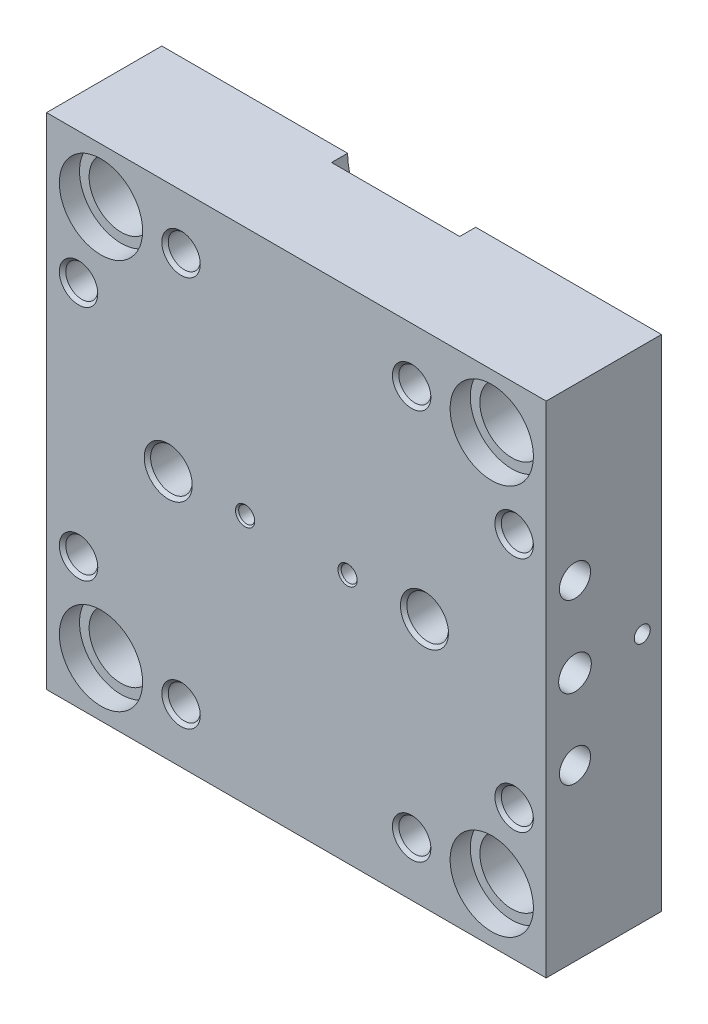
ISO-10303-21;
HEADER;
FILE_DESCRIPTION(('STEP AP214'),'2;1');
FILE_NAME('part.step','',(''),(''),'','','');
FILE_SCHEMA(('AUTOMOTIVE_DESIGN { 1 0 10303 214 1 1 1 1 }'));
ENDSEC;
DATA;
#1=APPLICATION_CONTEXT('core data for automotive mechanical design processes');
#2=APPLICATION_PROTOCOL_DEFINITION('international standard','automotive_design',2000,#1);
#3=PRODUCT_CONTEXT('',#1,'mechanical');
#4=PRODUCT('Part','Part','',(#3));
#5=PRODUCT_RELATED_PRODUCT_CATEGORY('part','',(#4));
#6=PRODUCT_DEFINITION_FORMATION('','',#4);
#7=PRODUCT_DEFINITION_CONTEXT('part definition',#1,'design');
#8=PRODUCT_DEFINITION('design','',#6,#7);
#9=PRODUCT_DEFINITION_SHAPE('','',#8);
#10=(LENGTH_UNIT() NAMED_UNIT(*) SI_UNIT(.MILLI.,.METRE.));
#11=(NAMED_UNIT(*) PLANE_ANGLE_UNIT() SI_UNIT($,.RADIAN.));
#12=(NAMED_UNIT(*) SI_UNIT($,.STERADIAN.) SOLID_ANGLE_UNIT());
#13=UNCERTAINTY_MEASURE_WITH_UNIT(LENGTH_MEASURE(1.E-05),#10,'distance_accuracy_value','');
#14=(GEOMETRIC_REPRESENTATION_CONTEXT(3) GLOBAL_UNCERTAINTY_ASSIGNED_CONTEXT((#13)) GLOBAL_UNIT_ASSIGNED_CONTEXT((#10,
#11,#12)) REPRESENTATION_CONTEXT('',''));
#15=CARTESIAN_POINT('',(0.,0.,0.));
#16=DIRECTION('',(0.,0.,1.));
#17=DIRECTION('',(1.,0.,0.));
#18=AXIS2_PLACEMENT_3D('',#15,#16,#17);
#19=CARTESIAN_POINT('',(-16.,0.,36.));
#20=DIRECTION('',(0.,0.,-1.));
#21=DIRECTION('',(-1.,0.,0.));
#22=AXIS2_PLACEMENT_3D('',#19,#20,#21);
#23=CYLINDRICAL_SURFACE('',#22,2.);
#24=CARTESIAN_POINT('',(-16.,0.,6.5));
#25=DIRECTION('',(0.,0.,1.));
#26=DIRECTION('',(1.,0.,0.));
#27=AXIS2_PLACEMENT_3D('',#24,#25,#26);
#28=CIRCLE('',#27,2.);
#29=CARTESIAN_POINT('',(-14.,0.,6.5));
#30=VERTEX_POINT('',#29);
#31=EDGE_CURVE('E674',#30,#30,#28,.F.);
#32=ORIENTED_EDGE('',*,*,#31,.T.);
#33=EDGE_LOOP('',(#32));
#34=FACE_BOUND('',#33,.T.);
#35=CARTESIAN_POINT('',(-16.,0.,16.));
#36=DIRECTION('',(0.,0.,1.));
#37=DIRECTION('',(1.,0.,0.));
#38=AXIS2_PLACEMENT_3D('',#35,#36,#37);
#39=CIRCLE('',#38,2.);
#40=CARTESIAN_POINT('',(-14.,0.,16.));
#41=VERTEX_POINT('',#40);
#42=EDGE_CURVE('E45',#41,#41,#39,.F.);
#43=ORIENTED_EDGE('',*,*,#42,.F.);
#44=EDGE_LOOP('',(#43));
#45=FACE_BOUND('',#44,.T.);
#46=ADVANCED_FACE('F41',(#34,#45),#23,.F.);
#47=CARTESIAN_POINT('',(16.,0.,36.));
#48=DIRECTION('',(0.,0.,-1.));
#49=DIRECTION('',(-1.,0.,0.));
#50=AXIS2_PLACEMENT_3D('',#47,#48,#49);
#51=CYLINDRICAL_SURFACE('',#50,2.);
#52=CARTESIAN_POINT('',(16.,0.,6.5));
#53=DIRECTION('',(0.,0.,1.));
#54=DIRECTION('',(1.,0.,0.));
#55=AXIS2_PLACEMENT_3D('',#52,#53,#54);
#56=CIRCLE('',#55,2.);
#57=CARTESIAN_POINT('',(18.,0.,6.5));
#58=VERTEX_POINT('',#57);
#59=EDGE_CURVE('E179',#58,#58,#56,.F.);
#60=ORIENTED_EDGE('',*,*,#59,.T.);
#61=EDGE_LOOP('',(#60));
#62=FACE_BOUND('',#61,.T.);
#63=CARTESIAN_POINT('',(16.,0.,16.));
#64=DIRECTION('',(0.,0.,1.));
#65=DIRECTION('',(1.,0.,0.));
#66=AXIS2_PLACEMENT_3D('',#63,#64,#65);
#67=CIRCLE('',#66,2.);
#68=CARTESIAN_POINT('',(18.,0.,16.));
#69=VERTEX_POINT('',#68);
#70=EDGE_CURVE('E786',#69,#69,#67,.F.);
#71=ORIENTED_EDGE('',*,*,#70,.F.);
#72=EDGE_LOOP('',(#71));
#73=FACE_BOUND('',#72,.T.);
#74=ADVANCED_FACE('F627',(#62,#73),#51,.F.);
#75=CARTESIAN_POINT('',(40.,0.,36.));
#76=DIRECTION('',(0.,0.,-1.));
#77=DIRECTION('',(-1.,0.,0.));
#78=AXIS2_PLACEMENT_3D('',#75,#76,#77);
#79=CYLINDRICAL_SURFACE('',#78,6.5);
#80=CARTESIAN_POINT('',(40.,0.,35.));
#81=DIRECTION('',(0.,0.,1.));
#82=DIRECTION('',(1.,0.,0.));
#83=AXIS2_PLACEMENT_3D('',#80,#81,#82);
#84=CIRCLE('',#83,6.5);
#85=CARTESIAN_POINT('',(46.5,0.,35.));
#86=VERTEX_POINT('',#85);
#87=EDGE_CURVE('E11',#86,#86,#84,.T.);
#88=ORIENTED_EDGE('',*,*,#87,.T.);
#89=EDGE_LOOP('',(#88));
#90=FACE_BOUND('',#89,.T.);
#91=CARTESIAN_POINT('',(40.,0.,20.));
#92=DIRECTION('',(0.,0.,-1.));
#93=DIRECTION('',(-1.,0.,0.));
#94=AXIS2_PLACEMENT_3D('',#91,#92,#93);
#95=CIRCLE('',#94,6.5);
#96=CARTESIAN_POINT('',(33.5,0.,20.));
#97=VERTEX_POINT('',#96);
#98=EDGE_CURVE('E383',#97,#97,#95,.F.);
#99=ORIENTED_EDGE('',*,*,#98,.F.);
#100=EDGE_LOOP('',(#99));
#101=FACE_BOUND('',#100,.T.);
#102=ADVANCED_FACE('F633',(#90,#101),#79,.F.);
#103=CARTESIAN_POINT('',(-40.,0.,36.));
#104=DIRECTION('',(0.,0.,-1.));
#105=DIRECTION('',(-1.,0.,0.));
#106=AXIS2_PLACEMENT_3D('',#103,#104,#105);
#107=CYLINDRICAL_SURFACE('',#106,6.5);
#108=CARTESIAN_POINT('',(-40.,0.,35.));
#109=DIRECTION('',(0.,0.,1.));
#110=DIRECTION('',(1.,0.,0.));
#111=AXIS2_PLACEMENT_3D('',#108,#109,#110);
#112=CIRCLE('',#111,6.5);
#113=CARTESIAN_POINT('',(-33.5,0.,35.));
#114=VERTEX_POINT('',#113);
#115=EDGE_CURVE('E50',#114,#114,#112,.T.);
#116=ORIENTED_EDGE('',*,*,#115,.T.);
#117=EDGE_LOOP('',(#116));
#118=FACE_BOUND('',#117,.T.);
#119=CARTESIAN_POINT('',(-40.,0.,20.));
#120=DIRECTION('',(0.,0.,-1.));
#121=DIRECTION('',(-1.,0.,0.));
#122=AXIS2_PLACEMENT_3D('',#119,#120,#121);
#123=CIRCLE('',#122,6.5);
#124=CARTESIAN_POINT('',(-46.5,0.,20.));
#125=VERTEX_POINT('',#124);
#126=EDGE_CURVE('E378',#125,#125,#123,.F.);
#127=ORIENTED_EDGE('',*,*,#126,.F.);
#128=EDGE_LOOP('',(#127));
#129=FACE_BOUND('',#128,.T.);
#130=ADVANCED_FACE('F654',(#118,#129),#107,.F.);
#131=CARTESIAN_POINT('',(-78.,-78.,36.));
#132=DIRECTION('',(0.,0.,1.));
#133=DIRECTION('',(1.,0.,0.));
#134=AXIS2_PLACEMENT_3D('',#131,#132,#133);
#135=PLANE('',#134);
#136=CARTESIAN_POINT('',(68.,-37.,36.));
#137=DIRECTION('',(0.,0.,1.));
#138=DIRECTION('',(1.,0.,0.));
#139=AXIS2_PLACEMENT_3D('',#136,#137,#138);
#140=CIRCLE('',#139,6.00000000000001);
#141=CARTESIAN_POINT('',(74.,-37.,36.));
#142=VERTEX_POINT('',#141);
#143=EDGE_CURVE('E754',#142,#142,#140,.F.);
#144=ORIENTED_EDGE('',*,*,#143,.T.);
#145=EDGE_LOOP('',(#144));
#146=FACE_BOUND('',#145,.T.);
#147=CARTESIAN_POINT('',(-68.,-37.,36.));
#148=DIRECTION('',(0.,0.,1.));
#149=DIRECTION('',(1.,0.,0.));
#150=AXIS2_PLACEMENT_3D('',#147,#148,#149);
#151=CIRCLE('',#150,6.00000000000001);
#152=CARTESIAN_POINT('',(-62.,-37.,36.));
#153=VERTEX_POINT('',#152);
#154=EDGE_CURVE('E751',#153,#153,#151,.F.);
#155=ORIENTED_EDGE('',*,*,#154,.T.);
#156=EDGE_LOOP('',(#155));
#157=FACE_BOUND('',#156,.T.);
#158=CARTESIAN_POINT('',(-68.,37.,36.));
#159=DIRECTION('',(0.,0.,1.));
#160=DIRECTION('',(1.,0.,0.));
#161=AXIS2_PLACEMENT_3D('',#158,#159,#160);
#162=CIRCLE('',#161,6.00000000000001);
#163=CARTESIAN_POINT('',(-62.,37.,36.));
#164=VERTEX_POINT('',#163);
#165=EDGE_CURVE('E748',#164,#164,#162,.F.);
#166=ORIENTED_EDGE('',*,*,#165,.T.);
#167=EDGE_LOOP('',(#166));
#168=FACE_BOUND('',#167,.T.);
#169=CARTESIAN_POINT('',(68.,37.,36.));
#170=DIRECTION('',(0.,0.,1.));
#171=DIRECTION('',(1.,0.,0.));
#172=AXIS2_PLACEMENT_3D('',#169,#170,#171);
#173=CIRCLE('',#172,6.00000000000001);
#174=CARTESIAN_POINT('',(74.,37.,36.));
#175=VERTEX_POINT('',#174);
#176=EDGE_CURVE('E745',#175,#175,#173,.F.);
#177=ORIENTED_EDGE('',*,*,#176,.T.);
#178=EDGE_LOOP('',(#177));
#179=FACE_BOUND('',#178,.T.);
#180=CARTESIAN_POINT('',(-36.,-61.,36.));
#181=DIRECTION('',(0.,0.,1.));
#182=DIRECTION('',(1.,0.,0.));
#183=AXIS2_PLACEMENT_3D('',#180,#181,#182);
#184=CIRCLE('',#183,6.00000000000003);
#185=CARTESIAN_POINT('',(-30.,-61.,36.));
#186=VERTEX_POINT('',#185);
#187=EDGE_CURVE('E742',#186,#186,#184,.F.);
#188=ORIENTED_EDGE('',*,*,#187,.T.);
#189=EDGE_LOOP('',(#188));
#190=FACE_BOUND('',#189,.T.);
#191=CARTESIAN_POINT('',(36.,-61.,36.));
#192=DIRECTION('',(0.,0.,1.));
#193=DIRECTION('',(1.,0.,0.));
#194=AXIS2_PLACEMENT_3D('',#191,#192,#193);
#195=CIRCLE('',#194,6.00000000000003);
#196=CARTESIAN_POINT('',(42.,-61.,36.));
#197=VERTEX_POINT('',#196);
#198=EDGE_CURVE('E739',#197,#197,#195,.F.);
#199=ORIENTED_EDGE('',*,*,#198,.T.);
#200=EDGE_LOOP('',(#199));
#201=FACE_BOUND('',#200,.T.);
#202=CARTESIAN_POINT('',(-36.,61.,36.));
#203=DIRECTION('',(0.,0.,1.));
#204=DIRECTION('',(1.,0.,0.));
#205=AXIS2_PLACEMENT_3D('',#202,#203,#204);
#206=CIRCLE('',#205,6.00000000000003);
#207=CARTESIAN_POINT('',(-30.,61.,36.));
#208=VERTEX_POINT('',#207);
#209=EDGE_CURVE('E736',#208,#208,#206,.F.);
#210=ORIENTED_EDGE('',*,*,#209,.T.);
#211=EDGE_LOOP('',(#210));
#212=FACE_BOUND('',#211,.T.);
#213=CARTESIAN_POINT('',(36.,61.,36.));
#214=DIRECTION('',(0.,0.,1.));
#215=DIRECTION('',(1.,0.,0.));
#216=AXIS2_PLACEMENT_3D('',#213,#214,#215);
#217=CIRCLE('',#216,6.00000000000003);
#218=CARTESIAN_POINT('',(42.,61.,36.));
#219=VERTEX_POINT('',#218);
#220=EDGE_CURVE('E733',#219,#219,#217,.F.);
#221=ORIENTED_EDGE('',*,*,#220,.T.);
#222=EDGE_LOOP('',(#221));
#223=FACE_BOUND('',#222,.T.);
#224=CARTESIAN_POINT('',(-16.,0.,36.));
#225=DIRECTION('',(0.,0.,1.));
#226=DIRECTION('',(1.,0.,0.));
#227=AXIS2_PLACEMENT_3D('',#224,#225,#226);
#228=CIRCLE('',#227,2.99999999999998);
#229=CARTESIAN_POINT('',(-13.,0.,36.));
#230=VERTEX_POINT('',#229);
#231=EDGE_CURVE('E730',#230,#230,#228,.F.);
#232=ORIENTED_EDGE('',*,*,#231,.T.);
#233=EDGE_LOOP('',(#232));
#234=FACE_BOUND('',#233,.T.);
#235=CARTESIAN_POINT('',(16.,0.,36.));
#236=DIRECTION('',(0.,0.,1.));
#237=DIRECTION('',(1.,0.,0.));
#238=AXIS2_PLACEMENT_3D('',#235,#236,#237);
#239=CIRCLE('',#238,2.99999999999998);
#240=CARTESIAN_POINT('',(19.,0.,36.));
#241=VERTEX_POINT('',#240);
#242=EDGE_CURVE('E727',#241,#241,#239,.F.);
#243=ORIENTED_EDGE('',*,*,#242,.T.);
#244=EDGE_LOOP('',(#243));
#245=FACE_BOUND('',#244,.T.);
#246=CARTESIAN_POINT('',(-40.,0.,36.));
#247=DIRECTION('',(0.,0.,1.));
#248=DIRECTION('',(1.,0.,0.));
#249=AXIS2_PLACEMENT_3D('',#246,#247,#248);
#250=CIRCLE('',#249,7.50000000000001);
#251=CARTESIAN_POINT('',(-32.5,0.,36.));
#252=VERTEX_POINT('',#251);
#253=EDGE_CURVE('E724',#252,#252,#250,.F.);
#254=ORIENTED_EDGE('',*,*,#253,.T.);
#255=EDGE_LOOP('',(#254));
#256=FACE_BOUND('',#255,.T.);
#257=CARTESIAN_POINT('',(40.,0.,36.));
#258=DIRECTION('',(0.,0.,1.));
#259=DIRECTION('',(1.,0.,0.));
#260=AXIS2_PLACEMENT_3D('',#257,#258,#259);
#261=CIRCLE('',#260,7.50000000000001);
#262=CARTESIAN_POINT('',(47.5,0.,36.));
#263=VERTEX_POINT('',#262);
#264=EDGE_CURVE('E168',#263,#263,#261,.F.);
#265=ORIENTED_EDGE('',*,*,#264,.T.);
#266=EDGE_LOOP('',(#265));
#267=FACE_BOUND('',#266,.T.);
#268=DIRECTION('',(0.,-1.,0.));
#269=VECTOR('',#268,1.);
#270=CARTESIAN_POINT('',(-78.,78.,36.));
#271=LINE('',#270,#269);
#272=CARTESIAN_POINT('',(-78.,78.,36.));
#273=VERTEX_POINT('',#272);
#274=CARTESIAN_POINT('',(-78.,-78.,36.));
#275=VERTEX_POINT('',#274);
#276=EDGE_CURVE('E242',#273,#275,#271,.T.);
#277=ORIENTED_EDGE('',*,*,#276,.T.);
#278=DIRECTION('',(1.,0.,0.));
#279=VECTOR('',#278,1.);
#280=CARTESIAN_POINT('',(-78.,-78.,36.));
#281=LINE('',#280,#279);
#282=CARTESIAN_POINT('',(78.,-78.,36.));
#283=VERTEX_POINT('',#282);
#284=EDGE_CURVE('E256',#275,#283,#281,.T.);
#285=ORIENTED_EDGE('',*,*,#284,.T.);
#286=DIRECTION('',(0.,1.,0.));
#287=VECTOR('',#286,1.);
#288=CARTESIAN_POINT('',(78.,78.,36.));
#289=LINE('',#288,#287);
#290=CARTESIAN_POINT('',(78.,78.,36.));
#291=VERTEX_POINT('',#290);
#292=EDGE_CURVE('E254',#283,#291,#289,.T.);
#293=ORIENTED_EDGE('',*,*,#292,.T.);
#294=DIRECTION('',(-1.,0.,0.));
#295=VECTOR('',#294,1.);
#296=CARTESIAN_POINT('',(-78.,78.,36.));
#297=LINE('',#296,#295);
#298=EDGE_CURVE('E238',#291,#273,#297,.T.);
#299=ORIENTED_EDGE('',*,*,#298,.T.);
#300=EDGE_LOOP('',(#277,#285,#293,#299));
#301=FACE_BOUND('',#300,.T.);
#302=CARTESIAN_POINT('',(-61.,61.,36.));
#303=DIRECTION('',(0.,0.,1.));
#304=DIRECTION('',(1.,0.,0.));
#305=AXIS2_PLACEMENT_3D('',#302,#303,#304);
#306=CIRCLE('',#305,13.);
#307=CARTESIAN_POINT('',(-48.,61.,36.));
#308=VERTEX_POINT('',#307);
#309=EDGE_CURVE('E262',#308,#308,#306,.T.);
#310=ORIENTED_EDGE('',*,*,#309,.F.);
#311=EDGE_LOOP('',(#310));
#312=FACE_BOUND('',#311,.T.);
#313=CARTESIAN_POINT('',(61.,61.,36.));
#314=DIRECTION('',(0.,0.,-1.));
#315=DIRECTION('',(-1.,0.,0.));
#316=AXIS2_PLACEMENT_3D('',#313,#314,#315);
#317=CIRCLE('',#316,13.);
#318=CARTESIAN_POINT('',(48.,61.,36.));
#319=VERTEX_POINT('',#318);
#320=EDGE_CURVE('E278',#319,#319,#317,.T.);
#321=ORIENTED_EDGE('',*,*,#320,.T.);
#322=EDGE_LOOP('',(#321));
#323=FACE_BOUND('',#322,.T.);
#324=CARTESIAN_POINT('',(61.,-61.,36.));
#325=DIRECTION('',(0.,0.,1.));
#326=DIRECTION('',(-1.,0.,0.));
#327=AXIS2_PLACEMENT_3D('',#324,#325,#326);
#328=CIRCLE('',#327,13.);
#329=CARTESIAN_POINT('',(48.,-61.,36.));
#330=VERTEX_POINT('',#329);
#331=EDGE_CURVE('E294',#330,#330,#328,.T.);
#332=ORIENTED_EDGE('',*,*,#331,.F.);
#333=EDGE_LOOP('',(#332));
#334=FACE_BOUND('',#333,.T.);
#335=CARTESIAN_POINT('',(-61.,-61.,36.));
#336=DIRECTION('',(0.,0.,-1.));
#337=DIRECTION('',(1.,0.,0.));
#338=AXIS2_PLACEMENT_3D('',#335,#336,#337);
#339=CIRCLE('',#338,13.);
#340=CARTESIAN_POINT('',(-48.,-61.,36.));
#341=VERTEX_POINT('',#340);
#342=EDGE_CURVE('E310',#341,#341,#339,.T.);
#343=ORIENTED_EDGE('',*,*,#342,.T.);
#344=EDGE_LOOP('',(#343));
#345=FACE_BOUND('',#344,.T.);
#346=ADVANCED_FACE('F593',(#146,#157,#168,#179,#190,#201,#212,#223,#234,#245,#256,#267,#301,
#312,#323,#334,#345),#135,.T.);
#347=CARTESIAN_POINT('',(-61.,-61.,36.));
#348=DIRECTION('',(0.,0.,-1.));
#349=DIRECTION('',(-1.,0.,0.));
#350=AXIS2_PLACEMENT_3D('',#347,#348,#349);
#351=CYLINDRICAL_SURFACE('',#350,10.);
#352=CARTESIAN_POINT('',(-61.,-61.,0.));
#353=DIRECTION('',(0.,0.,-1.));
#354=DIRECTION('',(1.,0.,0.));
#355=AXIS2_PLACEMENT_3D('',#352,#353,#354);
#356=CIRCLE('',#355,10.);
#357=CARTESIAN_POINT('',(-51.,-61.,0.));
#358=VERTEX_POINT('',#357);
#359=EDGE_CURVE('E210',#358,#358,#356,.T.);
#360=ORIENTED_EDGE('',*,*,#359,.T.);
#361=EDGE_LOOP('',(#360));
#362=FACE_BOUND('',#361,.T.);
#363=CARTESIAN_POINT('',(-61.,-61.,29.7));
#364=DIRECTION('',(0.,0.,1.));
#365=DIRECTION('',(1.,0.,0.));
#366=AXIS2_PLACEMENT_3D('',#363,#364,#365);
#367=CIRCLE('',#366,10.);
#368=CARTESIAN_POINT('',(-51.,-61.,29.7));
#369=VERTEX_POINT('',#368);
#370=EDGE_CURVE('E207',#369,#369,#367,.F.);
#371=ORIENTED_EDGE('',*,*,#370,.F.);
#372=EDGE_LOOP('',(#371));
#373=FACE_BOUND('',#372,.T.);
#374=ADVANCED_FACE('F826',(#362,#373),#351,.F.);
#375=CARTESIAN_POINT('',(61.,-61.,36.));
#376=DIRECTION('',(0.,0.,-1.));
#377=DIRECTION('',(-1.,0.,0.));
#378=AXIS2_PLACEMENT_3D('',#375,#376,#377);
#379=CYLINDRICAL_SURFACE('',#378,10.);
#380=CARTESIAN_POINT('',(61.,-61.,0.));
#381=DIRECTION('',(0.,0.,1.));
#382=DIRECTION('',(-1.,0.,0.));
#383=AXIS2_PLACEMENT_3D('',#380,#381,#382);
#384=CIRCLE('',#383,10.);
#385=CARTESIAN_POINT('',(51.,-61.,0.));
#386=VERTEX_POINT('',#385);
#387=EDGE_CURVE('E215',#386,#386,#384,.T.);
#388=ORIENTED_EDGE('',*,*,#387,.F.);
#389=EDGE_LOOP('',(#388));
#390=FACE_BOUND('',#389,.T.);
#391=CARTESIAN_POINT('',(61.,-61.,29.7));
#392=DIRECTION('',(0.,0.,1.));
#393=DIRECTION('',(1.,0.,0.));
#394=AXIS2_PLACEMENT_3D('',#391,#392,#393);
#395=CIRCLE('',#394,10.);
#396=CARTESIAN_POINT('',(71.,-61.,29.7));
#397=VERTEX_POINT('',#396);
#398=EDGE_CURVE('E212',#397,#397,#395,.T.);
#399=ORIENTED_EDGE('',*,*,#398,.T.);
#400=EDGE_LOOP('',(#399));
#401=FACE_BOUND('',#400,.T.);
#402=ADVANCED_FACE('F965',(#390,#401),#379,.F.);
#403=CARTESIAN_POINT('',(-78.,-78.,0.));
#404=DIRECTION('',(0.,0.,1.));
#405=DIRECTION('',(1.,0.,0.));
#406=AXIS2_PLACEMENT_3D('',#403,#404,#405);
#407=PLANE('',#406);
#408=CARTESIAN_POINT('',(40.,0.,0.));
#409=DIRECTION('',(0.,0.,-1.));
#410=DIRECTION('',(-1.,0.,0.));
#411=AXIS2_PLACEMENT_3D('',#408,#409,#410);
#412=CIRCLE('',#411,16.);
#413=CARTESIAN_POINT('',(24.,0.,0.));
#414=VERTEX_POINT('',#413);
#415=EDGE_CURVE('E386',#414,#414,#412,.T.);
#416=ORIENTED_EDGE('',*,*,#415,.F.);
#417=EDGE_LOOP('',(#416));
#418=FACE_BOUND('',#417,.T.);
#419=CARTESIAN_POINT('',(-40.,0.,0.));
#420=DIRECTION('',(0.,0.,-1.));
#421=DIRECTION('',(-1.,0.,0.));
#422=AXIS2_PLACEMENT_3D('',#419,#420,#421);
#423=CIRCLE('',#422,16.);
#424=CARTESIAN_POINT('',(-56.,0.,0.));
#425=VERTEX_POINT('',#424);
#426=EDGE_CURVE('E379',#425,#425,#423,.T.);
#427=ORIENTED_EDGE('',*,*,#426,.F.);
#428=EDGE_LOOP('',(#427));
#429=FACE_BOUND('',#428,.T.);
#430=CARTESIAN_POINT('',(68.,-37.,0.));
#431=DIRECTION('',(0.,0.,-1.));
#432=DIRECTION('',(-1.,0.,0.));
#433=AXIS2_PLACEMENT_3D('',#430,#431,#432);
#434=CIRCLE('',#433,4.99999999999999);
#435=CARTESIAN_POINT('',(63.,-37.,0.));
#436=VERTEX_POINT('',#435);
#437=EDGE_CURVE('E375',#436,#436,#434,.T.);
#438=ORIENTED_EDGE('',*,*,#437,.F.);
#439=EDGE_LOOP('',(#438));
#440=FACE_BOUND('',#439,.T.);
#441=CARTESIAN_POINT('',(-68.,-37.,0.));
#442=DIRECTION('',(0.,0.,-1.));
#443=DIRECTION('',(-1.,0.,0.));
#444=AXIS2_PLACEMENT_3D('',#441,#442,#443);
#445=CIRCLE('',#444,4.99999999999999);
#446=CARTESIAN_POINT('',(-73.,-37.,0.));
#447=VERTEX_POINT('',#446);
#448=EDGE_CURVE('E372',#447,#447,#445,.T.);
#449=ORIENTED_EDGE('',*,*,#448,.F.);
#450=EDGE_LOOP('',(#449));
#451=FACE_BOUND('',#450,.T.);
#452=CARTESIAN_POINT('',(-68.,37.,0.));
#453=DIRECTION('',(0.,0.,-1.));
#454=DIRECTION('',(-1.,0.,0.));
#455=AXIS2_PLACEMENT_3D('',#452,#453,#454);
#456=CIRCLE('',#455,4.99999999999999);
#457=CARTESIAN_POINT('',(-73.,37.,0.));
#458=VERTEX_POINT('',#457);
#459=EDGE_CURVE('E369',#458,#458,#456,.T.);
#460=ORIENTED_EDGE('',*,*,#459,.F.);
#461=EDGE_LOOP('',(#460));
#462=FACE_BOUND('',#461,.T.);
#463=CARTESIAN_POINT('',(68.,37.,0.));
#464=DIRECTION('',(0.,0.,-1.));
#465=DIRECTION('',(-1.,0.,0.));
#466=AXIS2_PLACEMENT_3D('',#463,#464,#465);
#467=CIRCLE('',#466,4.99999999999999);
#468=CARTESIAN_POINT('',(63.,37.,0.));
#469=VERTEX_POINT('',#468);
#470=EDGE_CURVE('E363',#469,#469,#467,.T.);
#471=ORIENTED_EDGE('',*,*,#470,.F.);
#472=EDGE_LOOP('',(#471));
#473=FACE_BOUND('',#472,.T.);
#474=DIRECTION('',(-1.,0.,0.));
#475=VECTOR('',#474,1.);
#476=CARTESIAN_POINT('',(20.,-2.5,0.));
#477=LINE('',#476,#475);
#478=CARTESIAN_POINT('',(20.,-2.5,0.));
#479=VERTEX_POINT('',#478);
#480=CARTESIAN_POINT('',(-20.,-2.5,0.));
#481=VERTEX_POINT('',#480);
#482=EDGE_CURVE('E338',#479,#481,#477,.T.);
#483=ORIENTED_EDGE('',*,*,#482,.F.);
#484=CARTESIAN_POINT('',(20.,0.,0.));
#485=DIRECTION('',(0.,0.,-1.));
#486=DIRECTION('',(-1.,0.,0.));
#487=AXIS2_PLACEMENT_3D('',#484,#485,#486);
#488=CIRCLE('',#487,2.5);
#489=CARTESIAN_POINT('',(20.,2.5,0.));
#490=VERTEX_POINT('',#489);
#491=EDGE_CURVE('E341',#490,#479,#488,.T.);
#492=ORIENTED_EDGE('',*,*,#491,.F.);
#493=DIRECTION('',(1.,0.,0.));
#494=VECTOR('',#493,1.);
#495=CARTESIAN_POINT('',(20.,2.5,0.));
#496=LINE('',#495,#494);
#497=CARTESIAN_POINT('',(-20.,2.5,0.));
#498=VERTEX_POINT('',#497);
#499=EDGE_CURVE('E328',#498,#490,#496,.T.);
#500=ORIENTED_EDGE('',*,*,#499,.F.);
#501=CARTESIAN_POINT('',(-20.,0.,0.));
#502=DIRECTION('',(0.,0.,-1.));
#503=DIRECTION('',(1.,0.,0.));
#504=AXIS2_PLACEMENT_3D('',#501,#502,#503);
#505=CIRCLE('',#504,2.5);
#506=EDGE_CURVE('E335',#481,#498,#505,.T.);
#507=ORIENTED_EDGE('',*,*,#506,.F.);
#508=EDGE_LOOP('',(#483,#492,#500,#507));
#509=FACE_BOUND('',#508,.T.);
#510=ORIENTED_EDGE('',*,*,#359,.F.);
#511=EDGE_LOOP('',(#510));
#512=FACE_BOUND('',#511,.T.);
#513=CARTESIAN_POINT('',(-61.,61.,0.));
#514=DIRECTION('',(0.,0.,1.));
#515=DIRECTION('',(1.,0.,0.));
#516=AXIS2_PLACEMENT_3D('',#513,#514,#515);
#517=CIRCLE('',#516,10.);
#518=CARTESIAN_POINT('',(-51.,61.,0.));
#519=VERTEX_POINT('',#518);
#520=EDGE_CURVE('E225',#519,#519,#517,.T.);
#521=ORIENTED_EDGE('',*,*,#520,.T.);
#522=EDGE_LOOP('',(#521));
#523=FACE_BOUND('',#522,.T.);
#524=DIRECTION('',(1.,0.,0.));
#525=VECTOR('',#524,1.);
#526=CARTESIAN_POINT('',(-78.,-78.,0.));
#527=LINE('',#526,#525);
#528=CARTESIAN_POINT('',(20.,-78.,0.));
#529=VERTEX_POINT('',#528);
#530=CARTESIAN_POINT('',(78.,-78.,0.));
#531=VERTEX_POINT('',#530);
#532=EDGE_CURVE('E249',#529,#531,#527,.T.);
#533=ORIENTED_EDGE('',*,*,#532,.F.);
#534=CARTESIAN_POINT('',(0.,-78.,0.));
#535=DIRECTION('',(0.,0.,-1.));
#536=DIRECTION('',(-1.,0.,0.));
#537=AXIS2_PLACEMENT_3D('',#534,#535,#536);
#538=CIRCLE('',#537,20.);
#539=CARTESIAN_POINT('',(-20.,-78.,0.));
#540=VERTEX_POINT('',#539);
#541=EDGE_CURVE('E360',#540,#529,#538,.T.);
#542=ORIENTED_EDGE('',*,*,#541,.F.);
#543=CARTESIAN_POINT('',(-78.,-78.,0.));
#544=VERTEX_POINT('',#543);
#545=EDGE_CURVE('E246',#544,#540,#527,.T.);
#546=ORIENTED_EDGE('',*,*,#545,.F.);
#547=DIRECTION('',(0.,-1.,0.));
#548=VECTOR('',#547,1.);
#549=CARTESIAN_POINT('',(-78.,78.,0.));
#550=LINE('',#549,#548);
#551=CARTESIAN_POINT('',(-78.,78.,0.));
#552=VERTEX_POINT('',#551);
#553=EDGE_CURVE('E250',#552,#544,#550,.T.);
#554=ORIENTED_EDGE('',*,*,#553,.F.);
#555=DIRECTION('',(-1.,0.,0.));
#556=VECTOR('',#555,1.);
#557=CARTESIAN_POINT('',(-78.,78.,0.));
#558=LINE('',#557,#556);
#559=CARTESIAN_POINT('',(-20.,78.,0.));
#560=VERTEX_POINT('',#559);
#561=EDGE_CURVE('E243',#560,#552,#558,.T.);
#562=ORIENTED_EDGE('',*,*,#561,.F.);
#563=CARTESIAN_POINT('',(0.,78.,0.));
#564=DIRECTION('',(0.,0.,-1.));
#565=DIRECTION('',(-1.,0.,0.));
#566=AXIS2_PLACEMENT_3D('',#563,#564,#565);
#567=CIRCLE('',#566,20.);
#568=CARTESIAN_POINT('',(20.,78.,0.));
#569=VERTEX_POINT('',#568);
#570=EDGE_CURVE('E348',#569,#560,#567,.T.);
#571=ORIENTED_EDGE('',*,*,#570,.F.);
#572=CARTESIAN_POINT('',(78.,78.,0.));
#573=VERTEX_POINT('',#572);
#574=EDGE_CURVE('E239',#573,#569,#558,.T.);
#575=ORIENTED_EDGE('',*,*,#574,.F.);
#576=DIRECTION('',(0.,1.,0.));
#577=VECTOR('',#576,1.);
#578=CARTESIAN_POINT('',(78.,78.,0.));
#579=LINE('',#578,#577);
#580=EDGE_CURVE('E244',#531,#573,#579,.T.);
#581=ORIENTED_EDGE('',*,*,#580,.F.);
#582=EDGE_LOOP('',(#533,#542,#546,#554,#562,#571,#575,#581));
#583=FACE_BOUND('',#582,.T.);
#584=CARTESIAN_POINT('',(61.,61.,0.));
#585=DIRECTION('',(0.,0.,-1.));
#586=DIRECTION('',(-1.,0.,0.));
#587=AXIS2_PLACEMENT_3D('',#584,#585,#586);
#588=CIRCLE('',#587,10.);
#589=CARTESIAN_POINT('',(51.,61.,0.));
#590=VERTEX_POINT('',#589);
#591=EDGE_CURVE('E220',#590,#590,#588,.T.);
#592=ORIENTED_EDGE('',*,*,#591,.F.);
#593=EDGE_LOOP('',(#592));
#594=FACE_BOUND('',#593,.T.);
#595=ORIENTED_EDGE('',*,*,#387,.T.);
#596=EDGE_LOOP('',(#595));
#597=FACE_BOUND('',#596,.T.);
#598=ADVANCED_FACE('F583',(#418,#429,#440,#451,#462,#473,#509,#512,#523,#583,#594,#597),#407,.F.);
#599=CARTESIAN_POINT('',(61.,61.,36.));
#600=DIRECTION('',(0.,0.,-1.));
#601=DIRECTION('',(-1.,0.,0.));
#602=AXIS2_PLACEMENT_3D('',#599,#600,#601);
#603=CYLINDRICAL_SURFACE('',#602,10.);
#604=ORIENTED_EDGE('',*,*,#591,.T.);
#605=EDGE_LOOP('',(#604));
#606=FACE_BOUND('',#605,.T.);
#607=CARTESIAN_POINT('',(61.,61.,29.7));
#608=DIRECTION('',(0.,0.,1.));
#609=DIRECTION('',(1.,0.,0.));
#610=AXIS2_PLACEMENT_3D('',#607,#608,#609);
#611=CIRCLE('',#610,10.);
#612=CARTESIAN_POINT('',(71.,61.,29.7));
#613=VERTEX_POINT('',#612);
#614=EDGE_CURVE('E217',#613,#613,#611,.F.);
#615=ORIENTED_EDGE('',*,*,#614,.F.);
#616=EDGE_LOOP('',(#615));
#617=FACE_BOUND('',#616,.T.);
#618=ADVANCED_FACE('F933',(#606,#617),#603,.F.);
#619=CARTESIAN_POINT('',(-61.,61.,36.));
#620=DIRECTION('',(0.,0.,-1.));
#621=DIRECTION('',(-1.,0.,0.));
#622=AXIS2_PLACEMENT_3D('',#619,#620,#621);
#623=CYLINDRICAL_SURFACE('',#622,10.);
#624=ORIENTED_EDGE('',*,*,#520,.F.);
#625=EDGE_LOOP('',(#624));
#626=FACE_BOUND('',#625,.T.);
#627=CARTESIAN_POINT('',(-61.,61.,29.7));
#628=DIRECTION('',(0.,0.,1.));
#629=DIRECTION('',(1.,0.,0.));
#630=AXIS2_PLACEMENT_3D('',#627,#628,#629);
#631=CIRCLE('',#630,10.);
#632=CARTESIAN_POINT('',(-51.,61.,29.7));
#633=VERTEX_POINT('',#632);
#634=EDGE_CURVE('E222',#633,#633,#631,.T.);
#635=ORIENTED_EDGE('',*,*,#634,.T.);
#636=EDGE_LOOP('',(#635));
#637=FACE_BOUND('',#636,.T.);
#638=ADVANCED_FACE('F573',(#626,#637),#623,.F.);
#639=CARTESIAN_POINT('',(-78.,78.,36.));
#640=DIRECTION('',(1.,0.,0.));
#641=DIRECTION('',(0.,1.,0.));
#642=AXIS2_PLACEMENT_3D('',#639,#640,#641);
#643=PLANE('',#642);
#644=CARTESIAN_POINT('',(-78.,25.,27.));
#645=DIRECTION('',(-1.,0.,0.));
#646=DIRECTION('',(0.,0.,1.));
#647=AXIS2_PLACEMENT_3D('',#644,#645,#646);
#648=CIRCLE('',#647,4.864);
#649=CARTESIAN_POINT('',(-78.,25.,31.864));
#650=VERTEX_POINT('',#649);
#651=EDGE_CURVE('E535',#650,#650,#648,.T.);
#652=ORIENTED_EDGE('',*,*,#651,.F.);
#653=EDGE_LOOP('',(#652));
#654=FACE_BOUND('',#653,.T.);
#655=CARTESIAN_POINT('',(-78.,-25.,27.));
#656=DIRECTION('',(-1.,0.,0.));
#657=DIRECTION('',(0.,0.,1.));
#658=AXIS2_PLACEMENT_3D('',#655,#656,#657);
#659=CIRCLE('',#658,4.864);
#660=CARTESIAN_POINT('',(-78.,-25.,31.864));
#661=VERTEX_POINT('',#660);
#662=EDGE_CURVE('E547',#661,#661,#659,.T.);
#663=ORIENTED_EDGE('',*,*,#662,.F.);
#664=EDGE_LOOP('',(#663));
#665=FACE_BOUND('',#664,.T.);
#666=CARTESIAN_POINT('',(-78.,0.,6.));
#667=DIRECTION('',(-1.,0.,0.));
#668=DIRECTION('',(0.,0.,1.));
#669=AXIS2_PLACEMENT_3D('',#666,#667,#668);
#670=CIRCLE('',#669,2.49999999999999);
#671=CARTESIAN_POINT('',(-78.,0.,8.49999999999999));
#672=VERTEX_POINT('',#671);
#673=EDGE_CURVE('E399',#672,#672,#670,.T.);
#674=ORIENTED_EDGE('',*,*,#673,.F.);
#675=EDGE_LOOP('',(#674));
#676=FACE_BOUND('',#675,.T.);
#677=ORIENTED_EDGE('',*,*,#553,.T.);
#678=DIRECTION('',(0.,0.,-1.));
#679=VECTOR('',#678,1.);
#680=CARTESIAN_POINT('',(-78.,-78.,36.));
#681=LINE('',#680,#679);
#682=EDGE_CURVE('E206',#275,#544,#681,.T.);
#683=ORIENTED_EDGE('',*,*,#682,.F.);
#684=ORIENTED_EDGE('',*,*,#276,.F.);
#685=DIRECTION('',(0.,0.,-1.));
#686=VECTOR('',#685,1.);
#687=CARTESIAN_POINT('',(-78.,78.,36.));
#688=LINE('',#687,#686);
#689=EDGE_CURVE('E235',#273,#552,#688,.T.);
#690=ORIENTED_EDGE('',*,*,#689,.T.);
#691=EDGE_LOOP('',(#677,#683,#684,#690));
#692=FACE_BOUND('',#691,.T.);
#693=ADVANCED_FACE('F569',(#654,#665,#676,#692),#643,.F.);
#694=CARTESIAN_POINT('',(-78.,-78.,36.));
#695=DIRECTION('',(0.,1.,0.));
#696=DIRECTION('',(0.,0.,1.));
#697=AXIS2_PLACEMENT_3D('',#694,#695,#696);
#698=PLANE('',#697);
#699=DIRECTION('',(-1.,0.,0.));
#700=VECTOR('',#699,1.);
#701=CARTESIAN_POINT('',(20.,-78.,5.));
#702=LINE('',#701,#700);
#703=CARTESIAN_POINT('',(20.,-78.,5.));
#704=VERTEX_POINT('',#703);
#705=CARTESIAN_POINT('',(-20.,-78.,5.));
#706=VERTEX_POINT('',#705);
#707=EDGE_CURVE('E358',#704,#706,#702,.T.);
#708=ORIENTED_EDGE('',*,*,#707,.F.);
#709=DIRECTION('',(0.,0.,-1.));
#710=VECTOR('',#709,1.);
#711=CARTESIAN_POINT('',(20.,-78.,5.));
#712=LINE('',#711,#710);
#713=EDGE_CURVE('E355',#704,#529,#712,.T.);
#714=ORIENTED_EDGE('',*,*,#713,.T.);
#715=ORIENTED_EDGE('',*,*,#532,.T.);
#716=DIRECTION('',(0.,0.,-1.));
#717=VECTOR('',#716,1.);
#718=CARTESIAN_POINT('',(78.,-78.,36.));
#719=LINE('',#718,#717);
#720=EDGE_CURVE('E229',#283,#531,#719,.T.);
#721=ORIENTED_EDGE('',*,*,#720,.F.);
#722=ORIENTED_EDGE('',*,*,#284,.F.);
#723=ORIENTED_EDGE('',*,*,#682,.T.);
#724=ORIENTED_EDGE('',*,*,#545,.T.);
#725=DIRECTION('',(0.,0.,-1.));
#726=VECTOR('',#725,1.);
#727=CARTESIAN_POINT('',(-20.,-78.,5.));
#728=LINE('',#727,#726);
#729=EDGE_CURVE('E351',#706,#540,#728,.T.);
#730=ORIENTED_EDGE('',*,*,#729,.F.);
#731=EDGE_LOOP('',(#708,#714,#715,#721,#722,#723,#724,#730));
#732=FACE_BOUND('',#731,.T.);
#733=ADVANCED_FACE('F572',(#732),#698,.F.);
#734=CARTESIAN_POINT('',(78.,78.,36.));
#735=DIRECTION('',(-1.,0.,0.));
#736=DIRECTION('',(0.,0.,1.));
#737=AXIS2_PLACEMENT_3D('',#734,#735,#736);
#738=PLANE('',#737);
#739=CARTESIAN_POINT('',(78.,0.,6.));
#740=DIRECTION('',(1.,0.,0.));
#741=DIRECTION('',(0.,0.,-1.));
#742=AXIS2_PLACEMENT_3D('',#739,#740,#741);
#743=CIRCLE('',#742,2.49999999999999);
#744=CARTESIAN_POINT('',(78.,0.,3.50000000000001));
#745=VERTEX_POINT('',#744);
#746=EDGE_CURVE('E502',#745,#745,#743,.T.);
#747=ORIENTED_EDGE('',*,*,#746,.F.);
#748=EDGE_LOOP('',(#747));
#749=FACE_BOUND('',#748,.T.);
#750=CARTESIAN_POINT('',(78.,25.,27.));
#751=DIRECTION('',(1.,0.,0.));
#752=DIRECTION('',(0.,0.,-1.));
#753=AXIS2_PLACEMENT_3D('',#750,#751,#752);
#754=CIRCLE('',#753,4.864);
#755=CARTESIAN_POINT('',(78.,25.,22.136));
#756=VERTEX_POINT('',#755);
#757=EDGE_CURVE('E511',#756,#756,#754,.T.);
#758=ORIENTED_EDGE('',*,*,#757,.F.);
#759=EDGE_LOOP('',(#758));
#760=FACE_BOUND('',#759,.T.);
#761=CARTESIAN_POINT('',(78.,-25.,27.));
#762=DIRECTION('',(1.,0.,0.));
#763=DIRECTION('',(0.,0.,-1.));
#764=AXIS2_PLACEMENT_3D('',#761,#762,#763);
#765=CIRCLE('',#764,4.864);
#766=CARTESIAN_POINT('',(78.,-25.,22.136));
#767=VERTEX_POINT('',#766);
#768=EDGE_CURVE('E523',#767,#767,#765,.T.);
#769=ORIENTED_EDGE('',*,*,#768,.F.);
#770=EDGE_LOOP('',(#769));
#771=FACE_BOUND('',#770,.T.);
#772=CARTESIAN_POINT('',(78.,0.,27.));
#773=DIRECTION('',(1.,0.,0.));
#774=DIRECTION('',(0.,0.,-1.));
#775=AXIS2_PLACEMENT_3D('',#772,#773,#774);
#776=CIRCLE('',#775,5.09999999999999);
#777=CARTESIAN_POINT('',(78.,0.,21.9));
#778=VERTEX_POINT('',#777);
#779=EDGE_CURVE('E561',#778,#778,#776,.T.);
#780=ORIENTED_EDGE('',*,*,#779,.F.);
#781=EDGE_LOOP('',(#780));
#782=FACE_BOUND('',#781,.T.);
#783=ORIENTED_EDGE('',*,*,#580,.T.);
#784=DIRECTION('',(0.,0.,-1.));
#785=VECTOR('',#784,1.);
#786=CARTESIAN_POINT('',(78.,78.,36.));
#787=LINE('',#786,#785);
#788=EDGE_CURVE('E232',#291,#573,#787,.T.);
#789=ORIENTED_EDGE('',*,*,#788,.F.);
#790=ORIENTED_EDGE('',*,*,#292,.F.);
#791=ORIENTED_EDGE('',*,*,#720,.T.);
#792=EDGE_LOOP('',(#783,#789,#790,#791));
#793=FACE_BOUND('',#792,.T.);
#794=ADVANCED_FACE('F607',(#749,#760,#771,#782,#793),#738,.F.);
#795=CARTESIAN_POINT('',(-78.,78.,36.));
#796=DIRECTION('',(0.,-1.,0.));
#797=DIRECTION('',(0.,0.,-1.));
#798=AXIS2_PLACEMENT_3D('',#795,#796,#797);
#799=PLANE('',#798);
#800=DIRECTION('',(1.,0.,0.));
#801=VECTOR('',#800,1.);
#802=CARTESIAN_POINT('',(20.,78.,5.));
#803=LINE('',#802,#801);
#804=CARTESIAN_POINT('',(-20.,78.,5.));
#805=VERTEX_POINT('',#804);
#806=CARTESIAN_POINT('',(20.,78.,5.));
#807=VERTEX_POINT('',#806);
#808=EDGE_CURVE('E346',#805,#807,#803,.T.);
#809=ORIENTED_EDGE('',*,*,#808,.F.);
#810=DIRECTION('',(0.,0.,-1.));
#811=VECTOR('',#810,1.);
#812=CARTESIAN_POINT('',(-20.,78.,5.));
#813=LINE('',#812,#811);
#814=EDGE_CURVE('E194',#805,#560,#813,.T.);
#815=ORIENTED_EDGE('',*,*,#814,.T.);
#816=ORIENTED_EDGE('',*,*,#561,.T.);
#817=ORIENTED_EDGE('',*,*,#689,.F.);
#818=ORIENTED_EDGE('',*,*,#298,.F.);
#819=ORIENTED_EDGE('',*,*,#788,.T.);
#820=ORIENTED_EDGE('',*,*,#574,.T.);
#821=DIRECTION('',(0.,0.,-1.));
#822=VECTOR('',#821,1.);
#823=CARTESIAN_POINT('',(20.,78.,5.));
#824=LINE('',#823,#822);
#825=EDGE_CURVE('E193',#807,#569,#824,.T.);
#826=ORIENTED_EDGE('',*,*,#825,.F.);
#827=EDGE_LOOP('',(#809,#815,#816,#817,#818,#819,#820,#826));
#828=FACE_BOUND('',#827,.T.);
#829=ADVANCED_FACE('F599',(#828),#799,.F.);
#830=CARTESIAN_POINT('',(-61.,61.,29.7));
#831=DIRECTION('',(0.,0.,1.));
#832=DIRECTION('',(1.,0.,0.));
#833=AXIS2_PLACEMENT_3D('',#830,#831,#832);
#834=CYLINDRICAL_SURFACE('',#833,13.);
#835=CARTESIAN_POINT('',(-61.,61.,29.7));
#836=DIRECTION('',(0.,0.,1.));
#837=DIRECTION('',(1.,0.,0.));
#838=AXIS2_PLACEMENT_3D('',#835,#836,#837);
#839=CIRCLE('',#838,13.);
#840=CARTESIAN_POINT('',(-48.,61.,29.7));
#841=VERTEX_POINT('',#840);
#842=EDGE_CURVE('E226',#841,#841,#839,.T.);
#843=ORIENTED_EDGE('',*,*,#842,.F.);
#844=EDGE_LOOP('',(#843));
#845=FACE_BOUND('',#844,.T.);
#846=ORIENTED_EDGE('',*,*,#309,.T.);
#847=EDGE_LOOP('',(#846));
#848=FACE_BOUND('',#847,.T.);
#849=ADVANCED_FACE('F955',(#845,#848),#834,.F.);
#850=CARTESIAN_POINT('',(-61.,61.,29.7));
#851=DIRECTION('',(0.,0.,1.));
#852=DIRECTION('',(1.,0.,0.));
#853=AXIS2_PLACEMENT_3D('',#850,#851,#852);
#854=PLANE('',#853);
#855=ORIENTED_EDGE('',*,*,#634,.F.);
#856=EDGE_LOOP('',(#855));
#857=FACE_BOUND('',#856,.T.);
#858=ORIENTED_EDGE('',*,*,#842,.T.);
#859=EDGE_LOOP('',(#858));
#860=FACE_BOUND('',#859,.T.);
#861=ADVANCED_FACE('F951',(#857,#860),#854,.T.);
#862=CARTESIAN_POINT('',(-36.,61.,36.));
#863=DIRECTION('',(0.,0.,1.));
#864=DIRECTION('',(1.,0.,0.));
#865=AXIS2_PLACEMENT_3D('',#862,#863,#864);
#866=CYLINDRICAL_SURFACE('',#865,5.);
#867=CARTESIAN_POINT('',(-36.,61.,35.));
#868=DIRECTION('',(0.,0.,1.));
#869=DIRECTION('',(1.,0.,0.));
#870=AXIS2_PLACEMENT_3D('',#867,#868,#869);
#871=CIRCLE('',#870,5.);
#872=CARTESIAN_POINT('',(-31.,61.,35.));
#873=VERTEX_POINT('',#872);
#874=EDGE_CURVE('E775',#873,#873,#871,.T.);
#875=ORIENTED_EDGE('',*,*,#874,.T.);
#876=EDGE_LOOP('',(#875));
#877=FACE_BOUND('',#876,.T.);
#878=CARTESIAN_POINT('',(-36.,61.,21.));
#879=DIRECTION('',(0.,0.,1.));
#880=DIRECTION('',(1.,0.,0.));
#881=AXIS2_PLACEMENT_3D('',#878,#879,#880);
#882=CIRCLE('',#881,5.);
#883=CARTESIAN_POINT('',(-31.,61.,21.));
#884=VERTEX_POINT('',#883);
#885=EDGE_CURVE('E265',#884,#884,#882,.T.);
#886=ORIENTED_EDGE('',*,*,#885,.F.);
#887=EDGE_LOOP('',(#886));
#888=FACE_BOUND('',#887,.T.);
#889=ADVANCED_FACE('F947',(#877,#888),#866,.F.);
#890=CARTESIAN_POINT('',(-31.75,61.,21.));
#891=DIRECTION('',(0.,0.,-1.));
#892=DIRECTION('',(-1.,0.,0.));
#893=AXIS2_PLACEMENT_3D('',#890,#891,#892);
#894=PLANE('',#893);
#895=CARTESIAN_POINT('',(-36.,61.,21.));
#896=DIRECTION('',(0.,0.,1.));
#897=DIRECTION('',(1.,0.,0.));
#898=AXIS2_PLACEMENT_3D('',#895,#896,#897);
#899=CIRCLE('',#898,4.25);
#900=CARTESIAN_POINT('',(-31.75,61.,21.));
#901=VERTEX_POINT('',#900);
#902=EDGE_CURVE('E270',#901,#901,#899,.T.);
#903=ORIENTED_EDGE('',*,*,#902,.F.);
#904=EDGE_LOOP('',(#903));
#905=FACE_BOUND('',#904,.T.);
#906=ORIENTED_EDGE('',*,*,#885,.T.);
#907=EDGE_LOOP('',(#906));
#908=FACE_BOUND('',#907,.T.);
#909=ADVANCED_FACE('F943',(#905,#908),#894,.F.);
#910=CARTESIAN_POINT('',(-36.,61.,36.));
#911=DIRECTION('',(0.,0.,1.));
#912=DIRECTION('',(1.,0.,0.));
#913=AXIS2_PLACEMENT_3D('',#910,#911,#912);
#914=CYLINDRICAL_SURFACE('',#913,4.25);
#915=CARTESIAN_POINT('',(-36.,61.,16.));
#916=DIRECTION('',(0.,0.,1.));
#917=DIRECTION('',(1.,0.,0.));
#918=AXIS2_PLACEMENT_3D('',#915,#916,#917);
#919=CIRCLE('',#918,4.25);
#920=CARTESIAN_POINT('',(-31.75,61.,16.));
#921=VERTEX_POINT('',#920);
#922=EDGE_CURVE('E273',#921,#921,#919,.T.);
#923=ORIENTED_EDGE('',*,*,#922,.F.);
#924=EDGE_LOOP('',(#923));
#925=FACE_BOUND('',#924,.T.);
#926=ORIENTED_EDGE('',*,*,#902,.T.);
#927=EDGE_LOOP('',(#926));
#928=FACE_BOUND('',#927,.T.);
#929=ADVANCED_FACE('F939',(#925,#928),#914,.F.);
#930=CARTESIAN_POINT('',(-36.,61.,16.));
#931=DIRECTION('',(0.,0.,1.));
#932=DIRECTION('',(1.,0.,0.));
#933=AXIS2_PLACEMENT_3D('',#930,#931,#932);
#934=CONICAL_SURFACE('',#933,4.25,1.02974425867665);
#935=CARTESIAN_POINT('',(-36.,61.,13.4463423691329));
#936=VERTEX_POINT('',#935);
#937=VERTEX_LOOP('',#936);
#938=FACE_BOUND('',#937,.T.);
#939=ORIENTED_EDGE('',*,*,#922,.T.);
#940=EDGE_LOOP('',(#939));
#941=FACE_BOUND('',#940,.T.);
#942=ADVANCED_FACE('F928',(#938,#941),#934,.F.);
#943=CARTESIAN_POINT('',(61.,61.,29.7));
#944=DIRECTION('',(0.,0.,1.));
#945=DIRECTION('',(-1.,0.,0.));
#946=AXIS2_PLACEMENT_3D('',#943,#944,#945);
#947=PLANE('',#946);
#948=CARTESIAN_POINT('',(61.,61.,29.7));
#949=DIRECTION('',(0.,0.,-1.));
#950=DIRECTION('',(-1.,0.,0.));
#951=AXIS2_PLACEMENT_3D('',#948,#949,#950);
#952=CIRCLE('',#951,13.);
#953=CARTESIAN_POINT('',(48.,61.,29.7));
#954=VERTEX_POINT('',#953);
#955=EDGE_CURVE('E221',#954,#954,#952,.T.);
#956=ORIENTED_EDGE('',*,*,#955,.F.);
#957=EDGE_LOOP('',(#956));
#958=FACE_BOUND('',#957,.T.);
#959=ORIENTED_EDGE('',*,*,#614,.T.);
#960=EDGE_LOOP('',(#959));
#961=FACE_BOUND('',#960,.T.);
#962=ADVANCED_FACE('F925',(#958,#961),#947,.T.);
#963=CARTESIAN_POINT('',(61.,61.,29.7));
#964=DIRECTION('',(0.,0.,1.));
#965=DIRECTION('',(1.,0.,0.));
#966=AXIS2_PLACEMENT_3D('',#963,#964,#965);
#967=CYLINDRICAL_SURFACE('',#966,13.);
#968=ORIENTED_EDGE('',*,*,#955,.T.);
#969=EDGE_LOOP('',(#968));
#970=FACE_BOUND('',#969,.T.);
#971=ORIENTED_EDGE('',*,*,#320,.F.);
#972=EDGE_LOOP('',(#971));
#973=FACE_BOUND('',#972,.T.);
#974=ADVANCED_FACE('F908',(#970,#973),#967,.F.);
#975=CARTESIAN_POINT('',(36.,61.,36.));
#976=DIRECTION('',(0.,0.,1.));
#977=DIRECTION('',(1.,0.,0.));
#978=AXIS2_PLACEMENT_3D('',#975,#976,#977);
#979=CYLINDRICAL_SURFACE('',#978,5.);
#980=CARTESIAN_POINT('',(36.,61.,35.));
#981=DIRECTION('',(0.,0.,1.));
#982=DIRECTION('',(1.,0.,0.));
#983=AXIS2_PLACEMENT_3D('',#980,#981,#982);
#984=CIRCLE('',#983,5.);
#985=CARTESIAN_POINT('',(41.,61.,35.));
#986=VERTEX_POINT('',#985);
#987=EDGE_CURVE('E778',#986,#986,#984,.T.);
#988=ORIENTED_EDGE('',*,*,#987,.T.);
#989=EDGE_LOOP('',(#988));
#990=FACE_BOUND('',#989,.T.);
#991=CARTESIAN_POINT('',(36.,61.,21.));
#992=DIRECTION('',(0.,0.,1.));
#993=DIRECTION('',(1.,0.,0.));
#994=AXIS2_PLACEMENT_3D('',#991,#992,#993);
#995=CIRCLE('',#994,5.);
#996=CARTESIAN_POINT('',(41.,61.,21.));
#997=VERTEX_POINT('',#996);
#998=EDGE_CURVE('E281',#997,#997,#995,.T.);
#999=ORIENTED_EDGE('',*,*,#998,.F.);
#1000=EDGE_LOOP('',(#999));
#1001=FACE_BOUND('',#1000,.T.);
#1002=ADVANCED_FACE('F904',(#990,#1001),#979,.F.);
#1003=CARTESIAN_POINT('',(40.25,61.,21.));
#1004=DIRECTION('',(0.,0.,-1.));
#1005=DIRECTION('',(-1.,0.,0.));
#1006=AXIS2_PLACEMENT_3D('',#1003,#1004,#1005);
#1007=PLANE('',#1006);
#1008=CARTESIAN_POINT('',(36.,61.,21.));
#1009=DIRECTION('',(0.,0.,1.));
#1010=DIRECTION('',(1.,0.,0.));
#1011=AXIS2_PLACEMENT_3D('',#1008,#1009,#1010);
#1012=CIRCLE('',#1011,4.25);
#1013=CARTESIAN_POINT('',(40.25,61.,21.));
#1014=VERTEX_POINT('',#1013);
#1015=EDGE_CURVE('E286',#1014,#1014,#1012,.T.);
#1016=ORIENTED_EDGE('',*,*,#1015,.F.);
#1017=EDGE_LOOP('',(#1016));
#1018=FACE_BOUND('',#1017,.T.);
#1019=ORIENTED_EDGE('',*,*,#998,.T.);
#1020=EDGE_LOOP('',(#1019));
#1021=FACE_BOUND('',#1020,.T.);
#1022=ADVANCED_FACE('F907',(#1018,#1021),#1007,.F.);
#1023=CARTESIAN_POINT('',(36.,61.,36.));
#1024=DIRECTION('',(0.,0.,1.));
#1025=DIRECTION('',(1.,0.,0.));
#1026=AXIS2_PLACEMENT_3D('',#1023,#1024,#1025);
#1027=CYLINDRICAL_SURFACE('',#1026,4.25);
#1028=CARTESIAN_POINT('',(36.,61.,16.));
#1029=DIRECTION('',(0.,0.,1.));
#1030=DIRECTION('',(1.,0.,0.));
#1031=AXIS2_PLACEMENT_3D('',#1028,#1029,#1030);
#1032=CIRCLE('',#1031,4.25);
#1033=CARTESIAN_POINT('',(40.25,61.,16.));
#1034=VERTEX_POINT('',#1033);
#1035=EDGE_CURVE('E289',#1034,#1034,#1032,.T.);
#1036=ORIENTED_EDGE('',*,*,#1035,.F.);
#1037=EDGE_LOOP('',(#1036));
#1038=FACE_BOUND('',#1037,.T.);
#1039=ORIENTED_EDGE('',*,*,#1015,.T.);
#1040=EDGE_LOOP('',(#1039));
#1041=FACE_BOUND('',#1040,.T.);
#1042=ADVANCED_FACE('F913',(#1038,#1041),#1027,.F.);
#1043=CARTESIAN_POINT('',(36.,61.,16.));
#1044=DIRECTION('',(0.,0.,1.));
#1045=DIRECTION('',(1.,0.,0.));
#1046=AXIS2_PLACEMENT_3D('',#1043,#1044,#1045);
#1047=CONICAL_SURFACE('',#1046,4.25,1.02974425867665);
#1048=CARTESIAN_POINT('',(36.,61.,13.4463423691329));
#1049=VERTEX_POINT('',#1048);
#1050=VERTEX_LOOP('',#1049);
#1051=FACE_BOUND('',#1050,.T.);
#1052=ORIENTED_EDGE('',*,*,#1035,.T.);
#1053=EDGE_LOOP('',(#1052));
#1054=FACE_BOUND('',#1053,.T.);
#1055=ADVANCED_FACE('F919',(#1051,#1054),#1047,.F.);
#1056=CARTESIAN_POINT('',(61.,-61.,29.7));
#1057=DIRECTION('',(0.,0.,1.));
#1058=DIRECTION('',(1.,0.,0.));
#1059=AXIS2_PLACEMENT_3D('',#1056,#1057,#1058);
#1060=CYLINDRICAL_SURFACE('',#1059,13.);
#1061=CARTESIAN_POINT('',(61.,-61.,29.7));
#1062=DIRECTION('',(0.,0.,1.));
#1063=DIRECTION('',(-1.,0.,0.));
#1064=AXIS2_PLACEMENT_3D('',#1061,#1062,#1063);
#1065=CIRCLE('',#1064,13.);
#1066=CARTESIAN_POINT('',(48.,-61.,29.7));
#1067=VERTEX_POINT('',#1066);
#1068=EDGE_CURVE('E216',#1067,#1067,#1065,.T.);
#1069=ORIENTED_EDGE('',*,*,#1068,.F.);
#1070=EDGE_LOOP('',(#1069));
#1071=FACE_BOUND('',#1070,.T.);
#1072=ORIENTED_EDGE('',*,*,#331,.T.);
#1073=EDGE_LOOP('',(#1072));
#1074=FACE_BOUND('',#1073,.T.);
#1075=ADVANCED_FACE('F1525',(#1071,#1074),#1060,.F.);
#1076=CARTESIAN_POINT('',(61.,-61.,29.7));
#1077=DIRECTION('',(0.,0.,1.));
#1078=DIRECTION('',(-1.,0.,0.));
#1079=AXIS2_PLACEMENT_3D('',#1076,#1077,#1078);
#1080=PLANE('',#1079);
#1081=ORIENTED_EDGE('',*,*,#398,.F.);
#1082=EDGE_LOOP('',(#1081));
#1083=FACE_BOUND('',#1082,.T.);
#1084=ORIENTED_EDGE('',*,*,#1068,.T.);
#1085=EDGE_LOOP('',(#1084));
#1086=FACE_BOUND('',#1085,.T.);
#1087=ADVANCED_FACE('F1036',(#1083,#1086),#1080,.T.);
#1088=CARTESIAN_POINT('',(36.,-61.,36.));
#1089=DIRECTION('',(0.,0.,1.));
#1090=DIRECTION('',(1.,0.,0.));
#1091=AXIS2_PLACEMENT_3D('',#1088,#1089,#1090);
#1092=CYLINDRICAL_SURFACE('',#1091,5.);
#1093=CARTESIAN_POINT('',(36.,-61.,35.));
#1094=DIRECTION('',(0.,0.,1.));
#1095=DIRECTION('',(1.,0.,0.));
#1096=AXIS2_PLACEMENT_3D('',#1093,#1094,#1095);
#1097=CIRCLE('',#1096,5.);
#1098=CARTESIAN_POINT('',(41.,-61.,35.));
#1099=VERTEX_POINT('',#1098);
#1100=EDGE_CURVE('E772',#1099,#1099,#1097,.T.);
#1101=ORIENTED_EDGE('',*,*,#1100,.T.);
#1102=EDGE_LOOP('',(#1101));
#1103=FACE_BOUND('',#1102,.T.);
#1104=CARTESIAN_POINT('',(36.,-61.,21.));
#1105=DIRECTION('',(0.,0.,1.));
#1106=DIRECTION('',(1.,0.,0.));
#1107=AXIS2_PLACEMENT_3D('',#1104,#1105,#1106);
#1108=CIRCLE('',#1107,5.);
#1109=CARTESIAN_POINT('',(41.,-61.,21.));
#1110=VERTEX_POINT('',#1109);
#1111=EDGE_CURVE('E297',#1110,#1110,#1108,.T.);
#1112=ORIENTED_EDGE('',*,*,#1111,.F.);
#1113=EDGE_LOOP('',(#1112));
#1114=FACE_BOUND('',#1113,.T.);
#1115=ADVANCED_FACE('F1030',(#1103,#1114),#1092,.F.);
#1116=CARTESIAN_POINT('',(40.25,-61.,21.));
#1117=DIRECTION('',(0.,0.,-1.));
#1118=DIRECTION('',(-1.,0.,0.));
#1119=AXIS2_PLACEMENT_3D('',#1116,#1117,#1118);
#1120=PLANE('',#1119);
#1121=CARTESIAN_POINT('',(36.,-61.,21.));
#1122=DIRECTION('',(0.,0.,1.));
#1123=DIRECTION('',(1.,0.,0.));
#1124=AXIS2_PLACEMENT_3D('',#1121,#1122,#1123);
#1125=CIRCLE('',#1124,4.25);
#1126=CARTESIAN_POINT('',(40.25,-61.,21.));
#1127=VERTEX_POINT('',#1126);
#1128=EDGE_CURVE('E302',#1127,#1127,#1125,.T.);
#1129=ORIENTED_EDGE('',*,*,#1128,.F.);
#1130=EDGE_LOOP('',(#1129));
#1131=FACE_BOUND('',#1130,.T.);
#1132=ORIENTED_EDGE('',*,*,#1111,.T.);
#1133=EDGE_LOOP('',(#1132));
#1134=FACE_BOUND('',#1133,.T.);
#1135=ADVANCED_FACE('F1035',(#1131,#1134),#1120,.F.);
#1136=CARTESIAN_POINT('',(36.,-61.,36.));
#1137=DIRECTION('',(0.,0.,1.));
#1138=DIRECTION('',(1.,0.,0.));
#1139=AXIS2_PLACEMENT_3D('',#1136,#1137,#1138);
#1140=CYLINDRICAL_SURFACE('',#1139,4.25);
#1141=CARTESIAN_POINT('',(36.,-61.,16.));
#1142=DIRECTION('',(0.,0.,1.));
#1143=DIRECTION('',(1.,0.,0.));
#1144=AXIS2_PLACEMENT_3D('',#1141,#1142,#1143);
#1145=CIRCLE('',#1144,4.25);
#1146=CARTESIAN_POINT('',(40.25,-61.,16.));
#1147=VERTEX_POINT('',#1146);
#1148=EDGE_CURVE('E305',#1147,#1147,#1145,.T.);
#1149=ORIENTED_EDGE('',*,*,#1148,.F.);
#1150=EDGE_LOOP('',(#1149));
#1151=FACE_BOUND('',#1150,.T.);
#1152=ORIENTED_EDGE('',*,*,#1128,.T.);
#1153=EDGE_LOOP('',(#1152));
#1154=FACE_BOUND('',#1153,.T.);
#1155=ADVANCED_FACE('F1565',(#1151,#1154),#1140,.F.);
#1156=CARTESIAN_POINT('',(36.,-61.,16.));
#1157=DIRECTION('',(0.,0.,1.));
#1158=DIRECTION('',(1.,0.,0.));
#1159=AXIS2_PLACEMENT_3D('',#1156,#1157,#1158);
#1160=CONICAL_SURFACE('',#1159,4.25,1.02974425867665);
#1161=CARTESIAN_POINT('',(36.,-61.,13.4463423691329));
#1162=VERTEX_POINT('',#1161);
#1163=VERTEX_LOOP('',#1162);
#1164=FACE_BOUND('',#1163,.T.);
#1165=ORIENTED_EDGE('',*,*,#1148,.T.);
#1166=EDGE_LOOP('',(#1165));
#1167=FACE_BOUND('',#1166,.T.);
#1168=ADVANCED_FACE('F1574',(#1164,#1167),#1160,.F.);
#1169=CARTESIAN_POINT('',(-61.,-61.,29.7));
#1170=DIRECTION('',(0.,0.,1.));
#1171=DIRECTION('',(1.,0.,0.));
#1172=AXIS2_PLACEMENT_3D('',#1169,#1170,#1171);
#1173=PLANE('',#1172);
#1174=CARTESIAN_POINT('',(-61.,-61.,29.7));
#1175=DIRECTION('',(0.,0.,-1.));
#1176=DIRECTION('',(1.,0.,0.));
#1177=AXIS2_PLACEMENT_3D('',#1174,#1175,#1176);
#1178=CIRCLE('',#1177,13.);
#1179=CARTESIAN_POINT('',(-48.,-61.,29.7));
#1180=VERTEX_POINT('',#1179);
#1181=EDGE_CURVE('E211',#1180,#1180,#1178,.T.);
#1182=ORIENTED_EDGE('',*,*,#1181,.F.);
#1183=EDGE_LOOP('',(#1182));
#1184=FACE_BOUND('',#1183,.T.);
#1185=ORIENTED_EDGE('',*,*,#370,.T.);
#1186=EDGE_LOOP('',(#1185));
#1187=FACE_BOUND('',#1186,.T.);
#1188=ADVANCED_FACE('F1584',(#1184,#1187),#1173,.T.);
#1189=CARTESIAN_POINT('',(-61.,-61.,29.7));
#1190=DIRECTION('',(0.,0.,1.));
#1191=DIRECTION('',(1.,0.,0.));
#1192=AXIS2_PLACEMENT_3D('',#1189,#1190,#1191);
#1193=CYLINDRICAL_SURFACE('',#1192,13.);
#1194=ORIENTED_EDGE('',*,*,#1181,.T.);
#1195=EDGE_LOOP('',(#1194));
#1196=FACE_BOUND('',#1195,.T.);
#1197=ORIENTED_EDGE('',*,*,#342,.F.);
#1198=EDGE_LOOP('',(#1197));
#1199=FACE_BOUND('',#1198,.T.);
#1200=ADVANCED_FACE('F1052',(#1196,#1199),#1193,.F.);
#1201=CARTESIAN_POINT('',(-36.,-61.,36.));
#1202=DIRECTION('',(0.,0.,1.));
#1203=DIRECTION('',(1.,0.,0.));
#1204=AXIS2_PLACEMENT_3D('',#1201,#1202,#1203);
#1205=CYLINDRICAL_SURFACE('',#1204,5.);
#1206=CARTESIAN_POINT('',(-36.,-61.,35.));
#1207=DIRECTION('',(0.,0.,1.));
#1208=DIRECTION('',(1.,0.,0.));
#1209=AXIS2_PLACEMENT_3D('',#1206,#1207,#1208);
#1210=CIRCLE('',#1209,5.);
#1211=CARTESIAN_POINT('',(-31.,-61.,35.));
#1212=VERTEX_POINT('',#1211);
#1213=EDGE_CURVE('E769',#1212,#1212,#1210,.T.);
#1214=ORIENTED_EDGE('',*,*,#1213,.T.);
#1215=EDGE_LOOP('',(#1214));
#1216=FACE_BOUND('',#1215,.T.);
#1217=CARTESIAN_POINT('',(-36.,-61.,21.));
#1218=DIRECTION('',(0.,0.,1.));
#1219=DIRECTION('',(1.,0.,0.));
#1220=AXIS2_PLACEMENT_3D('',#1217,#1218,#1219);
#1221=CIRCLE('',#1220,5.);
#1222=CARTESIAN_POINT('',(-31.,-61.,21.));
#1223=VERTEX_POINT('',#1222);
#1224=EDGE_CURVE('E313',#1223,#1223,#1221,.T.);
#1225=ORIENTED_EDGE('',*,*,#1224,.F.);
#1226=EDGE_LOOP('',(#1225));
#1227=FACE_BOUND('',#1226,.T.);
#1228=ADVANCED_FACE('F1046',(#1216,#1227),#1205,.F.);
#1229=CARTESIAN_POINT('',(-31.75,-61.,21.));
#1230=DIRECTION('',(0.,0.,-1.));
#1231=DIRECTION('',(-1.,0.,0.));
#1232=AXIS2_PLACEMENT_3D('',#1229,#1230,#1231);
#1233=PLANE('',#1232);
#1234=CARTESIAN_POINT('',(-36.,-61.,21.));
#1235=DIRECTION('',(0.,0.,1.));
#1236=DIRECTION('',(1.,0.,0.));
#1237=AXIS2_PLACEMENT_3D('',#1234,#1235,#1236);
#1238=CIRCLE('',#1237,4.25);
#1239=CARTESIAN_POINT('',(-31.75,-61.,21.));
#1240=VERTEX_POINT('',#1239);
#1241=EDGE_CURVE('E318',#1240,#1240,#1238,.T.);
#1242=ORIENTED_EDGE('',*,*,#1241,.F.);
#1243=EDGE_LOOP('',(#1242));
#1244=FACE_BOUND('',#1243,.T.);
#1245=ORIENTED_EDGE('',*,*,#1224,.T.);
#1246=EDGE_LOOP('',(#1245));
#1247=FACE_BOUND('',#1246,.T.);
#1248=ADVANCED_FACE('F1051',(#1244,#1247),#1233,.F.);
#1249=CARTESIAN_POINT('',(-36.,-61.,36.));
#1250=DIRECTION('',(0.,0.,1.));
#1251=DIRECTION('',(1.,0.,0.));
#1252=AXIS2_PLACEMENT_3D('',#1249,#1250,#1251);
#1253=CYLINDRICAL_SURFACE('',#1252,4.25);
#1254=CARTESIAN_POINT('',(-36.,-61.,16.));
#1255=DIRECTION('',(0.,0.,1.));
#1256=DIRECTION('',(1.,0.,0.));
#1257=AXIS2_PLACEMENT_3D('',#1254,#1255,#1256);
#1258=CIRCLE('',#1257,4.25);
#1259=CARTESIAN_POINT('',(-31.75,-61.,16.));
#1260=VERTEX_POINT('',#1259);
#1261=EDGE_CURVE('E321',#1260,#1260,#1258,.T.);
#1262=ORIENTED_EDGE('',*,*,#1261,.F.);
#1263=EDGE_LOOP('',(#1262));
#1264=FACE_BOUND('',#1263,.T.);
#1265=ORIENTED_EDGE('',*,*,#1241,.T.);
#1266=EDGE_LOOP('',(#1265));
#1267=FACE_BOUND('',#1266,.T.);
#1268=ADVANCED_FACE('F1624',(#1264,#1267),#1253,.F.);
#1269=CARTESIAN_POINT('',(-36.,-61.,16.));
#1270=DIRECTION('',(0.,0.,1.));
#1271=DIRECTION('',(1.,0.,0.));
#1272=AXIS2_PLACEMENT_3D('',#1269,#1270,#1271);
#1273=CONICAL_SURFACE('',#1272,4.25,1.02974425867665);
#1274=CARTESIAN_POINT('',(-36.,-61.,13.4463423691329));
#1275=VERTEX_POINT('',#1274);
#1276=VERTEX_LOOP('',#1275);
#1277=FACE_BOUND('',#1276,.T.);
#1278=ORIENTED_EDGE('',*,*,#1261,.T.);
#1279=EDGE_LOOP('',(#1278));
#1280=FACE_BOUND('',#1279,.T.);
#1281=ADVANCED_FACE('F1633',(#1277,#1280),#1273,.F.);
#1282=CARTESIAN_POINT('',(20.,0.,4.));
#1283=DIRECTION('',(0.,0.,-1.));
#1284=DIRECTION('',(-1.,0.,0.));
#1285=AXIS2_PLACEMENT_3D('',#1282,#1283,#1284);
#1286=CYLINDRICAL_SURFACE('',#1285,2.5);
#1287=DIRECTION('',(0.,0.,-1.));
#1288=VECTOR('',#1287,1.);
#1289=CARTESIAN_POINT('',(20.,-2.5,4.));
#1290=LINE('',#1289,#1288);
#1291=CARTESIAN_POINT('',(20.,-2.5,1.5));
#1292=VERTEX_POINT('',#1291);
#1293=EDGE_CURVE('E325',#1292,#479,#1290,.T.);
#1294=ORIENTED_EDGE('',*,*,#1293,.F.);
#1295=CARTESIAN_POINT('',(20.,0.,1.5));
#1296=DIRECTION('',(0.,0.,-1.));
#1297=DIRECTION('',(-1.,0.,0.));
#1298=AXIS2_PLACEMENT_3D('',#1295,#1296,#1297);
#1299=CIRCLE('',#1298,2.5);
#1300=CARTESIAN_POINT('',(20.,2.5,1.5));
#1301=VERTEX_POINT('',#1300);
#1302=EDGE_CURVE('E197',#1292,#1301,#1299,.F.);
#1303=ORIENTED_EDGE('',*,*,#1302,.T.);
#1304=DIRECTION('',(0.,0.,-1.));
#1305=VECTOR('',#1304,1.);
#1306=CARTESIAN_POINT('',(20.,2.5,4.));
#1307=LINE('',#1306,#1305);
#1308=EDGE_CURVE('E324',#1301,#490,#1307,.T.);
#1309=ORIENTED_EDGE('',*,*,#1308,.T.);
#1310=ORIENTED_EDGE('',*,*,#491,.T.);
#1311=EDGE_LOOP('',(#1294,#1303,#1309,#1310));
#1312=FACE_BOUND('',#1311,.T.);
#1313=ADVANCED_FACE('F1643',(#1312),#1286,.F.);
#1314=CARTESIAN_POINT('',(20.,2.5,4.));
#1315=DIRECTION('',(0.,1.,0.));
#1316=DIRECTION('',(0.,0.,1.));
#1317=AXIS2_PLACEMENT_3D('',#1314,#1315,#1316);
#1318=PLANE('',#1317);
#1319=ORIENTED_EDGE('',*,*,#1308,.F.);
#1320=DIRECTION('',(1.,0.,0.));
#1321=VECTOR('',#1320,1.);
#1322=CARTESIAN_POINT('',(20.,2.5,1.5));
#1323=LINE('',#1322,#1321);
#1324=CARTESIAN_POINT('',(-20.,2.5,1.5));
#1325=VERTEX_POINT('',#1324);
#1326=EDGE_CURVE('E203',#1301,#1325,#1323,.F.);
#1327=ORIENTED_EDGE('',*,*,#1326,.T.);
#1328=DIRECTION('',(0.,0.,-1.));
#1329=VECTOR('',#1328,1.);
#1330=CARTESIAN_POINT('',(-20.,2.5,4.));
#1331=LINE('',#1330,#1329);
#1332=EDGE_CURVE('E330',#1325,#498,#1331,.T.);
#1333=ORIENTED_EDGE('',*,*,#1332,.T.);
#1334=ORIENTED_EDGE('',*,*,#499,.T.);
#1335=EDGE_LOOP('',(#1319,#1327,#1333,#1334));
#1336=FACE_BOUND('',#1335,.T.);
#1337=ADVANCED_FACE('F1653',(#1336),#1318,.F.);
#1338=CARTESIAN_POINT('',(-20.,0.,4.));
#1339=DIRECTION('',(0.,0.,-1.));
#1340=DIRECTION('',(-1.,0.,0.));
#1341=AXIS2_PLACEMENT_3D('',#1338,#1339,#1340);
#1342=CYLINDRICAL_SURFACE('',#1341,2.5);
#1343=ORIENTED_EDGE('',*,*,#1332,.F.);
#1344=CARTESIAN_POINT('',(-20.,0.,1.5));
#1345=DIRECTION('',(0.,0.,-1.));
#1346=DIRECTION('',(-1.,0.,0.));
#1347=AXIS2_PLACEMENT_3D('',#1344,#1345,#1346);
#1348=CIRCLE('',#1347,2.5);
#1349=CARTESIAN_POINT('',(-20.,-2.5,1.5));
#1350=VERTEX_POINT('',#1349);
#1351=EDGE_CURVE('E201',#1325,#1350,#1348,.F.);
#1352=ORIENTED_EDGE('',*,*,#1351,.T.);
#1353=DIRECTION('',(0.,0.,-1.));
#1354=VECTOR('',#1353,1.);
#1355=CARTESIAN_POINT('',(-20.,-2.5,4.));
#1356=LINE('',#1355,#1354);
#1357=EDGE_CURVE('E327',#1350,#481,#1356,.T.);
#1358=ORIENTED_EDGE('',*,*,#1357,.T.);
#1359=ORIENTED_EDGE('',*,*,#506,.T.);
#1360=EDGE_LOOP('',(#1343,#1352,#1358,#1359));
#1361=FACE_BOUND('',#1360,.T.);
#1362=ADVANCED_FACE('F1663',(#1361),#1342,.F.);
#1363=CARTESIAN_POINT('',(20.,-2.5,4.));
#1364=DIRECTION('',(0.,-1.,0.));
#1365=DIRECTION('',(0.,0.,-1.));
#1366=AXIS2_PLACEMENT_3D('',#1363,#1364,#1365);
#1367=PLANE('',#1366);
#1368=ORIENTED_EDGE('',*,*,#1357,.F.);
#1369=DIRECTION('',(-1.,0.,0.));
#1370=VECTOR('',#1369,1.);
#1371=CARTESIAN_POINT('',(20.,-2.5,1.5));
#1372=LINE('',#1371,#1370);
#1373=EDGE_CURVE('E199',#1350,#1292,#1372,.F.);
#1374=ORIENTED_EDGE('',*,*,#1373,.T.);
#1375=ORIENTED_EDGE('',*,*,#1293,.T.);
#1376=ORIENTED_EDGE('',*,*,#482,.T.);
#1377=EDGE_LOOP('',(#1368,#1374,#1375,#1376));
#1378=FACE_BOUND('',#1377,.T.);
#1379=ADVANCED_FACE('F1673',(#1378),#1367,.F.);
#1380=CARTESIAN_POINT('',(-20.,0.,1.5));
#1381=DIRECTION('',(0.,0.,1.));
#1382=DIRECTION('',(1.,0.,0.));
#1383=AXIS2_PLACEMENT_3D('',#1380,#1381,#1382);
#1384=SPHERICAL_SURFACE('',#1383,2.5);
#1385=CARTESIAN_POINT('',(-20.,0.,1.5));
#1386=DIRECTION('',(-1.,0.,0.));
#1387=DIRECTION('',(0.,0.,1.));
#1388=AXIS2_PLACEMENT_3D('',#1385,#1386,#1387);
#1389=CIRCLE('',#1388,2.5);
#1390=CARTESIAN_POINT('',(-20.,0.,4.));
#1391=VERTEX_POINT('',#1390);
#1392=EDGE_CURVE('E344',#1350,#1391,#1389,.T.);
#1393=ORIENTED_EDGE('',*,*,#1392,.F.);
#1394=ORIENTED_EDGE('',*,*,#1351,.F.);
#1395=CARTESIAN_POINT('',(-20.,0.,1.5));
#1396=DIRECTION('',(-1.,0.,0.));
#1397=DIRECTION('',(0.,0.,1.));
#1398=AXIS2_PLACEMENT_3D('',#1395,#1396,#1397);
#1399=CIRCLE('',#1398,2.5);
#1400=EDGE_CURVE('E185',#1391,#1325,#1399,.T.);
#1401=ORIENTED_EDGE('',*,*,#1400,.F.);
#1402=EDGE_LOOP('',(#1393,#1394,#1401));
#1403=FACE_BOUND('',#1402,.T.);
#1404=ADVANCED_FACE('F702',(#1403),#1384,.F.);
#1405=CARTESIAN_POINT('',(20.,0.,1.5));
#1406=DIRECTION('',(-1.,0.,0.));
#1407=DIRECTION('',(0.,0.,1.));
#1408=AXIS2_PLACEMENT_3D('',#1405,#1406,#1407);
#1409=CYLINDRICAL_SURFACE('',#1408,2.5);
#1410=DIRECTION('',(-1.,0.,0.));
#1411=VECTOR('',#1410,1.);
#1412=CARTESIAN_POINT('',(20.,0.,4.));
#1413=LINE('',#1412,#1411);
#1414=CARTESIAN_POINT('',(13.5403688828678,0.,4.));
#1415=VERTEX_POINT('',#1414);
#1416=CARTESIAN_POINT('',(-13.5403688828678,0.,4.));
#1417=VERTEX_POINT('',#1416);
#1418=EDGE_CURVE('E177',#1415,#1417,#1413,.T.);
#1419=ORIENTED_EDGE('',*,*,#1418,.F.);
#1420=CARTESIAN_POINT('',(13.5403688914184,0.000199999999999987,3.999999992));
#1421=CARTESIAN_POINT('',(13.5403511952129,-0.0535944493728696,4.0000175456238));
#1422=CARTESIAN_POINT('',(13.5422150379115,-0.107379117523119,3.99827274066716));
#1423=CARTESIAN_POINT('',(13.549604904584,-0.214434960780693,3.99136008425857));
#1424=CARTESIAN_POINT('',(13.5551281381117,-0.267706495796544,3.98619484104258));
#1425=CARTESIAN_POINT('',(13.5696764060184,-0.372893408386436,3.97259854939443));
#1426=CARTESIAN_POINT('',(13.5786724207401,-0.424816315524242,3.96419456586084));
#1427=CARTESIAN_POINT('',(13.5999858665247,-0.527364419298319,3.94430335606));
#1428=CARTESIAN_POINT('',(13.6123037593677,-0.577989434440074,3.93281570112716));
#1429=CARTESIAN_POINT('',(13.6538533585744,-0.727127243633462,3.89411458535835));
#1430=CARTESIAN_POINT('',(13.6877369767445,-0.823291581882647,3.86261040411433));
#1431=CARTESIAN_POINT('',(13.7659840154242,-1.00749505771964,3.79015441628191));
#1432=CARTESIAN_POINT('',(13.8103682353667,-1.09551758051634,3.74918386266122));
#1433=CARTESIAN_POINT('',(13.927626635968,-1.29673746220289,3.64155702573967));
#1434=CARTESIAN_POINT('',(14.0047302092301,-1.40551663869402,3.57124723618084));
#1435=CARTESIAN_POINT('',(14.1718564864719,-1.6050840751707,3.42078027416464));
#1436=CARTESIAN_POINT('',(14.2619158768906,-1.69581944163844,3.34059523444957));
#1437=CARTESIAN_POINT('',(14.4192899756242,-1.83146247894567,3.20340014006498));
#1438=CARTESIAN_POINT('',(14.483735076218,-1.88138211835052,3.14793645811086));
#1439=CARTESIAN_POINT('',(14.6166880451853,-1.97402151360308,3.03575052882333));
#1440=CARTESIAN_POINT('',(14.6851985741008,-2.01673648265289,2.97902747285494));
#1441=CARTESIAN_POINT('',(14.8260569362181,-2.09505403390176,2.86582380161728));
#1442=CARTESIAN_POINT('',(14.8983962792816,-2.13067158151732,2.80934292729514));
#1443=CARTESIAN_POINT('',(15.0474356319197,-2.19500977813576,2.69834142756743));
#1444=CARTESIAN_POINT('',(15.1241309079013,-2.22373774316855,2.64381877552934));
#1445=CARTESIAN_POINT('',(15.2615991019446,-2.26741301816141,2.55386248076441));
#1446=CARTESIAN_POINT('',(15.321077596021,-2.28398667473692,2.51725047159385));
#1447=CARTESIAN_POINT('',(15.4437495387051,-2.31323482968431,2.44885085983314));
#1448=CARTESIAN_POINT('',(15.5069418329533,-2.32591053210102,2.41706176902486));
#1449=CARTESIAN_POINT('',(15.6260006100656,-2.34502574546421,2.36686067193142));
#1450=CARTESIAN_POINT('',(15.6811513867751,-2.35217564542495,2.34707242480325));
#1451=CARTESIAN_POINT('',(15.7940661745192,-2.36309884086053,2.3161132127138));
#1452=CARTESIAN_POINT('',(15.8518195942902,-2.36688471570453,2.30491016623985));
#1453=CARTESIAN_POINT('',(15.969284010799,-2.37073244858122,2.29352152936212));
#1454=CARTESIAN_POINT('',(16.0290098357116,-2.37075125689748,2.29346330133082));
#1455=CARTESIAN_POINT('',(16.1472975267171,-2.36694990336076,2.3047193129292));
#1456=CARTESIAN_POINT('',(16.2058563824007,-2.36312086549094,2.31605984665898));
#1457=CARTESIAN_POINT('',(16.337998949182,-2.35030370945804,2.35236617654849));
#1458=CARTESIAN_POINT('',(16.4105443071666,-2.34007539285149,2.38048691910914));
#1459=CARTESIAN_POINT('',(16.5507741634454,-2.31460699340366,2.44541885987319));
#1460=CARTESIAN_POINT('',(16.6184355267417,-2.29934475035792,2.48226827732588));
#1461=CARTESIAN_POINT('',(16.7554161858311,-2.2627482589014,2.56402646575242));
#1462=CARTESIAN_POINT('',(16.8243666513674,-2.24100094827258,2.60935764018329));
#1463=CARTESIAN_POINT('',(16.9585500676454,-2.19231189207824,2.70272741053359));
#1464=CARTESIAN_POINT('',(17.023779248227,-2.16536499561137,2.75076865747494));
#1465=CARTESIAN_POINT('',(17.1511193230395,-2.10624564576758,2.84795074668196));
#1466=CARTESIAN_POINT('',(17.2132259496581,-2.07406628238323,2.89709296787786));
#1467=CARTESIAN_POINT('',(17.3344484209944,-2.00441244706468,2.99531282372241));
#1468=CARTESIAN_POINT('',(17.3935641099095,-1.96693769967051,3.04439045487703));
#1469=CARTESIAN_POINT('',(17.5144217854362,-1.88259938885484,3.14639334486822));
#1470=CARTESIAN_POINT('',(17.5758561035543,-1.83517624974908,3.19922606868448));
#1471=CARTESIAN_POINT('',(17.6947623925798,-1.73357272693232,3.30277775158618));
#1472=CARTESIAN_POINT('',(17.7522329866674,-1.67939001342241,3.35349597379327));
#1473=CARTESIAN_POINT('',(17.9175690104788,-1.50663038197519,3.50070313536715));
#1474=CARTESIAN_POINT('',(18.018972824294,-1.37742498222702,3.59277410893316));
#1475=CARTESIAN_POINT('',(18.1616106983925,-1.14742907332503,3.72338484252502));
#1476=CARTESIAN_POINT('',(18.2108434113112,-1.05537589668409,3.7687552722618));
#1477=CARTESIAN_POINT('',(18.2976855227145,-0.861824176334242,3.84907368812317));
#1478=CARTESIAN_POINT('',(18.3353277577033,-0.760353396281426,3.88405110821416));
#1479=CARTESIAN_POINT('',(18.3811057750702,-0.603450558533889,3.92667279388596));
#1480=CARTESIAN_POINT('',(18.3945188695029,-0.550802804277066,3.93917789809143));
#1481=CARTESIAN_POINT('',(18.4177482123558,-0.444037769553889,3.96085192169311));
#1482=CARTESIAN_POINT('',(18.4275651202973,-0.389920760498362,3.97002145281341));
#1483=CARTESIAN_POINT('',(18.4434668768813,-0.280109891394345,3.98488108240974));
#1484=CARTESIAN_POINT('',(18.4495137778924,-0.224405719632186,3.99053580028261));
#1485=CARTESIAN_POINT('',(18.4576079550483,-0.112405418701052,3.99810713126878));
#1486=CARTESIAN_POINT('',(18.459651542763,-0.0561087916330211,4.0000202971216));
#1487=CARTESIAN_POINT('',(18.4596311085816,0.000199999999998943,3.999999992));
#1488=B_SPLINE_CURVE_WITH_KNOTS('',3,(#1420,#1421,#1422,#1423,#1424,#1425,#1426,#1427,#1428,
#1429,#1430,#1431,#1432,#1433,#1434,#1435,#1436,#1437,#1438,#1439,#1440,#1441,#1442,#1443,#1444,
#1445,#1446,#1447,#1448,#1449,#1450,#1451,#1452,#1453,#1454,#1455,#1456,#1457,#1458,#1459,#1460,
#1461,#1462,#1463,#1464,#1465,#1466,#1467,#1468,#1469,#1470,#1471,#1472,#1473,#1474,#1475,#1476,
#1477,#1478,#1479,#1480,#1481,#1482,#1483,#1484,#1485,#1486,#1487),.UNSPECIFIED.,.F.,.F.,(4,2,2,
2,2,2,2,2,2,2,2,2,2,2,2,2,2,2,2,2,2,2,2,2,2,2,2,2,2,2,2,2,2,4),(0.,0.161306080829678,
0.322489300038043,0.482353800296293,0.64224053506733,0.960840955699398,1.28007781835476,
1.72981568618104,2.18085308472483,2.47631459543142,2.77197164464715,3.06699852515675,
3.36171071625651,3.57682316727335,3.79186910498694,3.96838975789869,4.1442475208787,
4.32211485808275,4.50039343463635,4.73450763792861,4.96966652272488,5.2253061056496,
5.48120024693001,5.73743510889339,5.99368330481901,6.2749664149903,6.55634674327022,
7.11640706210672,7.45675667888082,7.79613299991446,7.96318934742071,8.13021504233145,
8.29889591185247,8.46773212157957),.UNSPECIFIED.);
#1489=CARTESIAN_POINT('',(18.4596311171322,0.,4.));
#1490=VERTEX_POINT('',#1489);
#1491=EDGE_CURVE('E57',#1415,#1490,#1488,.T.);
#1492=ORIENTED_EDGE('',*,*,#1491,.T.);
#1493=CARTESIAN_POINT('',(20.,0.,4.));
#1494=VERTEX_POINT('',#1493);
#1495=EDGE_CURVE('E175',#1494,#1490,#1413,.T.);
#1496=ORIENTED_EDGE('',*,*,#1495,.F.);
#1497=CARTESIAN_POINT('',(20.,0.,1.5));
#1498=DIRECTION('',(-1.,0.,0.));
#1499=DIRECTION('',(0.,0.,1.));
#1500=AXIS2_PLACEMENT_3D('',#1497,#1498,#1499);
#1501=CIRCLE('',#1500,2.5);
#1502=EDGE_CURVE('E188',#1292,#1494,#1501,.T.);
#1503=ORIENTED_EDGE('',*,*,#1502,.F.);
#1504=ORIENTED_EDGE('',*,*,#1373,.F.);
#1505=ORIENTED_EDGE('',*,*,#1392,.T.);
#1506=CARTESIAN_POINT('',(-18.4596311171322,0.,4.));
#1507=VERTEX_POINT('',#1506);
#1508=EDGE_CURVE('E187',#1507,#1391,#1413,.T.);
#1509=ORIENTED_EDGE('',*,*,#1508,.F.);
#1510=CARTESIAN_POINT('',(-18.4596311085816,0.000199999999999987,3.999999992));
#1511=CARTESIAN_POINT('',(-18.4596488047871,-0.0535944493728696,4.0000175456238));
#1512=CARTESIAN_POINT('',(-18.4577849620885,-0.107379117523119,3.99827274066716));
#1513=CARTESIAN_POINT('',(-18.450395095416,-0.214434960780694,3.99136008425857));
#1514=CARTESIAN_POINT('',(-18.4448718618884,-0.267706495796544,3.98619484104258));
#1515=CARTESIAN_POINT('',(-18.4303235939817,-0.372893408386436,3.97259854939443));
#1516=CARTESIAN_POINT('',(-18.4213275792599,-0.424816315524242,3.96419456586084));
#1517=CARTESIAN_POINT('',(-18.4000141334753,-0.527364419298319,3.94430335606));
#1518=CARTESIAN_POINT('',(-18.3876962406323,-0.577989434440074,3.93281570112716));
#1519=CARTESIAN_POINT('',(-18.3461466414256,-0.727127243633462,3.89411458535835));
#1520=CARTESIAN_POINT('',(-18.3122630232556,-0.823291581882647,3.86261040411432));
#1521=CARTESIAN_POINT('',(-18.2340159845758,-1.00749505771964,3.79015441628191));
#1522=CARTESIAN_POINT('',(-18.1896317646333,-1.09551758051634,3.74918386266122));
#1523=CARTESIAN_POINT('',(-18.072373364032,-1.29673746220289,3.64155702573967));
#1524=CARTESIAN_POINT('',(-17.9952697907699,-1.40551663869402,3.57124723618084));
#1525=CARTESIAN_POINT('',(-17.8281435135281,-1.6050840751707,3.42078027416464));
#1526=CARTESIAN_POINT('',(-17.7380841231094,-1.69581944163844,3.34059523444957));
#1527=CARTESIAN_POINT('',(-17.5807100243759,-1.83146247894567,3.20340014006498));
#1528=CARTESIAN_POINT('',(-17.516264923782,-1.88138211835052,3.14793645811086));
#1529=CARTESIAN_POINT('',(-17.3833119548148,-1.97402151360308,3.03575052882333));
#1530=CARTESIAN_POINT('',(-17.3148014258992,-2.01673648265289,2.97902747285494));
#1531=CARTESIAN_POINT('',(-17.173943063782,-2.09505403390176,2.86582380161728));
#1532=CARTESIAN_POINT('',(-17.1016037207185,-2.13067158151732,2.80934292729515));
#1533=CARTESIAN_POINT('',(-16.9525643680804,-2.19500977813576,2.69834142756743));
#1534=CARTESIAN_POINT('',(-16.8758690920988,-2.22373774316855,2.64381877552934));
#1535=CARTESIAN_POINT('',(-16.7384008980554,-2.26741301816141,2.55386248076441));
#1536=CARTESIAN_POINT('',(-16.6789224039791,-2.28398667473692,2.51725047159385));
#1537=CARTESIAN_POINT('',(-16.5562504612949,-2.31323482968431,2.44885085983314));
#1538=CARTESIAN_POINT('',(-16.4930581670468,-2.32591053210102,2.41706176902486));
#1539=CARTESIAN_POINT('',(-16.3739993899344,-2.34502574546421,2.36686067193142));
#1540=CARTESIAN_POINT('',(-16.3188486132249,-2.35217564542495,2.34707242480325));
#1541=CARTESIAN_POINT('',(-16.2059338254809,-2.36309884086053,2.3161132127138));
#1542=CARTESIAN_POINT('',(-16.1481804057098,-2.36688471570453,2.30491016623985));
#1543=CARTESIAN_POINT('',(-16.030715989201,-2.37073244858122,2.29352152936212));
#1544=CARTESIAN_POINT('',(-15.9709901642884,-2.37075125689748,2.29346330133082));
#1545=CARTESIAN_POINT('',(-15.8527024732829,-2.36694990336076,2.3047193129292));
#1546=CARTESIAN_POINT('',(-15.7941436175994,-2.36312086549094,2.31605984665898));
#1547=CARTESIAN_POINT('',(-15.662001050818,-2.35030370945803,2.3523661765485));
#1548=CARTESIAN_POINT('',(-15.5894556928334,-2.34007539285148,2.38048691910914));
#1549=CARTESIAN_POINT('',(-15.4492258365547,-2.31460699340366,2.4454188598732));
#1550=CARTESIAN_POINT('',(-15.3815644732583,-2.29934475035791,2.48226827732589));
#1551=CARTESIAN_POINT('',(-15.2445838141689,-2.26274825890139,2.56402646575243));
#1552=CARTESIAN_POINT('',(-15.1756333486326,-2.24100094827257,2.60935764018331));
#1553=CARTESIAN_POINT('',(-15.0414499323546,-2.19231189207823,2.70272741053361));
#1554=CARTESIAN_POINT('',(-14.976220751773,-2.16536499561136,2.75076865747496));
#1555=CARTESIAN_POINT('',(-14.8488806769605,-2.10624564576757,2.84795074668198));
#1556=CARTESIAN_POINT('',(-14.7867740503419,-2.07406628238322,2.89709296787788));
#1557=CARTESIAN_POINT('',(-14.6655515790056,-2.00441244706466,2.99531282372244));
#1558=CARTESIAN_POINT('',(-14.6064358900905,-1.96693769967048,3.04439045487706));
#1559=CARTESIAN_POINT('',(-14.4855782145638,-1.88259938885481,3.14639334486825));
#1560=CARTESIAN_POINT('',(-14.4241438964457,-1.83517624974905,3.19922606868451));
#1561=CARTESIAN_POINT('',(-14.3052376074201,-1.73357272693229,3.30277775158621));
#1562=CARTESIAN_POINT('',(-14.2477670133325,-1.67939001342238,3.3534959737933));
#1563=CARTESIAN_POINT('',(-14.0824309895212,-1.50663038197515,3.50070313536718));
#1564=CARTESIAN_POINT('',(-13.981027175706,-1.37742498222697,3.59277410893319));
#1565=CARTESIAN_POINT('',(-13.8383893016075,-1.14742907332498,3.72338484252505));
#1566=CARTESIAN_POINT('',(-13.7891565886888,-1.05537589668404,3.76875527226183));
#1567=CARTESIAN_POINT('',(-13.7023144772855,-0.861824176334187,3.84907368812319));
#1568=CARTESIAN_POINT('',(-13.6646722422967,-0.760353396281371,3.88405110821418));
#1569=CARTESIAN_POINT('',(-13.6188942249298,-0.603450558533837,3.92667279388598));
#1570=CARTESIAN_POINT('',(-13.6054811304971,-0.550802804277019,3.93917789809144));
#1571=CARTESIAN_POINT('',(-13.5822517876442,-0.444037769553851,3.96085192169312));
#1572=CARTESIAN_POINT('',(-13.5724348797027,-0.389920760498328,3.97002145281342));
#1573=CARTESIAN_POINT('',(-13.5565331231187,-0.28010989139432,3.98488108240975));
#1574=CARTESIAN_POINT('',(-13.5504862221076,-0.224405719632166,3.99053580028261));
#1575=CARTESIAN_POINT('',(-13.5423920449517,-0.112405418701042,3.99810713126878));
#1576=CARTESIAN_POINT('',(-13.540348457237,-0.056108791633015,4.0000202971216));
#1577=CARTESIAN_POINT('',(-13.5403688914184,0.000200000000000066,3.999999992));
#1578=B_SPLINE_CURVE_WITH_KNOTS('',3,(#1510,#1511,#1512,#1513,#1514,#1515,#1516,#1517,#1518,
#1519,#1520,#1521,#1522,#1523,#1524,#1525,#1526,#1527,#1528,#1529,#1530,#1531,#1532,#1533,#1534,
#1535,#1536,#1537,#1538,#1539,#1540,#1541,#1542,#1543,#1544,#1545,#1546,#1547,#1548,#1549,#1550,
#1551,#1552,#1553,#1554,#1555,#1556,#1557,#1558,#1559,#1560,#1561,#1562,#1563,#1564,#1565,#1566,
#1567,#1568,#1569,#1570,#1571,#1572,#1573,#1574,#1575,#1576,#1577),.UNSPECIFIED.,.F.,.F.,(4,2,2,
2,2,2,2,2,2,2,2,2,2,2,2,2,2,2,2,2,2,2,2,2,2,2,2,2,2,2,2,2,2,4),(0.,0.161306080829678,
0.322489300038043,0.482353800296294,0.642240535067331,0.960840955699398,1.28007781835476,
1.72981568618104,2.18085308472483,2.47631459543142,2.77197164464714,3.06699852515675,
3.36171071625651,3.57682316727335,3.79186910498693,3.96838975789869,4.1442475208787,
4.32211485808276,4.50039343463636,4.73450763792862,4.9696665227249,5.22530610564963,
5.48120024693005,5.73743510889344,5.99368330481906,6.27496641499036,6.55634674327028,
7.11640706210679,7.45675667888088,7.79613299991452,7.96318934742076,8.13021504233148,
8.29889591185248,8.46773212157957),.UNSPECIFIED.);
#1579=EDGE_CURVE('E64',#1507,#1417,#1578,.T.);
#1580=ORIENTED_EDGE('',*,*,#1579,.T.);
#1581=EDGE_LOOP('',(#1419,#1492,#1496,#1503,#1504,#1505,#1509,#1580));
#1582=FACE_BOUND('',#1581,.T.);
#1583=ADVANCED_FACE('F173',(#1582),#1409,.F.);
#1584=CARTESIAN_POINT('',(20.,0.,1.5));
#1585=DIRECTION('',(0.,0.,1.));
#1586=DIRECTION('',(1.,0.,0.));
#1587=AXIS2_PLACEMENT_3D('',#1584,#1585,#1586);
#1588=SPHERICAL_SURFACE('',#1587,2.5);
#1589=ORIENTED_EDGE('',*,*,#1302,.F.);
#1590=ORIENTED_EDGE('',*,*,#1502,.T.);
#1591=CARTESIAN_POINT('',(20.,0.,1.5));
#1592=DIRECTION('',(1.,0.,0.));
#1593=DIRECTION('',(0.,0.,-1.));
#1594=AXIS2_PLACEMENT_3D('',#1591,#1592,#1593);
#1595=CIRCLE('',#1594,2.5);
#1596=EDGE_CURVE('E184',#1301,#1494,#1595,.T.);
#1597=ORIENTED_EDGE('',*,*,#1596,.F.);
#1598=EDGE_LOOP('',(#1589,#1590,#1597));
#1599=FACE_BOUND('',#1598,.T.);
#1600=ADVANCED_FACE('F701',(#1599),#1588,.F.);
#1601=CARTESIAN_POINT('',(20.,0.,1.5));
#1602=DIRECTION('',(1.,0.,0.));
#1603=DIRECTION('',(0.,0.,-1.));
#1604=AXIS2_PLACEMENT_3D('',#1601,#1602,#1603);
#1605=CYLINDRICAL_SURFACE('',#1604,2.5);
#1606=ORIENTED_EDGE('',*,*,#1495,.T.);
#1607=CARTESIAN_POINT('',(18.4596311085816,-0.000199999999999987,3.999999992));
#1608=CARTESIAN_POINT('',(18.4596488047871,0.0535944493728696,4.0000175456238));
#1609=CARTESIAN_POINT('',(18.4577849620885,0.107379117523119,3.99827274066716));
#1610=CARTESIAN_POINT('',(18.450395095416,0.214434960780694,3.99136008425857));
#1611=CARTESIAN_POINT('',(18.4448718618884,0.267706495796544,3.98619484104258));
#1612=CARTESIAN_POINT('',(18.4303235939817,0.372893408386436,3.97259854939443));
#1613=CARTESIAN_POINT('',(18.4213275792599,0.424816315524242,3.96419456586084));
#1614=CARTESIAN_POINT('',(18.4000141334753,0.527364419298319,3.94430335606));
#1615=CARTESIAN_POINT('',(18.3876962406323,0.577989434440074,3.93281570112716));
#1616=CARTESIAN_POINT('',(18.3461466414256,0.727127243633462,3.89411458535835));
#1617=CARTESIAN_POINT('',(18.3122630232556,0.823291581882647,3.86261040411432));
#1618=CARTESIAN_POINT('',(18.2340159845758,1.00749505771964,3.79015441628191));
#1619=CARTESIAN_POINT('',(18.1896317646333,1.09551758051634,3.74918386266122));
#1620=CARTESIAN_POINT('',(18.072373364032,1.29673746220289,3.64155702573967));
#1621=CARTESIAN_POINT('',(17.9952697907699,1.40551663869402,3.57124723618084));
#1622=CARTESIAN_POINT('',(17.8281435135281,1.6050840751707,3.42078027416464));
#1623=CARTESIAN_POINT('',(17.7380841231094,1.69581944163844,3.34059523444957));
#1624=CARTESIAN_POINT('',(17.5807100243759,1.83146247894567,3.20340014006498));
#1625=CARTESIAN_POINT('',(17.516264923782,1.88138211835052,3.14793645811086));
#1626=CARTESIAN_POINT('',(17.3833119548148,1.97402151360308,3.03575052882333));
#1627=CARTESIAN_POINT('',(17.3148014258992,2.01673648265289,2.97902747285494));
#1628=CARTESIAN_POINT('',(17.173943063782,2.09505403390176,2.86582380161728));
#1629=CARTESIAN_POINT('',(17.1016037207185,2.13067158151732,2.80934292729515));
#1630=CARTESIAN_POINT('',(16.9525643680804,2.19500977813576,2.69834142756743));
#1631=CARTESIAN_POINT('',(16.8758690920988,2.22373774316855,2.64381877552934));
#1632=CARTESIAN_POINT('',(16.7384008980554,2.26741301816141,2.55386248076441));
#1633=CARTESIAN_POINT('',(16.6789224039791,2.28398667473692,2.51725047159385));
#1634=CARTESIAN_POINT('',(16.5562504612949,2.31323482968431,2.44885085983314));
#1635=CARTESIAN_POINT('',(16.4930581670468,2.32591053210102,2.41706176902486));
#1636=CARTESIAN_POINT('',(16.3739993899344,2.34502574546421,2.36686067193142));
#1637=CARTESIAN_POINT('',(16.3188486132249,2.35217564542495,2.34707242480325));
#1638=CARTESIAN_POINT('',(16.2059338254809,2.36309884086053,2.3161132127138));
#1639=CARTESIAN_POINT('',(16.1481804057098,2.36688471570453,2.30491016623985));
#1640=CARTESIAN_POINT('',(16.030715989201,2.37073244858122,2.29352152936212));
#1641=CARTESIAN_POINT('',(15.9709901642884,2.37075125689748,2.29346330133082));
#1642=CARTESIAN_POINT('',(15.8527024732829,2.36694990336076,2.3047193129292));
#1643=CARTESIAN_POINT('',(15.7941436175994,2.36312086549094,2.31605984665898));
#1644=CARTESIAN_POINT('',(15.662001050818,2.35030370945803,2.3523661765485));
#1645=CARTESIAN_POINT('',(15.5894556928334,2.34007539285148,2.38048691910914));
#1646=CARTESIAN_POINT('',(15.4492258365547,2.31460699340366,2.4454188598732));
#1647=CARTESIAN_POINT('',(15.3815644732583,2.29934475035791,2.48226827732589));
#1648=CARTESIAN_POINT('',(15.2445838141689,2.26274825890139,2.56402646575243));
#1649=CARTESIAN_POINT('',(15.1756333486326,2.24100094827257,2.60935764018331));
#1650=CARTESIAN_POINT('',(15.0414499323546,2.19231189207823,2.70272741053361));
#1651=CARTESIAN_POINT('',(14.976220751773,2.16536499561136,2.75076865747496));
#1652=CARTESIAN_POINT('',(14.8488806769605,2.10624564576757,2.84795074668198));
#1653=CARTESIAN_POINT('',(14.7867740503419,2.07406628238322,2.89709296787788));
#1654=CARTESIAN_POINT('',(14.6655515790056,2.00441244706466,2.99531282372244));
#1655=CARTESIAN_POINT('',(14.6064358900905,1.96693769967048,3.04439045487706));
#1656=CARTESIAN_POINT('',(14.4855782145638,1.88259938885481,3.14639334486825));
#1657=CARTESIAN_POINT('',(14.4241438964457,1.83517624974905,3.19922606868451));
#1658=CARTESIAN_POINT('',(14.3052376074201,1.73357272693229,3.30277775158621));
#1659=CARTESIAN_POINT('',(14.2477670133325,1.67939001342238,3.3534959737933));
#1660=CARTESIAN_POINT('',(14.0824309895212,1.50663038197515,3.50070313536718));
#1661=CARTESIAN_POINT('',(13.981027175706,1.37742498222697,3.59277410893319));
#1662=CARTESIAN_POINT('',(13.8383893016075,1.14742907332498,3.72338484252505));
#1663=CARTESIAN_POINT('',(13.7891565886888,1.05537589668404,3.76875527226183));
#1664=CARTESIAN_POINT('',(13.7023144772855,0.861824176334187,3.84907368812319));
#1665=CARTESIAN_POINT('',(13.6646722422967,0.760353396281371,3.88405110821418));
#1666=CARTESIAN_POINT('',(13.6188942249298,0.603450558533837,3.92667279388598));
#1667=CARTESIAN_POINT('',(13.6054811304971,0.550802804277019,3.93917789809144));
#1668=CARTESIAN_POINT('',(13.5822517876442,0.444037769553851,3.96085192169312));
#1669=CARTESIAN_POINT('',(13.5724348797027,0.389920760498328,3.97002145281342));
#1670=CARTESIAN_POINT('',(13.5565331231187,0.28010989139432,3.98488108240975));
#1671=CARTESIAN_POINT('',(13.5504862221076,0.224405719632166,3.99053580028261));
#1672=CARTESIAN_POINT('',(13.5423920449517,0.112405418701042,3.99810713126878));
#1673=CARTESIAN_POINT('',(13.540348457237,0.056108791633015,4.0000202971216));
#1674=CARTESIAN_POINT('',(13.5403688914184,-0.000200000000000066,3.999999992));
#1675=B_SPLINE_CURVE_WITH_KNOTS('',3,(#1607,#1608,#1609,#1610,#1611,#1612,#1613,#1614,#1615,
#1616,#1617,#1618,#1619,#1620,#1621,#1622,#1623,#1624,#1625,#1626,#1627,#1628,#1629,#1630,#1631,
#1632,#1633,#1634,#1635,#1636,#1637,#1638,#1639,#1640,#1641,#1642,#1643,#1644,#1645,#1646,#1647,
#1648,#1649,#1650,#1651,#1652,#1653,#1654,#1655,#1656,#1657,#1658,#1659,#1660,#1661,#1662,#1663,
#1664,#1665,#1666,#1667,#1668,#1669,#1670,#1671,#1672,#1673,#1674),.UNSPECIFIED.,.F.,.F.,(4,2,2,
2,2,2,2,2,2,2,2,2,2,2,2,2,2,2,2,2,2,2,2,2,2,2,2,2,2,2,2,2,2,4),(0.,0.161306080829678,
0.322489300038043,0.482353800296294,0.642240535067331,0.960840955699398,1.28007781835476,
1.72981568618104,2.18085308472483,2.47631459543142,2.77197164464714,3.06699852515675,
3.36171071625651,3.57682316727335,3.79186910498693,3.96838975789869,4.1442475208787,
4.32211485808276,4.50039343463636,4.73450763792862,4.9696665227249,5.22530610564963,
5.48120024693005,5.73743510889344,5.99368330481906,6.27496641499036,6.55634674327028,
7.11640706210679,7.45675667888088,7.79613299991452,7.96318934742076,8.13021504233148,
8.29889591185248,8.46773212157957),.UNSPECIFIED.);
#1676=EDGE_CURVE('E163',#1490,#1415,#1675,.T.);
#1677=ORIENTED_EDGE('',*,*,#1676,.T.);
#1678=ORIENTED_EDGE('',*,*,#1418,.T.);
#1679=CARTESIAN_POINT('',(-13.5403688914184,-0.000199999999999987,3.999999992));
#1680=CARTESIAN_POINT('',(-13.5403511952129,0.0535944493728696,4.0000175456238));
#1681=CARTESIAN_POINT('',(-13.5422150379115,0.107379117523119,3.99827274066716));
#1682=CARTESIAN_POINT('',(-13.549604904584,0.214434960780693,3.99136008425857));
#1683=CARTESIAN_POINT('',(-13.5551281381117,0.267706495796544,3.98619484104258));
#1684=CARTESIAN_POINT('',(-13.5696764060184,0.372893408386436,3.97259854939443));
#1685=CARTESIAN_POINT('',(-13.5786724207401,0.424816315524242,3.96419456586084));
#1686=CARTESIAN_POINT('',(-13.5999858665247,0.527364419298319,3.94430335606));
#1687=CARTESIAN_POINT('',(-13.6123037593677,0.577989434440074,3.93281570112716));
#1688=CARTESIAN_POINT('',(-13.6538533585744,0.727127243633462,3.89411458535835));
#1689=CARTESIAN_POINT('',(-13.6877369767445,0.823291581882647,3.86261040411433));
#1690=CARTESIAN_POINT('',(-13.7659840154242,1.00749505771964,3.79015441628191));
#1691=CARTESIAN_POINT('',(-13.8103682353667,1.09551758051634,3.74918386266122));
#1692=CARTESIAN_POINT('',(-13.927626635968,1.29673746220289,3.64155702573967));
#1693=CARTESIAN_POINT('',(-14.0047302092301,1.40551663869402,3.57124723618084));
#1694=CARTESIAN_POINT('',(-14.1718564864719,1.6050840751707,3.42078027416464));
#1695=CARTESIAN_POINT('',(-14.2619158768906,1.69581944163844,3.34059523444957));
#1696=CARTESIAN_POINT('',(-14.4192899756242,1.83146247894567,3.20340014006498));
#1697=CARTESIAN_POINT('',(-14.483735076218,1.88138211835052,3.14793645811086));
#1698=CARTESIAN_POINT('',(-14.6166880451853,1.97402151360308,3.03575052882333));
#1699=CARTESIAN_POINT('',(-14.6851985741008,2.01673648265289,2.97902747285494));
#1700=CARTESIAN_POINT('',(-14.8260569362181,2.09505403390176,2.86582380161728));
#1701=CARTESIAN_POINT('',(-14.8983962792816,2.13067158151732,2.80934292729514));
#1702=CARTESIAN_POINT('',(-15.0474356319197,2.19500977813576,2.69834142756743));
#1703=CARTESIAN_POINT('',(-15.1241309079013,2.22373774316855,2.64381877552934));
#1704=CARTESIAN_POINT('',(-15.2615991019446,2.26741301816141,2.55386248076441));
#1705=CARTESIAN_POINT('',(-15.321077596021,2.28398667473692,2.51725047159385));
#1706=CARTESIAN_POINT('',(-15.4437495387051,2.31323482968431,2.44885085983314));
#1707=CARTESIAN_POINT('',(-15.5069418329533,2.32591053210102,2.41706176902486));
#1708=CARTESIAN_POINT('',(-15.6260006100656,2.34502574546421,2.36686067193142));
#1709=CARTESIAN_POINT('',(-15.6811513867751,2.35217564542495,2.34707242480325));
#1710=CARTESIAN_POINT('',(-15.7940661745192,2.36309884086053,2.3161132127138));
#1711=CARTESIAN_POINT('',(-15.8518195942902,2.36688471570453,2.30491016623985));
#1712=CARTESIAN_POINT('',(-15.969284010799,2.37073244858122,2.29352152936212));
#1713=CARTESIAN_POINT('',(-16.0290098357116,2.37075125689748,2.29346330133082));
#1714=CARTESIAN_POINT('',(-16.1472975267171,2.36694990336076,2.3047193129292));
#1715=CARTESIAN_POINT('',(-16.2058563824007,2.36312086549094,2.31605984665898));
#1716=CARTESIAN_POINT('',(-16.337998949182,2.35030370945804,2.35236617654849));
#1717=CARTESIAN_POINT('',(-16.4105443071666,2.34007539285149,2.38048691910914));
#1718=CARTESIAN_POINT('',(-16.5507741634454,2.31460699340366,2.44541885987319));
#1719=CARTESIAN_POINT('',(-16.6184355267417,2.29934475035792,2.48226827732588));
#1720=CARTESIAN_POINT('',(-16.7554161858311,2.2627482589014,2.56402646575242));
#1721=CARTESIAN_POINT('',(-16.8243666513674,2.24100094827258,2.60935764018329));
#1722=CARTESIAN_POINT('',(-16.9585500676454,2.19231189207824,2.70272741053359));
#1723=CARTESIAN_POINT('',(-17.023779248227,2.16536499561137,2.75076865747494));
#1724=CARTESIAN_POINT('',(-17.1511193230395,2.10624564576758,2.84795074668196));
#1725=CARTESIAN_POINT('',(-17.2132259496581,2.07406628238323,2.89709296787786));
#1726=CARTESIAN_POINT('',(-17.3344484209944,2.00441244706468,2.99531282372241));
#1727=CARTESIAN_POINT('',(-17.3935641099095,1.96693769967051,3.04439045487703));
#1728=CARTESIAN_POINT('',(-17.5144217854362,1.88259938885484,3.14639334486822));
#1729=CARTESIAN_POINT('',(-17.5758561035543,1.83517624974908,3.19922606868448));
#1730=CARTESIAN_POINT('',(-17.6947623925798,1.73357272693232,3.30277775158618));
#1731=CARTESIAN_POINT('',(-17.7522329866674,1.67939001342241,3.35349597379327));
#1732=CARTESIAN_POINT('',(-17.9175690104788,1.50663038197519,3.50070313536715));
#1733=CARTESIAN_POINT('',(-18.018972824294,1.37742498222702,3.59277410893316));
#1734=CARTESIAN_POINT('',(-18.1616106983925,1.14742907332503,3.72338484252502));
#1735=CARTESIAN_POINT('',(-18.2108434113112,1.05537589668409,3.7687552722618));
#1736=CARTESIAN_POINT('',(-18.2976855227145,0.861824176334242,3.84907368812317));
#1737=CARTESIAN_POINT('',(-18.3353277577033,0.760353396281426,3.88405110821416));
#1738=CARTESIAN_POINT('',(-18.3811057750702,0.603450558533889,3.92667279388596));
#1739=CARTESIAN_POINT('',(-18.3945188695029,0.550802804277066,3.93917789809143));
#1740=CARTESIAN_POINT('',(-18.4177482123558,0.444037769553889,3.96085192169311));
#1741=CARTESIAN_POINT('',(-18.4275651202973,0.389920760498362,3.97002145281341));
#1742=CARTESIAN_POINT('',(-18.4434668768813,0.280109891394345,3.98488108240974));
#1743=CARTESIAN_POINT('',(-18.4495137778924,0.224405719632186,3.99053580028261));
#1744=CARTESIAN_POINT('',(-18.4576079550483,0.112405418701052,3.99810713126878));
#1745=CARTESIAN_POINT('',(-18.459651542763,0.0561087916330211,4.0000202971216));
#1746=CARTESIAN_POINT('',(-18.4596311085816,-0.000199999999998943,3.999999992));
#1747=B_SPLINE_CURVE_WITH_KNOTS('',3,(#1679,#1680,#1681,#1682,#1683,#1684,#1685,#1686,#1687,
#1688,#1689,#1690,#1691,#1692,#1693,#1694,#1695,#1696,#1697,#1698,#1699,#1700,#1701,#1702,#1703,
#1704,#1705,#1706,#1707,#1708,#1709,#1710,#1711,#1712,#1713,#1714,#1715,#1716,#1717,#1718,#1719,
#1720,#1721,#1722,#1723,#1724,#1725,#1726,#1727,#1728,#1729,#1730,#1731,#1732,#1733,#1734,#1735,
#1736,#1737,#1738,#1739,#1740,#1741,#1742,#1743,#1744,#1745,#1746),.UNSPECIFIED.,.F.,.F.,(4,2,2,
2,2,2,2,2,2,2,2,2,2,2,2,2,2,2,2,2,2,2,2,2,2,2,2,2,2,2,2,2,2,4),(0.,0.161306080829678,
0.322489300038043,0.482353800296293,0.64224053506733,0.960840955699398,1.28007781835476,
1.72981568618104,2.18085308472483,2.47631459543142,2.77197164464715,3.06699852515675,
3.36171071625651,3.57682316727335,3.79186910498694,3.96838975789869,4.1442475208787,
4.32211485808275,4.50039343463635,4.73450763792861,4.96966652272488,5.2253061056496,
5.48120024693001,5.73743510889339,5.99368330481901,6.2749664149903,6.55634674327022,
7.11640706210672,7.45675667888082,7.79613299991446,7.96318934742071,8.13021504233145,
8.29889591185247,8.46773212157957),.UNSPECIFIED.);
#1748=EDGE_CURVE('E169',#1417,#1507,#1747,.T.);
#1749=ORIENTED_EDGE('',*,*,#1748,.T.);
#1750=ORIENTED_EDGE('',*,*,#1508,.T.);
#1751=ORIENTED_EDGE('',*,*,#1400,.T.);
#1752=ORIENTED_EDGE('',*,*,#1326,.F.);
#1753=ORIENTED_EDGE('',*,*,#1596,.T.);
#1754=EDGE_LOOP('',(#1606,#1677,#1678,#1749,#1750,#1751,#1752,#1753));
#1755=FACE_BOUND('',#1754,.T.);
#1756=ADVANCED_FACE('F181',(#1755),#1605,.F.);
#1757=CARTESIAN_POINT('',(0.,78.,5.));
#1758=DIRECTION('',(0.,0.,-1.));
#1759=DIRECTION('',(-1.,0.,0.));
#1760=AXIS2_PLACEMENT_3D('',#1757,#1758,#1759);
#1761=CYLINDRICAL_SURFACE('',#1760,20.);
#1762=ORIENTED_EDGE('',*,*,#570,.T.);
#1763=ORIENTED_EDGE('',*,*,#814,.F.);
#1764=CARTESIAN_POINT('',(0.,78.,5.));
#1765=DIRECTION('',(0.,0.,-1.));
#1766=DIRECTION('',(-1.,0.,0.));
#1767=AXIS2_PLACEMENT_3D('',#1764,#1765,#1766);
#1768=CIRCLE('',#1767,20.);
#1769=EDGE_CURVE('E350',#807,#805,#1768,.T.);
#1770=ORIENTED_EDGE('',*,*,#1769,.F.);
#1771=ORIENTED_EDGE('',*,*,#825,.T.);
#1772=EDGE_LOOP('',(#1762,#1763,#1770,#1771));
#1773=FACE_BOUND('',#1772,.T.);
#1774=ADVANCED_FACE('F603',(#1773),#1761,.F.);
#1775=CARTESIAN_POINT('',(0.,78.,5.));
#1776=DIRECTION('',(0.,0.,-1.));
#1777=DIRECTION('',(-1.,0.,0.));
#1778=AXIS2_PLACEMENT_3D('',#1775,#1776,#1777);
#1779=PLANE('',#1778);
#1780=ORIENTED_EDGE('',*,*,#1769,.T.);
#1781=ORIENTED_EDGE('',*,*,#808,.T.);
#1782=EDGE_LOOP('',(#1780,#1781));
#1783=FACE_BOUND('',#1782,.T.);
#1784=ADVANCED_FACE('F623',(#1783),#1779,.T.);
#1785=CARTESIAN_POINT('',(0.,-78.,5.));
#1786=DIRECTION('',(0.,0.,-1.));
#1787=DIRECTION('',(-1.,0.,0.));
#1788=AXIS2_PLACEMENT_3D('',#1785,#1786,#1787);
#1789=CYLINDRICAL_SURFACE('',#1788,20.);
#1790=ORIENTED_EDGE('',*,*,#541,.T.);
#1791=ORIENTED_EDGE('',*,*,#713,.F.);
#1792=CARTESIAN_POINT('',(0.,-78.,5.));
#1793=DIRECTION('',(0.,0.,-1.));
#1794=DIRECTION('',(-1.,0.,0.));
#1795=AXIS2_PLACEMENT_3D('',#1792,#1793,#1794);
#1796=CIRCLE('',#1795,20.);
#1797=EDGE_CURVE('E362',#706,#704,#1796,.T.);
#1798=ORIENTED_EDGE('',*,*,#1797,.F.);
#1799=ORIENTED_EDGE('',*,*,#729,.T.);
#1800=EDGE_LOOP('',(#1790,#1791,#1798,#1799));
#1801=FACE_BOUND('',#1800,.T.);
#1802=ADVANCED_FACE('F610',(#1801),#1789,.F.);
#1803=CARTESIAN_POINT('',(0.,-78.,5.));
#1804=DIRECTION('',(0.,0.,-1.));
#1805=DIRECTION('',(-1.,0.,0.));
#1806=AXIS2_PLACEMENT_3D('',#1803,#1804,#1805);
#1807=PLANE('',#1806);
#1808=ORIENTED_EDGE('',*,*,#1797,.T.);
#1809=ORIENTED_EDGE('',*,*,#707,.T.);
#1810=EDGE_LOOP('',(#1808,#1809));
#1811=FACE_BOUND('',#1810,.T.);
#1812=ADVANCED_FACE('F612',(#1811),#1807,.T.);
#1813=CARTESIAN_POINT('',(68.,37.,36.));
#1814=DIRECTION('',(0.,0.,-1.));
#1815=DIRECTION('',(-1.,0.,0.));
#1816=AXIS2_PLACEMENT_3D('',#1813,#1814,#1815);
#1817=CYLINDRICAL_SURFACE('',#1816,4.99999999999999);
#1818=CARTESIAN_POINT('',(68.,37.,35.));
#1819=DIRECTION('',(0.,0.,1.));
#1820=DIRECTION('',(1.,0.,0.));
#1821=AXIS2_PLACEMENT_3D('',#1818,#1819,#1820);
#1822=CIRCLE('',#1821,4.99999999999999);
#1823=CARTESIAN_POINT('',(73.,37.,35.));
#1824=VERTEX_POINT('',#1823);
#1825=EDGE_CURVE('E766',#1824,#1824,#1822,.T.);
#1826=ORIENTED_EDGE('',*,*,#1825,.T.);
#1827=EDGE_LOOP('',(#1826));
#1828=FACE_BOUND('',#1827,.T.);
#1829=ORIENTED_EDGE('',*,*,#470,.T.);
#1830=EDGE_LOOP('',(#1829));
#1831=FACE_BOUND('',#1830,.T.);
#1832=ADVANCED_FACE('F614',(#1828,#1831),#1817,.F.);
#1833=CARTESIAN_POINT('',(-68.,37.,36.));
#1834=DIRECTION('',(0.,0.,-1.));
#1835=DIRECTION('',(-1.,0.,0.));
#1836=AXIS2_PLACEMENT_3D('',#1833,#1834,#1835);
#1837=CYLINDRICAL_SURFACE('',#1836,4.99999999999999);
#1838=CARTESIAN_POINT('',(-68.,37.,35.));
#1839=DIRECTION('',(0.,0.,1.));
#1840=DIRECTION('',(1.,0.,0.));
#1841=AXIS2_PLACEMENT_3D('',#1838,#1839,#1840);
#1842=CIRCLE('',#1841,4.99999999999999);
#1843=CARTESIAN_POINT('',(-63.,37.,35.));
#1844=VERTEX_POINT('',#1843);
#1845=EDGE_CURVE('E763',#1844,#1844,#1842,.T.);
#1846=ORIENTED_EDGE('',*,*,#1845,.T.);
#1847=EDGE_LOOP('',(#1846));
#1848=FACE_BOUND('',#1847,.T.);
#1849=ORIENTED_EDGE('',*,*,#459,.T.);
#1850=EDGE_LOOP('',(#1849));
#1851=FACE_BOUND('',#1850,.T.);
#1852=ADVANCED_FACE('F620',(#1848,#1851),#1837,.F.);
#1853=CARTESIAN_POINT('',(-68.,-37.,36.));
#1854=DIRECTION('',(0.,0.,-1.));
#1855=DIRECTION('',(-1.,0.,0.));
#1856=AXIS2_PLACEMENT_3D('',#1853,#1854,#1855);
#1857=CYLINDRICAL_SURFACE('',#1856,4.99999999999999);
#1858=CARTESIAN_POINT('',(-68.,-37.,35.));
#1859=DIRECTION('',(0.,0.,1.));
#1860=DIRECTION('',(1.,0.,0.));
#1861=AXIS2_PLACEMENT_3D('',#1858,#1859,#1860);
#1862=CIRCLE('',#1861,4.99999999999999);
#1863=CARTESIAN_POINT('',(-63.,-37.,35.));
#1864=VERTEX_POINT('',#1863);
#1865=EDGE_CURVE('E760',#1864,#1864,#1862,.T.);
#1866=ORIENTED_EDGE('',*,*,#1865,.T.);
#1867=EDGE_LOOP('',(#1866));
#1868=FACE_BOUND('',#1867,.T.);
#1869=ORIENTED_EDGE('',*,*,#448,.T.);
#1870=EDGE_LOOP('',(#1869));
#1871=FACE_BOUND('',#1870,.T.);
#1872=ADVANCED_FACE('F646',(#1868,#1871),#1857,.F.);
#1873=CARTESIAN_POINT('',(68.,-37.,36.));
#1874=DIRECTION('',(0.,0.,-1.));
#1875=DIRECTION('',(-1.,0.,0.));
#1876=AXIS2_PLACEMENT_3D('',#1873,#1874,#1875);
#1877=CYLINDRICAL_SURFACE('',#1876,4.99999999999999);
#1878=CARTESIAN_POINT('',(68.,-37.,35.));
#1879=DIRECTION('',(0.,0.,1.));
#1880=DIRECTION('',(1.,0.,0.));
#1881=AXIS2_PLACEMENT_3D('',#1878,#1879,#1880);
#1882=CIRCLE('',#1881,4.99999999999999);
#1883=CARTESIAN_POINT('',(73.,-37.,35.));
#1884=VERTEX_POINT('',#1883);
#1885=EDGE_CURVE('E757',#1884,#1884,#1882,.T.);
#1886=ORIENTED_EDGE('',*,*,#1885,.T.);
#1887=EDGE_LOOP('',(#1886));
#1888=FACE_BOUND('',#1887,.T.);
#1889=ORIENTED_EDGE('',*,*,#437,.T.);
#1890=EDGE_LOOP('',(#1889));
#1891=FACE_BOUND('',#1890,.T.);
#1892=ADVANCED_FACE('F642',(#1888,#1891),#1877,.F.);
#1893=CARTESIAN_POINT('',(-40.,0.,20.));
#1894=DIRECTION('',(0.,0.,-1.));
#1895=DIRECTION('',(-1.,0.,0.));
#1896=AXIS2_PLACEMENT_3D('',#1893,#1894,#1895);
#1897=PLANE('',#1896);
#1898=CARTESIAN_POINT('',(-40.,0.,20.));
#1899=DIRECTION('',(0.,0.,-1.));
#1900=DIRECTION('',(-1.,0.,0.));
#1901=AXIS2_PLACEMENT_3D('',#1898,#1899,#1900);
#1902=CIRCLE('',#1901,16.);
#1903=CARTESIAN_POINT('',(-56.,0.,20.));
#1904=VERTEX_POINT('',#1903);
#1905=EDGE_CURVE('E382',#1904,#1904,#1902,.T.);
#1906=ORIENTED_EDGE('',*,*,#1905,.T.);
#1907=EDGE_LOOP('',(#1906));
#1908=FACE_BOUND('',#1907,.T.);
#1909=ORIENTED_EDGE('',*,*,#126,.T.);
#1910=EDGE_LOOP('',(#1909));
#1911=FACE_BOUND('',#1910,.T.);
#1912=ADVANCED_FACE('F645',(#1908,#1911),#1897,.T.);
#1913=CARTESIAN_POINT('',(-40.,0.,20.));
#1914=DIRECTION('',(0.,0.,-1.));
#1915=DIRECTION('',(-1.,0.,0.));
#1916=AXIS2_PLACEMENT_3D('',#1913,#1914,#1915);
#1917=CYLINDRICAL_SURFACE('',#1916,16.);
#1918=CARTESIAN_POINT('',(-56.,0.,8.49999999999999));
#1919=CARTESIAN_POINT('',(-55.9999977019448,0.139515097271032,8.49999430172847));
#1920=CARTESIAN_POINT('',(-55.9981561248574,0.279109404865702,8.48828188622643));
#1921=CARTESIAN_POINT('',(-55.9909869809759,0.554391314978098,8.44175630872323));
#1922=CARTESIAN_POINT('',(-55.9856560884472,0.690075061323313,8.40692110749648));
#1923=CARTESIAN_POINT('',(-55.9721069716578,0.953512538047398,8.31522033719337));
#1924=CARTESIAN_POINT('',(-55.9638909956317,1.0812723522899,8.25837191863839));
#1925=CARTESIAN_POINT('',(-55.9454779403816,1.32542125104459,8.12430145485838));
#1926=CARTESIAN_POINT('',(-55.9352811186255,1.4418118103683,8.04708205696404));
#1927=CARTESIAN_POINT('',(-55.9139426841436,1.66091991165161,7.87376695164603));
#1928=CARTESIAN_POINT('',(-55.9027945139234,1.76352747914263,7.77753300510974));
#1929=CARTESIAN_POINT('',(-55.8808607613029,1.95120768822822,7.5692180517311));
#1930=CARTESIAN_POINT('',(-55.8700752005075,2.03627928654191,7.45713610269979));
#1931=CARTESIAN_POINT('',(-55.8500242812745,2.18690544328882,7.21956172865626));
#1932=CARTESIAN_POINT('',(-55.8407673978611,2.2523527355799,7.09400051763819));
#1933=CARTESIAN_POINT('',(-55.8249120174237,2.36118681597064,6.83349858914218));
#1934=CARTESIAN_POINT('',(-55.8183133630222,2.40457491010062,6.69855842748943));
#1935=CARTESIAN_POINT('',(-55.8085863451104,2.46771559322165,6.4242890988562));
#1936=CARTESIAN_POINT('',(-55.8054302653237,2.48765705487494,6.28500441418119));
#1937=CARTESIAN_POINT('',(-55.8028617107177,2.5039236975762,6.00503281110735));
#1938=CARTESIAN_POINT('',(-55.8034490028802,2.50025034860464,5.86434598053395));
#1939=CARTESIAN_POINT('',(-55.8082755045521,2.46954580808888,5.58690296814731));
#1940=CARTESIAN_POINT('',(-55.8124817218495,2.44272562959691,5.45012277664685));
#1941=CARTESIAN_POINT('',(-55.8240205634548,2.36681937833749,5.18302799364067));
#1942=CARTESIAN_POINT('',(-55.8313532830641,2.3177326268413,5.05271359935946));
#1943=CARTESIAN_POINT('',(-55.8483550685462,2.19846916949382,4.80161128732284));
#1944=CARTESIAN_POINT('',(-55.8580339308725,2.12820372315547,4.68086620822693));
#1945=CARTESIAN_POINT('',(-55.878630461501,1.96864058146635,4.45280046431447));
#1946=CARTESIAN_POINT('',(-55.8895482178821,1.87934153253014,4.34548075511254));
#1947=CARTESIAN_POINT('',(-55.911537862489,1.68309088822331,4.14608975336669));
#1948=CARTESIAN_POINT('',(-55.9226101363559,1.57595800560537,4.05419684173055));
#1949=CARTESIAN_POINT('',(-55.9435512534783,1.34769694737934,3.88966685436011));
#1950=CARTESIAN_POINT('',(-55.9534200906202,1.2265687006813,3.81702987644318));
#1951=CARTESIAN_POINT('',(-55.9708539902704,0.973595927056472,3.69306192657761));
#1952=CARTESIAN_POINT('',(-55.9784174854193,0.841744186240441,3.64174544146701));
#1953=CARTESIAN_POINT('',(-55.9903756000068,0.571149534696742,3.56203403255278));
#1954=CARTESIAN_POINT('',(-55.9947704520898,0.432407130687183,3.53363742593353));
#1955=CARTESIAN_POINT('',(-55.9998651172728,0.15350833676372,3.50081072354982));
#1956=CARTESIAN_POINT('',(-56.0006027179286,0.0133814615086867,3.49613552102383));
#1957=CARTESIAN_POINT('',(-55.9984028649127,-0.265654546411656,3.51023270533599));
#1958=CARTESIAN_POINT('',(-55.9954655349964,-0.404563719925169,3.52900430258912));
#1959=CARTESIAN_POINT('',(-55.9862692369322,-0.676473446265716,3.58925838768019));
#1960=CARTESIAN_POINT('',(-55.9800278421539,-0.809501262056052,3.63062075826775));
#1961=CARTESIAN_POINT('',(-55.9649207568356,-1.06673406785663,3.7347550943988));
#1962=CARTESIAN_POINT('',(-55.9560549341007,-1.19093861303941,3.79752813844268));
#1963=CARTESIAN_POINT('',(-55.9365897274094,-1.42807220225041,3.94327199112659));
#1964=CARTESIAN_POINT('',(-55.9259772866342,-1.54090512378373,4.02639742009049));
#1965=CARTESIAN_POINT('',(-55.9042388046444,-1.75110696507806,4.2102720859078));
#1966=CARTESIAN_POINT('',(-55.8931127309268,-1.84847490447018,4.31102243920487));
#1967=CARTESIAN_POINT('',(-55.8714802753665,-2.02588080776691,4.52838119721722));
#1968=CARTESIAN_POINT('',(-55.860980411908,-2.10575398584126,4.64512484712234));
#1969=CARTESIAN_POINT('',(-55.8419069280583,-2.2447556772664,4.89051607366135));
#1970=CARTESIAN_POINT('',(-55.83333325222,-2.30388478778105,5.01916330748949));
#1971=CARTESIAN_POINT('',(-55.8191307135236,-2.39946771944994,5.2842296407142));
#1972=CARTESIAN_POINT('',(-55.8134908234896,-2.43600654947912,5.42061746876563));
#1973=CARTESIAN_POINT('',(-55.805765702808,-2.48564122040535,5.69768914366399));
#1974=CARTESIAN_POINT('',(-55.8036802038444,-2.49873883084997,5.83837266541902));
#1975=CARTESIAN_POINT('',(-55.8033105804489,-2.50107452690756,6.11839871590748));
#1976=CARTESIAN_POINT('',(-55.804985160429,-2.49057180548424,6.25773909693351));
#1977=CARTESIAN_POINT('',(-55.8118569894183,-2.446562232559,6.53264529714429));
#1978=CARTESIAN_POINT('',(-55.8170542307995,-2.41305543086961,6.66821112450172));
#1979=CARTESIAN_POINT('',(-55.8303708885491,-2.32408329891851,6.93163782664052));
#1980=CARTESIAN_POINT('',(-55.8384876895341,-2.2686376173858,7.05950547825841));
#1981=CARTESIAN_POINT('',(-55.856731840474,-2.13738768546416,7.30416561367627));
#1982=CARTESIAN_POINT('',(-55.8668592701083,-2.06158262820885,7.42095765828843));
#1983=CARTESIAN_POINT('',(-55.8881156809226,-1.89083008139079,7.64146554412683));
#1984=CARTESIAN_POINT('',(-55.8992540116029,-1.79569107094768,7.74503219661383));
#1985=CARTESIAN_POINT('',(-55.9212004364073,-1.58937594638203,7.93482123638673));
#1986=CARTESIAN_POINT('',(-55.9320084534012,-1.47819612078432,8.02103959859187));
#1987=CARTESIAN_POINT('',(-55.952151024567,-1.24216685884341,8.17415122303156));
#1988=CARTESIAN_POINT('',(-55.9614763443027,-1.11723937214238,8.24092537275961));
#1989=CARTESIAN_POINT('',(-55.9775125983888,-0.857851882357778,8.35244099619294));
#1990=CARTESIAN_POINT('',(-55.9842262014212,-0.723401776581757,8.39720497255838));
#1991=CARTESIAN_POINT('',(-55.9927744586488,-0.490314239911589,8.45343302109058));
#1992=CARTESIAN_POINT('',(-55.9954699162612,-0.39310557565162,8.47086849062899));
#1993=CARTESIAN_POINT('',(-55.9990834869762,-0.197277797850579,8.49415391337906));
#1994=CARTESIAN_POINT('',(-56.0000016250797,-0.0986587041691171,8.50000402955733));
#1995=CARTESIAN_POINT('',(-56.,0.,8.49999999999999));
#1996=B_SPLINE_CURVE_WITH_KNOTS('',3,(#1918,#1919,#1920,#1921,#1922,#1923,#1924,#1925,#1926,
#1927,#1928,#1929,#1930,#1931,#1932,#1933,#1934,#1935,#1936,#1937,#1938,#1939,#1940,#1941,#1942,
#1943,#1944,#1945,#1946,#1947,#1948,#1949,#1950,#1951,#1952,#1953,#1954,#1955,#1956,#1957,#1958,
#1959,#1960,#1961,#1962,#1963,#1964,#1965,#1966,#1967,#1968,#1969,#1970,#1971,#1972,#1973,#1974,
#1975,#1976,#1977,#1978,#1979,#1980,#1981,#1982,#1983,#1984,#1985,#1986,#1987,#1988,#1989,#1990,
#1991,#1992,#1993,#1994,#1995),.UNSPECIFIED.,.T.,.F.,(4,2,2,2,2,2,2,2,2,2,2,2,2,2,2,2,2,2,2,2,2,
2,2,2,2,2,2,2,2,2,2,2,2,2,2,2,2,2,4),(0.,0.418184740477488,0.83676864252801,1.25502707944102,
1.67323118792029,2.09459568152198,2.5159852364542,2.93963778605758,3.36326525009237,
3.78345631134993,4.20362121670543,4.61999576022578,5.03638299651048,5.45453977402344,
5.87272629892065,6.29545732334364,6.71819049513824,7.14121043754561,7.56419931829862,
7.9828085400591,8.40140366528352,8.81779444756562,9.23420620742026,9.65388541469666,
10.0735912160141,10.4970948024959,10.9205861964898,11.3424741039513,11.7643301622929,
12.1815758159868,12.5988205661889,13.0156924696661,13.4325808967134,13.8538201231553,
14.2751569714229,14.6990230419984,15.1224548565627,15.4181801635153,15.713901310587),.UNSPECIFIED.);
#1997=CARTESIAN_POINT('',(-56.,0.,8.49999999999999));
#1998=VERTEX_POINT('',#1997);
#1999=EDGE_CURVE('E390',#1998,#1998,#1996,.T.);
#2000=ORIENTED_EDGE('',*,*,#1999,.T.);
#2001=EDGE_LOOP('',(#2000));
#2002=FACE_BOUND('',#2001,.T.);
#2003=ORIENTED_EDGE('',*,*,#1905,.F.);
#2004=EDGE_LOOP('',(#2003));
#2005=FACE_BOUND('',#2004,.T.);
#2006=ORIENTED_EDGE('',*,*,#426,.T.);
#2007=EDGE_LOOP('',(#2006));
#2008=FACE_BOUND('',#2007,.T.);
#2009=ADVANCED_FACE('F639',(#2002,#2005,#2008),#1917,.F.);
#2010=CARTESIAN_POINT('',(40.,0.,20.));
#2011=DIRECTION('',(0.,0.,-1.));
#2012=DIRECTION('',(-1.,0.,0.));
#2013=AXIS2_PLACEMENT_3D('',#2010,#2011,#2012);
#2014=PLANE('',#2013);
#2015=CARTESIAN_POINT('',(40.,0.,20.));
#2016=DIRECTION('',(0.,0.,-1.));
#2017=DIRECTION('',(-1.,0.,0.));
#2018=AXIS2_PLACEMENT_3D('',#2015,#2016,#2017);
#2019=CIRCLE('',#2018,16.);
#2020=CARTESIAN_POINT('',(24.,0.,20.));
#2021=VERTEX_POINT('',#2020);
#2022=EDGE_CURVE('E389',#2021,#2021,#2019,.T.);
#2023=ORIENTED_EDGE('',*,*,#2022,.T.);
#2024=EDGE_LOOP('',(#2023));
#2025=FACE_BOUND('',#2024,.T.);
#2026=ORIENTED_EDGE('',*,*,#98,.T.);
#2027=EDGE_LOOP('',(#2026));
#2028=FACE_BOUND('',#2027,.T.);
#2029=ADVANCED_FACE('F1372',(#2025,#2028),#2014,.T.);
#2030=CARTESIAN_POINT('',(40.,0.,20.));
#2031=DIRECTION('',(0.,0.,-1.));
#2032=DIRECTION('',(-1.,0.,0.));
#2033=AXIS2_PLACEMENT_3D('',#2030,#2031,#2032);
#2034=CYLINDRICAL_SURFACE('',#2033,16.);
#2035=CARTESIAN_POINT('',(56.,0.,3.50000000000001));
#2036=CARTESIAN_POINT('',(55.9999977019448,0.139515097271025,3.50000569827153));
#2037=CARTESIAN_POINT('',(55.9981561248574,0.279109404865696,3.51171811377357));
#2038=CARTESIAN_POINT('',(55.9909869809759,0.554391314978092,3.55824369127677));
#2039=CARTESIAN_POINT('',(55.9856560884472,0.690075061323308,3.59307889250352));
#2040=CARTESIAN_POINT('',(55.9721069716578,0.953512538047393,3.68477966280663));
#2041=CARTESIAN_POINT('',(55.9638909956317,1.08127235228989,3.74162808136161));
#2042=CARTESIAN_POINT('',(55.9454779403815,1.32542125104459,3.87569854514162));
#2043=CARTESIAN_POINT('',(55.9352811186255,1.44181181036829,3.95291794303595));
#2044=CARTESIAN_POINT('',(55.9139426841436,1.6609199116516,4.12623304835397));
#2045=CARTESIAN_POINT('',(55.9027945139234,1.76352747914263,4.22246699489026));
#2046=CARTESIAN_POINT('',(55.8808607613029,1.95120768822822,4.4307819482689));
#2047=CARTESIAN_POINT('',(55.8700752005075,2.03627928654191,4.5428638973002));
#2048=CARTESIAN_POINT('',(55.8500242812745,2.18690544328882,4.78043827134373));
#2049=CARTESIAN_POINT('',(55.840767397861,2.2523527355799,4.9059994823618));
#2050=CARTESIAN_POINT('',(55.8249120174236,2.36118681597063,5.16650141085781));
#2051=CARTESIAN_POINT('',(55.8183133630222,2.40457491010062,5.30144157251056));
#2052=CARTESIAN_POINT('',(55.8085863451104,2.46771559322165,5.57571090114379));
#2053=CARTESIAN_POINT('',(55.8054302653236,2.48765705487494,5.7149955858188));
#2054=CARTESIAN_POINT('',(55.8028617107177,2.5039236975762,5.99496718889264));
#2055=CARTESIAN_POINT('',(55.8034490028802,2.50025034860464,6.13565401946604));
#2056=CARTESIAN_POINT('',(55.8082755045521,2.46954580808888,6.41309703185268));
#2057=CARTESIAN_POINT('',(55.8124817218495,2.44272562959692,6.54987722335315));
#2058=CARTESIAN_POINT('',(55.8240205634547,2.3668193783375,6.81697200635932));
#2059=CARTESIAN_POINT('',(55.8313532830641,2.31773262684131,6.94728640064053));
#2060=CARTESIAN_POINT('',(55.8483550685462,2.19846916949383,7.19838871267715));
#2061=CARTESIAN_POINT('',(55.8580339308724,2.12820372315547,7.31913379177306));
#2062=CARTESIAN_POINT('',(55.878630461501,1.96864058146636,7.54719953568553));
#2063=CARTESIAN_POINT('',(55.8895482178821,1.87934153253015,7.65451924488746));
#2064=CARTESIAN_POINT('',(55.911537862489,1.68309088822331,7.85391024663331));
#2065=CARTESIAN_POINT('',(55.9226101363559,1.57595800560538,7.94580315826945));
#2066=CARTESIAN_POINT('',(55.9435512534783,1.34769694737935,8.11033314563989));
#2067=CARTESIAN_POINT('',(55.9534200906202,1.22656870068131,8.18297012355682));
#2068=CARTESIAN_POINT('',(55.9708539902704,0.97359592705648,8.30693807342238));
#2069=CARTESIAN_POINT('',(55.9784174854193,0.841744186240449,8.35825455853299));
#2070=CARTESIAN_POINT('',(55.9903756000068,0.571149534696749,8.43796596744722));
#2071=CARTESIAN_POINT('',(55.9947704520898,0.43240713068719,8.46636257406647));
#2072=CARTESIAN_POINT('',(55.9998651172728,0.153508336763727,8.49918927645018));
#2073=CARTESIAN_POINT('',(56.0006027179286,0.0133814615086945,8.50386447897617));
#2074=CARTESIAN_POINT('',(55.9984028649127,-0.265654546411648,8.48976729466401));
#2075=CARTESIAN_POINT('',(55.9954655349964,-0.404563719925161,8.47099569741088));
#2076=CARTESIAN_POINT('',(55.9862692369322,-0.676473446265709,8.41074161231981));
#2077=CARTESIAN_POINT('',(55.9800278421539,-0.809501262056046,8.36937924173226));
#2078=CARTESIAN_POINT('',(55.9649207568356,-1.06673406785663,8.2652449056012));
#2079=CARTESIAN_POINT('',(55.9560549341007,-1.19093861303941,8.20247186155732));
#2080=CARTESIAN_POINT('',(55.9365897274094,-1.42807220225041,8.05672800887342));
#2081=CARTESIAN_POINT('',(55.9259772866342,-1.54090512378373,7.97360257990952));
#2082=CARTESIAN_POINT('',(55.9042388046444,-1.75110696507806,7.78972791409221));
#2083=CARTESIAN_POINT('',(55.8931127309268,-1.84847490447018,7.68897756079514));
#2084=CARTESIAN_POINT('',(55.8714802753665,-2.02588080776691,7.47161880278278));
#2085=CARTESIAN_POINT('',(55.860980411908,-2.10575398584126,7.35487515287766));
#2086=CARTESIAN_POINT('',(55.8419069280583,-2.2447556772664,7.10948392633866));
#2087=CARTESIAN_POINT('',(55.83333325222,-2.30388478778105,6.98083669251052));
#2088=CARTESIAN_POINT('',(55.8191307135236,-2.39946771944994,6.71577035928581));
#2089=CARTESIAN_POINT('',(55.8134908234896,-2.43600654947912,6.57938253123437));
#2090=CARTESIAN_POINT('',(55.8057657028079,-2.48564122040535,6.30231085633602));
#2091=CARTESIAN_POINT('',(55.8036802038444,-2.49873883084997,6.16162733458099));
#2092=CARTESIAN_POINT('',(55.8033105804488,-2.50107452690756,5.88160128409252));
#2093=CARTESIAN_POINT('',(55.804985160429,-2.49057180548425,5.7422609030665));
#2094=CARTESIAN_POINT('',(55.8118569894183,-2.446562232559,5.46735470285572));
#2095=CARTESIAN_POINT('',(55.8170542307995,-2.41305543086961,5.33178887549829));
#2096=CARTESIAN_POINT('',(55.830370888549,-2.32408329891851,5.06836217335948));
#2097=CARTESIAN_POINT('',(55.8384876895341,-2.26863761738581,4.94049452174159));
#2098=CARTESIAN_POINT('',(55.856731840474,-2.13738768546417,4.69583438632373));
#2099=CARTESIAN_POINT('',(55.8668592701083,-2.06158262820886,4.57904234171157));
#2100=CARTESIAN_POINT('',(55.8881156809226,-1.89083008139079,4.35853445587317));
#2101=CARTESIAN_POINT('',(55.8992540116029,-1.79569107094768,4.25496780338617));
#2102=CARTESIAN_POINT('',(55.9212004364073,-1.58937594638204,4.06517876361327));
#2103=CARTESIAN_POINT('',(55.9320084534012,-1.47819612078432,3.97896040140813));
#2104=CARTESIAN_POINT('',(55.952151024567,-1.24216685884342,3.82584877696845));
#2105=CARTESIAN_POINT('',(55.9614763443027,-1.11723937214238,3.75907462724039));
#2106=CARTESIAN_POINT('',(55.9775125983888,-0.857851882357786,3.64755900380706));
#2107=CARTESIAN_POINT('',(55.9842262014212,-0.723401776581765,3.60279502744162));
#2108=CARTESIAN_POINT('',(55.9927744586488,-0.490314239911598,3.54656697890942));
#2109=CARTESIAN_POINT('',(55.9954699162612,-0.393105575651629,3.52913150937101));
#2110=CARTESIAN_POINT('',(55.9990834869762,-0.197277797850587,3.50584608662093));
#2111=CARTESIAN_POINT('',(56.0000016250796,-0.0986587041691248,3.49999597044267));
#2112=CARTESIAN_POINT('',(56.,0.,3.50000000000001));
#2113=B_SPLINE_CURVE_WITH_KNOTS('',3,(#2035,#2036,#2037,#2038,#2039,#2040,#2041,#2042,#2043,
#2044,#2045,#2046,#2047,#2048,#2049,#2050,#2051,#2052,#2053,#2054,#2055,#2056,#2057,#2058,#2059,
#2060,#2061,#2062,#2063,#2064,#2065,#2066,#2067,#2068,#2069,#2070,#2071,#2072,#2073,#2074,#2075,
#2076,#2077,#2078,#2079,#2080,#2081,#2082,#2083,#2084,#2085,#2086,#2087,#2088,#2089,#2090,#2091,
#2092,#2093,#2094,#2095,#2096,#2097,#2098,#2099,#2100,#2101,#2102,#2103,#2104,#2105,#2106,#2107,
#2108,#2109,#2110,#2111,#2112),.UNSPECIFIED.,.T.,.F.,(4,2,2,2,2,2,2,2,2,2,2,2,2,2,2,2,2,2,2,2,2,
2,2,2,2,2,2,2,2,2,2,2,2,2,2,2,2,2,4),(0.,0.418184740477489,0.836768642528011,1.25502707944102,
1.67323118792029,2.09459568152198,2.51598523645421,2.93963778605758,3.36326525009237,
3.78345631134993,4.20362121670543,4.61999576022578,5.03638299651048,5.45453977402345,
5.87272629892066,6.29545732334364,6.71819049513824,7.14121043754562,7.56419931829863,
7.98280854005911,8.40140366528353,8.81779444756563,9.23420620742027,9.65388541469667,
10.0735912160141,10.4970948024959,10.9205861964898,11.3424741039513,11.7643301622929,
12.1815758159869,12.5988205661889,13.0156924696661,13.4325808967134,13.8538201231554,
14.2751569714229,14.6990230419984,15.1224548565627,15.4181801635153,15.713901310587),.UNSPECIFIED.);
#2114=CARTESIAN_POINT('',(56.,0.,3.50000000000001));
#2115=VERTEX_POINT('',#2114);
#2116=EDGE_CURVE('E495',#2115,#2115,#2113,.T.);
#2117=ORIENTED_EDGE('',*,*,#2116,.T.);
#2118=EDGE_LOOP('',(#2117));
#2119=FACE_BOUND('',#2118,.T.);
#2120=ORIENTED_EDGE('',*,*,#2022,.F.);
#2121=EDGE_LOOP('',(#2120));
#2122=FACE_BOUND('',#2121,.T.);
#2123=ORIENTED_EDGE('',*,*,#415,.T.);
#2124=EDGE_LOOP('',(#2123));
#2125=FACE_BOUND('',#2124,.T.);
#2126=ADVANCED_FACE('F408',(#2119,#2122,#2125),#2034,.F.);
#2127=CARTESIAN_POINT('',(-78.,0.,6.));
#2128=DIRECTION('',(-1.,0.,0.));
#2129=DIRECTION('',(0.,0.,1.));
#2130=AXIS2_PLACEMENT_3D('',#2127,#2128,#2129);
#2131=CYLINDRICAL_SURFACE('',#2130,2.49999999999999);
#2132=ORIENTED_EDGE('',*,*,#1999,.F.);
#2133=EDGE_LOOP('',(#2132));
#2134=FACE_BOUND('',#2133,.T.);
#2135=ORIENTED_EDGE('',*,*,#673,.T.);
#2136=EDGE_LOOP('',(#2135));
#2137=FACE_BOUND('',#2136,.T.);
#2138=ADVANCED_FACE('F403',(#2134,#2137),#2131,.F.);
#2139=CARTESIAN_POINT('',(78.,0.,27.));
#2140=DIRECTION('',(1.,0.,0.));
#2141=DIRECTION('',(0.,0.,-1.));
#2142=AXIS2_PLACEMENT_3D('',#2139,#2140,#2141);
#2143=CYLINDRICAL_SURFACE('',#2142,5.09999999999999);
#2144=CARTESIAN_POINT('',(53.,0.,27.));
#2145=DIRECTION('',(1.,0.,0.));
#2146=DIRECTION('',(0.,0.,-1.));
#2147=AXIS2_PLACEMENT_3D('',#2144,#2145,#2146);
#2148=CIRCLE('',#2147,5.09999999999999);
#2149=CARTESIAN_POINT('',(53.,0.,21.9));
#2150=VERTEX_POINT('',#2149);
#2151=EDGE_CURVE('E559',#2150,#2150,#2148,.T.);
#2152=ORIENTED_EDGE('',*,*,#2151,.F.);
#2153=EDGE_LOOP('',(#2152));
#2154=FACE_BOUND('',#2153,.T.);
#2155=ORIENTED_EDGE('',*,*,#779,.T.);
#2156=EDGE_LOOP('',(#2155));
#2157=FACE_BOUND('',#2156,.T.);
#2158=ADVANCED_FACE('F407',(#2154,#2157),#2143,.F.);
#2159=CARTESIAN_POINT('',(53.,0.,27.));
#2160=DIRECTION('',(1.,0.,0.));
#2161=DIRECTION('',(0.,0.,-1.));
#2162=AXIS2_PLACEMENT_3D('',#2159,#2160,#2161);
#2163=CONICAL_SURFACE('',#2162,5.09999999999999,1.02974425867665);
#2164=CARTESIAN_POINT('',(49.9356108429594,0.,27.));
#2165=VERTEX_POINT('',#2164);
#2166=VERTEX_LOOP('',#2165);
#2167=FACE_BOUND('',#2166,.T.);
#2168=ORIENTED_EDGE('',*,*,#2151,.T.);
#2169=EDGE_LOOP('',(#2168));
#2170=FACE_BOUND('',#2169,.T.);
#2171=ADVANCED_FACE('F412',(#2167,#2170),#2163,.F.);
#2172=CARTESIAN_POINT('',(-66.06,-25.,27.));
#2173=DIRECTION('',(-1.,0.,0.));
#2174=DIRECTION('',(0.,0.,1.));
#2175=AXIS2_PLACEMENT_3D('',#2172,#2173,#2174);
#2176=CONICAL_SURFACE('',#2175,3.95000000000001,1.02974425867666);
#2177=CARTESIAN_POINT('',(-65.7896127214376,-25.,27.));
#2178=DIRECTION('',(-1.,0.,0.));
#2179=DIRECTION('',(0.,0.,1.));
#2180=AXIS2_PLACEMENT_3D('',#2177,#2178,#2179);
#2181=CIRCLE('',#2180,3.5);
#2182=CARTESIAN_POINT('',(-65.7896127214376,-25.,30.5));
#2183=VERTEX_POINT('',#2182);
#2184=EDGE_CURVE('E504',#2183,#2183,#2181,.F.);
#2185=ORIENTED_EDGE('',*,*,#2184,.T.);
#2186=EDGE_LOOP('',(#2185));
#2187=FACE_BOUND('',#2186,.T.);
#2188=CARTESIAN_POINT('',(-66.06,-25.,27.));
#2189=DIRECTION('',(-1.,0.,0.));
#2190=DIRECTION('',(0.,0.,1.));
#2191=AXIS2_PLACEMENT_3D('',#2188,#2189,#2190);
#2192=CIRCLE('',#2191,3.95000000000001);
#2193=CARTESIAN_POINT('',(-66.06,-25.,30.95));
#2194=VERTEX_POINT('',#2193);
#2195=EDGE_CURVE('E556',#2194,#2194,#2192,.T.);
#2196=ORIENTED_EDGE('',*,*,#2195,.T.);
#2197=EDGE_LOOP('',(#2196));
#2198=FACE_BOUND('',#2197,.T.);
#2199=ADVANCED_FACE('F416',(#2187,#2198),#2176,.F.);
#2200=CARTESIAN_POINT('',(-78.,-25.,27.));
#2201=DIRECTION('',(-1.,0.,0.));
#2202=DIRECTION('',(0.,0.,1.));
#2203=AXIS2_PLACEMENT_3D('',#2200,#2201,#2202);
#2204=CYLINDRICAL_SURFACE('',#2203,3.95000000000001);
#2205=ORIENTED_EDGE('',*,*,#2195,.F.);
#2206=EDGE_LOOP('',(#2205));
#2207=FACE_BOUND('',#2206,.T.);
#2208=CARTESIAN_POINT('',(-70.6,-25.,27.));
#2209=DIRECTION('',(-1.,0.,0.));
#2210=DIRECTION('',(0.,0.,1.));
#2211=AXIS2_PLACEMENT_3D('',#2208,#2209,#2210);
#2212=CIRCLE('',#2211,3.95000000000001);
#2213=CARTESIAN_POINT('',(-70.6,-25.,30.95));
#2214=VERTEX_POINT('',#2213);
#2215=EDGE_CURVE('E553',#2214,#2214,#2212,.T.);
#2216=ORIENTED_EDGE('',*,*,#2215,.T.);
#2217=EDGE_LOOP('',(#2216));
#2218=FACE_BOUND('',#2217,.T.);
#2219=ADVANCED_FACE('F420',(#2207,#2218),#2204,.F.);
#2220=CARTESIAN_POINT('',(-70.6,-21.05,27.));
#2221=DIRECTION('',(1.,0.,0.));
#2222=DIRECTION('',(0.,0.,-1.));
#2223=AXIS2_PLACEMENT_3D('',#2220,#2221,#2222);
#2224=PLANE('',#2223);
#2225=ORIENTED_EDGE('',*,*,#2215,.F.);
#2226=EDGE_LOOP('',(#2225));
#2227=FACE_BOUND('',#2226,.T.);
#2228=CARTESIAN_POINT('',(-70.6,-25.,27.));
#2229=DIRECTION('',(-1.,0.,0.));
#2230=DIRECTION('',(0.,0.,1.));
#2231=AXIS2_PLACEMENT_3D('',#2228,#2229,#2230);
#2232=CIRCLE('',#2231,4.63299700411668);
#2233=CARTESIAN_POINT('',(-70.6,-25.,31.6329970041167));
#2234=VERTEX_POINT('',#2233);
#2235=EDGE_CURVE('E550',#2234,#2234,#2232,.T.);
#2236=ORIENTED_EDGE('',*,*,#2235,.T.);
#2237=EDGE_LOOP('',(#2236));
#2238=FACE_BOUND('',#2237,.T.);
#2239=ADVANCED_FACE('F424',(#2227,#2238),#2224,.F.);
#2240=CARTESIAN_POINT('',(-78.,-25.,27.));
#2241=DIRECTION('',(-1.,0.,0.));
#2242=DIRECTION('',(0.,0.,1.));
#2243=AXIS2_PLACEMENT_3D('',#2240,#2241,#2242);
#2244=CONICAL_SURFACE('',#2243,4.864,0.0312064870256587);
#2245=ORIENTED_EDGE('',*,*,#2235,.F.);
#2246=EDGE_LOOP('',(#2245));
#2247=FACE_BOUND('',#2246,.T.);
#2248=ORIENTED_EDGE('',*,*,#662,.T.);
#2249=EDGE_LOOP('',(#2248));
#2250=FACE_BOUND('',#2249,.T.);
#2251=ADVANCED_FACE('F428',(#2247,#2250),#2244,.F.);
#2252=CARTESIAN_POINT('',(-66.06,25.,27.));
#2253=DIRECTION('',(-1.,0.,0.));
#2254=DIRECTION('',(0.,0.,1.));
#2255=AXIS2_PLACEMENT_3D('',#2252,#2253,#2254);
#2256=CONICAL_SURFACE('',#2255,3.95000000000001,1.02974425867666);
#2257=CARTESIAN_POINT('',(-65.7896127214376,25.,27.));
#2258=DIRECTION('',(-1.,0.,0.));
#2259=DIRECTION('',(0.,0.,1.));
#2260=AXIS2_PLACEMENT_3D('',#2257,#2258,#2259);
#2261=CIRCLE('',#2260,3.5);
#2262=CARTESIAN_POINT('',(-65.7896127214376,25.,30.5));
#2263=VERTEX_POINT('',#2262);
#2264=EDGE_CURVE('E508',#2263,#2263,#2261,.F.);
#2265=ORIENTED_EDGE('',*,*,#2264,.T.);
#2266=EDGE_LOOP('',(#2265));
#2267=FACE_BOUND('',#2266,.T.);
#2268=CARTESIAN_POINT('',(-66.06,25.,27.));
#2269=DIRECTION('',(-1.,0.,0.));
#2270=DIRECTION('',(0.,0.,1.));
#2271=AXIS2_PLACEMENT_3D('',#2268,#2269,#2270);
#2272=CIRCLE('',#2271,3.95000000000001);
#2273=CARTESIAN_POINT('',(-66.06,25.,30.95));
#2274=VERTEX_POINT('',#2273);
#2275=EDGE_CURVE('E544',#2274,#2274,#2272,.T.);
#2276=ORIENTED_EDGE('',*,*,#2275,.T.);
#2277=EDGE_LOOP('',(#2276));
#2278=FACE_BOUND('',#2277,.T.);
#2279=ADVANCED_FACE('F432',(#2267,#2278),#2256,.F.);
#2280=CARTESIAN_POINT('',(-78.,25.,27.));
#2281=DIRECTION('',(-1.,0.,0.));
#2282=DIRECTION('',(0.,0.,1.));
#2283=AXIS2_PLACEMENT_3D('',#2280,#2281,#2282);
#2284=CYLINDRICAL_SURFACE('',#2283,3.95000000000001);
#2285=ORIENTED_EDGE('',*,*,#2275,.F.);
#2286=EDGE_LOOP('',(#2285));
#2287=FACE_BOUND('',#2286,.T.);
#2288=CARTESIAN_POINT('',(-70.6,25.,27.));
#2289=DIRECTION('',(-1.,0.,0.));
#2290=DIRECTION('',(0.,0.,1.));
#2291=AXIS2_PLACEMENT_3D('',#2288,#2289,#2290);
#2292=CIRCLE('',#2291,3.95000000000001);
#2293=CARTESIAN_POINT('',(-70.6,25.,30.95));
#2294=VERTEX_POINT('',#2293);
#2295=EDGE_CURVE('E541',#2294,#2294,#2292,.T.);
#2296=ORIENTED_EDGE('',*,*,#2295,.T.);
#2297=EDGE_LOOP('',(#2296));
#2298=FACE_BOUND('',#2297,.T.);
#2299=ADVANCED_FACE('F436',(#2287,#2298),#2284,.F.);
#2300=CARTESIAN_POINT('',(-70.6,28.95,27.));
#2301=DIRECTION('',(1.,0.,0.));
#2302=DIRECTION('',(0.,0.,-1.));
#2303=AXIS2_PLACEMENT_3D('',#2300,#2301,#2302);
#2304=PLANE('',#2303);
#2305=ORIENTED_EDGE('',*,*,#2295,.F.);
#2306=EDGE_LOOP('',(#2305));
#2307=FACE_BOUND('',#2306,.T.);
#2308=CARTESIAN_POINT('',(-70.6,25.,27.));
#2309=DIRECTION('',(-1.,0.,0.));
#2310=DIRECTION('',(0.,0.,1.));
#2311=AXIS2_PLACEMENT_3D('',#2308,#2309,#2310);
#2312=CIRCLE('',#2311,4.63299700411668);
#2313=CARTESIAN_POINT('',(-70.6,25.,31.6329970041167));
#2314=VERTEX_POINT('',#2313);
#2315=EDGE_CURVE('E538',#2314,#2314,#2312,.T.);
#2316=ORIENTED_EDGE('',*,*,#2315,.T.);
#2317=EDGE_LOOP('',(#2316));
#2318=FACE_BOUND('',#2317,.T.);
#2319=ADVANCED_FACE('F440',(#2307,#2318),#2304,.F.);
#2320=CARTESIAN_POINT('',(-78.,25.,27.));
#2321=DIRECTION('',(-1.,0.,0.));
#2322=DIRECTION('',(0.,0.,1.));
#2323=AXIS2_PLACEMENT_3D('',#2320,#2321,#2322);
#2324=CONICAL_SURFACE('',#2323,4.864,0.0312064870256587);
#2325=ORIENTED_EDGE('',*,*,#2315,.F.);
#2326=EDGE_LOOP('',(#2325));
#2327=FACE_BOUND('',#2326,.T.);
#2328=ORIENTED_EDGE('',*,*,#651,.T.);
#2329=EDGE_LOOP('',(#2328));
#2330=FACE_BOUND('',#2329,.T.);
#2331=ADVANCED_FACE('F444',(#2327,#2330),#2324,.F.);
#2332=CARTESIAN_POINT('',(66.06,-25.,27.));
#2333=DIRECTION('',(1.,0.,0.));
#2334=DIRECTION('',(0.,0.,-1.));
#2335=AXIS2_PLACEMENT_3D('',#2332,#2333,#2334);
#2336=CONICAL_SURFACE('',#2335,3.95000000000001,1.02974425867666);
#2337=CARTESIAN_POINT('',(65.7896127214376,-25.,27.));
#2338=DIRECTION('',(1.,0.,0.));
#2339=DIRECTION('',(0.,0.,-1.));
#2340=AXIS2_PLACEMENT_3D('',#2337,#2338,#2339);
#2341=CIRCLE('',#2340,3.5);
#2342=CARTESIAN_POINT('',(65.7896127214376,-25.,23.5));
#2343=VERTEX_POINT('',#2342);
#2344=EDGE_CURVE('E501',#2343,#2343,#2341,.F.);
#2345=ORIENTED_EDGE('',*,*,#2344,.T.);
#2346=EDGE_LOOP('',(#2345));
#2347=FACE_BOUND('',#2346,.T.);
#2348=CARTESIAN_POINT('',(66.06,-25.,27.));
#2349=DIRECTION('',(1.,0.,0.));
#2350=DIRECTION('',(0.,0.,-1.));
#2351=AXIS2_PLACEMENT_3D('',#2348,#2349,#2350);
#2352=CIRCLE('',#2351,3.95000000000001);
#2353=CARTESIAN_POINT('',(66.06,-25.,23.05));
#2354=VERTEX_POINT('',#2353);
#2355=EDGE_CURVE('E532',#2354,#2354,#2352,.T.);
#2356=ORIENTED_EDGE('',*,*,#2355,.T.);
#2357=EDGE_LOOP('',(#2356));
#2358=FACE_BOUND('',#2357,.T.);
#2359=ADVANCED_FACE('F448',(#2347,#2358),#2336,.F.);
#2360=CARTESIAN_POINT('',(78.,-25.,27.));
#2361=DIRECTION('',(1.,0.,0.));
#2362=DIRECTION('',(0.,0.,-1.));
#2363=AXIS2_PLACEMENT_3D('',#2360,#2361,#2362);
#2364=CYLINDRICAL_SURFACE('',#2363,3.95000000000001);
#2365=ORIENTED_EDGE('',*,*,#2355,.F.);
#2366=EDGE_LOOP('',(#2365));
#2367=FACE_BOUND('',#2366,.T.);
#2368=CARTESIAN_POINT('',(70.6,-25.,27.));
#2369=DIRECTION('',(1.,0.,0.));
#2370=DIRECTION('',(0.,0.,-1.));
#2371=AXIS2_PLACEMENT_3D('',#2368,#2369,#2370);
#2372=CIRCLE('',#2371,3.95000000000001);
#2373=CARTESIAN_POINT('',(70.6,-25.,23.05));
#2374=VERTEX_POINT('',#2373);
#2375=EDGE_CURVE('E529',#2374,#2374,#2372,.T.);
#2376=ORIENTED_EDGE('',*,*,#2375,.T.);
#2377=EDGE_LOOP('',(#2376));
#2378=FACE_BOUND('',#2377,.T.);
#2379=ADVANCED_FACE('F452',(#2367,#2378),#2364,.F.);
#2380=CARTESIAN_POINT('',(70.6,-21.05,27.));
#2381=DIRECTION('',(-1.,0.,0.));
#2382=DIRECTION('',(0.,0.,1.));
#2383=AXIS2_PLACEMENT_3D('',#2380,#2381,#2382);
#2384=PLANE('',#2383);
#2385=ORIENTED_EDGE('',*,*,#2375,.F.);
#2386=EDGE_LOOP('',(#2385));
#2387=FACE_BOUND('',#2386,.T.);
#2388=CARTESIAN_POINT('',(70.6,-25.,27.));
#2389=DIRECTION('',(1.,0.,0.));
#2390=DIRECTION('',(0.,0.,-1.));
#2391=AXIS2_PLACEMENT_3D('',#2388,#2389,#2390);
#2392=CIRCLE('',#2391,4.63299700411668);
#2393=CARTESIAN_POINT('',(70.6,-25.,22.3670029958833));
#2394=VERTEX_POINT('',#2393);
#2395=EDGE_CURVE('E526',#2394,#2394,#2392,.T.);
#2396=ORIENTED_EDGE('',*,*,#2395,.T.);
#2397=EDGE_LOOP('',(#2396));
#2398=FACE_BOUND('',#2397,.T.);
#2399=ADVANCED_FACE('F456',(#2387,#2398),#2384,.F.);
#2400=CARTESIAN_POINT('',(78.,-25.,27.));
#2401=DIRECTION('',(1.,0.,0.));
#2402=DIRECTION('',(0.,0.,-1.));
#2403=AXIS2_PLACEMENT_3D('',#2400,#2401,#2402);
#2404=CONICAL_SURFACE('',#2403,4.864,0.0312064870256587);
#2405=ORIENTED_EDGE('',*,*,#2395,.F.);
#2406=EDGE_LOOP('',(#2405));
#2407=FACE_BOUND('',#2406,.T.);
#2408=ORIENTED_EDGE('',*,*,#768,.T.);
#2409=EDGE_LOOP('',(#2408));
#2410=FACE_BOUND('',#2409,.T.);
#2411=ADVANCED_FACE('F460',(#2407,#2410),#2404,.F.);
#2412=CARTESIAN_POINT('',(66.06,25.,27.));
#2413=DIRECTION('',(1.,0.,0.));
#2414=DIRECTION('',(0.,0.,-1.));
#2415=AXIS2_PLACEMENT_3D('',#2412,#2413,#2414);
#2416=CONICAL_SURFACE('',#2415,3.95000000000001,1.02974425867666);
#2417=CARTESIAN_POINT('',(65.7896127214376,25.,27.));
#2418=DIRECTION('',(1.,0.,0.));
#2419=DIRECTION('',(0.,0.,-1.));
#2420=AXIS2_PLACEMENT_3D('',#2417,#2418,#2419);
#2421=CIRCLE('',#2420,3.5);
#2422=CARTESIAN_POINT('',(65.7896127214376,25.,23.5));
#2423=VERTEX_POINT('',#2422);
#2424=EDGE_CURVE('E507',#2423,#2423,#2421,.F.);
#2425=ORIENTED_EDGE('',*,*,#2424,.T.);
#2426=EDGE_LOOP('',(#2425));
#2427=FACE_BOUND('',#2426,.T.);
#2428=CARTESIAN_POINT('',(66.06,25.,27.));
#2429=DIRECTION('',(1.,0.,0.));
#2430=DIRECTION('',(0.,0.,-1.));
#2431=AXIS2_PLACEMENT_3D('',#2428,#2429,#2430);
#2432=CIRCLE('',#2431,3.95000000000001);
#2433=CARTESIAN_POINT('',(66.06,25.,23.05));
#2434=VERTEX_POINT('',#2433);
#2435=EDGE_CURVE('E520',#2434,#2434,#2432,.T.);
#2436=ORIENTED_EDGE('',*,*,#2435,.T.);
#2437=EDGE_LOOP('',(#2436));
#2438=FACE_BOUND('',#2437,.T.);
#2439=ADVANCED_FACE('F464',(#2427,#2438),#2416,.F.);
#2440=CARTESIAN_POINT('',(78.,25.,27.));
#2441=DIRECTION('',(1.,0.,0.));
#2442=DIRECTION('',(0.,0.,-1.));
#2443=AXIS2_PLACEMENT_3D('',#2440,#2441,#2442);
#2444=CYLINDRICAL_SURFACE('',#2443,3.95000000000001);
#2445=ORIENTED_EDGE('',*,*,#2435,.F.);
#2446=EDGE_LOOP('',(#2445));
#2447=FACE_BOUND('',#2446,.T.);
#2448=CARTESIAN_POINT('',(70.6,25.,27.));
#2449=DIRECTION('',(1.,0.,0.));
#2450=DIRECTION('',(0.,0.,-1.));
#2451=AXIS2_PLACEMENT_3D('',#2448,#2449,#2450);
#2452=CIRCLE('',#2451,3.95000000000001);
#2453=CARTESIAN_POINT('',(70.6,25.,23.05));
#2454=VERTEX_POINT('',#2453);
#2455=EDGE_CURVE('E517',#2454,#2454,#2452,.T.);
#2456=ORIENTED_EDGE('',*,*,#2455,.T.);
#2457=EDGE_LOOP('',(#2456));
#2458=FACE_BOUND('',#2457,.T.);
#2459=ADVANCED_FACE('F468',(#2447,#2458),#2444,.F.);
#2460=CARTESIAN_POINT('',(70.6,28.95,27.));
#2461=DIRECTION('',(-1.,0.,0.));
#2462=DIRECTION('',(0.,0.,1.));
#2463=AXIS2_PLACEMENT_3D('',#2460,#2461,#2462);
#2464=PLANE('',#2463);
#2465=ORIENTED_EDGE('',*,*,#2455,.F.);
#2466=EDGE_LOOP('',(#2465));
#2467=FACE_BOUND('',#2466,.T.);
#2468=CARTESIAN_POINT('',(70.6,25.,27.));
#2469=DIRECTION('',(1.,0.,0.));
#2470=DIRECTION('',(0.,0.,-1.));
#2471=AXIS2_PLACEMENT_3D('',#2468,#2469,#2470);
#2472=CIRCLE('',#2471,4.63299700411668);
#2473=CARTESIAN_POINT('',(70.6,25.,22.3670029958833));
#2474=VERTEX_POINT('',#2473);
#2475=EDGE_CURVE('E514',#2474,#2474,#2472,.T.);
#2476=ORIENTED_EDGE('',*,*,#2475,.T.);
#2477=EDGE_LOOP('',(#2476));
#2478=FACE_BOUND('',#2477,.T.);
#2479=ADVANCED_FACE('F472',(#2467,#2478),#2464,.F.);
#2480=CARTESIAN_POINT('',(78.,25.,27.));
#2481=DIRECTION('',(1.,0.,0.));
#2482=DIRECTION('',(0.,0.,-1.));
#2483=AXIS2_PLACEMENT_3D('',#2480,#2481,#2482);
#2484=CONICAL_SURFACE('',#2483,4.864,0.0312064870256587);
#2485=ORIENTED_EDGE('',*,*,#2475,.F.);
#2486=EDGE_LOOP('',(#2485));
#2487=FACE_BOUND('',#2486,.T.);
#2488=ORIENTED_EDGE('',*,*,#757,.T.);
#2489=EDGE_LOOP('',(#2488));
#2490=FACE_BOUND('',#2489,.T.);
#2491=ADVANCED_FACE('F476',(#2487,#2490),#2484,.F.);
#2492=CARTESIAN_POINT('',(78.,25.,27.));
#2493=DIRECTION('',(-1.,0.,0.));
#2494=DIRECTION('',(0.,-1.,0.));
#2495=AXIS2_PLACEMENT_3D('',#2492,#2493,#2494);
#2496=CYLINDRICAL_SURFACE('',#2495,3.5);
#2497=ORIENTED_EDGE('',*,*,#2424,.F.);
#2498=EDGE_LOOP('',(#2497));
#2499=FACE_BOUND('',#2498,.T.);
#2500=ORIENTED_EDGE('',*,*,#2264,.F.);
#2501=EDGE_LOOP('',(#2500));
#2502=FACE_BOUND('',#2501,.T.);
#2503=ADVANCED_FACE('F480',(#2499,#2502),#2496,.F.);
#2504=CARTESIAN_POINT('',(78.,-25.,27.));
#2505=DIRECTION('',(-1.,0.,0.));
#2506=DIRECTION('',(0.,-1.,0.));
#2507=AXIS2_PLACEMENT_3D('',#2504,#2505,#2506);
#2508=CYLINDRICAL_SURFACE('',#2507,3.5);
#2509=ORIENTED_EDGE('',*,*,#2344,.F.);
#2510=EDGE_LOOP('',(#2509));
#2511=FACE_BOUND('',#2510,.T.);
#2512=ORIENTED_EDGE('',*,*,#2184,.F.);
#2513=EDGE_LOOP('',(#2512));
#2514=FACE_BOUND('',#2513,.T.);
#2515=ADVANCED_FACE('F484',(#2511,#2514),#2508,.F.);
#2516=CARTESIAN_POINT('',(78.,0.,6.));
#2517=DIRECTION('',(1.,0.,0.));
#2518=DIRECTION('',(0.,0.,-1.));
#2519=AXIS2_PLACEMENT_3D('',#2516,#2517,#2518);
#2520=CYLINDRICAL_SURFACE('',#2519,2.49999999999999);
#2521=ORIENTED_EDGE('',*,*,#2116,.F.);
#2522=EDGE_LOOP('',(#2521));
#2523=FACE_BOUND('',#2522,.T.);
#2524=ORIENTED_EDGE('',*,*,#746,.T.);
#2525=EDGE_LOOP('',(#2524));
#2526=FACE_BOUND('',#2525,.T.);
#2527=ADVANCED_FACE('F488',(#2523,#2526),#2520,.F.);
#2528=CARTESIAN_POINT('',(-16.,0.,0.));
#2529=DIRECTION('',(0.,0.,1.));
#2530=DIRECTION('',(1.,0.,0.));
#2531=AXIS2_PLACEMENT_3D('',#2528,#2529,#2530);
#2532=CONICAL_SURFACE('',#2531,2.25,0.0523598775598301);
#2533=CARTESIAN_POINT('',(-16.,0.,6.5));
#2534=DIRECTION('',(0.,0.,-1.));
#2535=DIRECTION('',(-1.,0.,0.));
#2536=AXIS2_PLACEMENT_3D('',#2533,#2534,#2535);
#2537=CIRCLE('',#2536,2.59065056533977);
#2538=CARTESIAN_POINT('',(-18.5906505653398,0.,6.5));
#2539=VERTEX_POINT('',#2538);
#2540=EDGE_CURVE('E178',#2539,#2539,#2537,.T.);
#2541=ORIENTED_EDGE('',*,*,#2540,.F.);
#2542=EDGE_LOOP('',(#2541));
#2543=FACE_BOUND('',#2542,.T.);
#2544=ORIENTED_EDGE('',*,*,#1748,.F.);
#2545=ORIENTED_EDGE('',*,*,#1579,.F.);
#2546=EDGE_LOOP('',(#2544,#2545));
#2547=FACE_BOUND('',#2546,.T.);
#2548=ADVANCED_FACE('F684',(#2543,#2547),#2532,.F.);
#2549=CARTESIAN_POINT('',(-18.5906505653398,0.,6.5));
#2550=DIRECTION('',(0.,0.,1.));
#2551=DIRECTION('',(1.,0.,0.));
#2552=AXIS2_PLACEMENT_3D('',#2549,#2550,#2551);
#2553=PLANE('',#2552);
#2554=ORIENTED_EDGE('',*,*,#2540,.T.);
#2555=EDGE_LOOP('',(#2554));
#2556=FACE_BOUND('',#2555,.T.);
#2557=ORIENTED_EDGE('',*,*,#31,.F.);
#2558=EDGE_LOOP('',(#2557));
#2559=FACE_BOUND('',#2558,.T.);
#2560=ADVANCED_FACE('F688',(#2556,#2559),#2553,.F.);
#2561=CARTESIAN_POINT('',(16.,0.,0.));
#2562=DIRECTION('',(0.,0.,1.));
#2563=DIRECTION('',(-1.,0.,0.));
#2564=AXIS2_PLACEMENT_3D('',#2561,#2562,#2563);
#2565=CONICAL_SURFACE('',#2564,2.25,0.0523598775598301);
#2566=CARTESIAN_POINT('',(16.,0.,6.5));
#2567=DIRECTION('',(0.,0.,1.));
#2568=DIRECTION('',(1.,0.,0.));
#2569=AXIS2_PLACEMENT_3D('',#2566,#2567,#2568);
#2570=CIRCLE('',#2569,2.59065056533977);
#2571=CARTESIAN_POINT('',(18.5906505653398,0.,6.5));
#2572=VERTEX_POINT('',#2571);
#2573=EDGE_CURVE('E709',#2572,#2572,#2570,.T.);
#2574=ORIENTED_EDGE('',*,*,#2573,.T.);
#2575=EDGE_LOOP('',(#2574));
#2576=FACE_BOUND('',#2575,.T.);
#2577=ORIENTED_EDGE('',*,*,#1676,.F.);
#2578=ORIENTED_EDGE('',*,*,#1491,.F.);
#2579=EDGE_LOOP('',(#2577,#2578));
#2580=FACE_BOUND('',#2579,.T.);
#2581=ADVANCED_FACE('F164',(#2576,#2580),#2565,.F.);
#2582=CARTESIAN_POINT('',(18.5906505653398,0.,6.5));
#2583=DIRECTION('',(0.,0.,1.));
#2584=DIRECTION('',(-1.,0.,0.));
#2585=AXIS2_PLACEMENT_3D('',#2582,#2583,#2584);
#2586=PLANE('',#2585);
#2587=ORIENTED_EDGE('',*,*,#2573,.F.);
#2588=EDGE_LOOP('',(#2587));
#2589=FACE_BOUND('',#2588,.T.);
#2590=ORIENTED_EDGE('',*,*,#59,.F.);
#2591=EDGE_LOOP('',(#2590));
#2592=FACE_BOUND('',#2591,.T.);
#2593=ADVANCED_FACE('F690',(#2589,#2592),#2586,.F.);
#2594=CARTESIAN_POINT('',(68.,-37.,36.));
#2595=DIRECTION('',(0.,0.,1.));
#2596=DIRECTION('',(1.,0.,0.));
#2597=AXIS2_PLACEMENT_3D('',#2594,#2595,#2596);
#2598=CONICAL_SURFACE('',#2597,6.00000000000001,0.785398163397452);
#2599=ORIENTED_EDGE('',*,*,#1885,.F.);
#2600=EDGE_LOOP('',(#2599));
#2601=FACE_BOUND('',#2600,.T.);
#2602=ORIENTED_EDGE('',*,*,#143,.F.);
#2603=EDGE_LOOP('',(#2602));
#2604=FACE_BOUND('',#2603,.T.);
#2605=ADVANCED_FACE('F873',(#2601,#2604),#2598,.F.);
#2606=CARTESIAN_POINT('',(-68.,-37.,36.));
#2607=DIRECTION('',(0.,0.,1.));
#2608=DIRECTION('',(1.,0.,0.));
#2609=AXIS2_PLACEMENT_3D('',#2606,#2607,#2608);
#2610=CONICAL_SURFACE('',#2609,6.00000000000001,0.785398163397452);
#2611=ORIENTED_EDGE('',*,*,#1865,.F.);
#2612=EDGE_LOOP('',(#2611));
#2613=FACE_BOUND('',#2612,.T.);
#2614=ORIENTED_EDGE('',*,*,#154,.F.);
#2615=EDGE_LOOP('',(#2614));
#2616=FACE_BOUND('',#2615,.T.);
#2617=ADVANCED_FACE('F870',(#2613,#2616),#2610,.F.);
#2618=CARTESIAN_POINT('',(-68.,37.,36.));
#2619=DIRECTION('',(0.,0.,1.));
#2620=DIRECTION('',(1.,0.,0.));
#2621=AXIS2_PLACEMENT_3D('',#2618,#2619,#2620);
#2622=CONICAL_SURFACE('',#2621,6.00000000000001,0.785398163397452);
#2623=ORIENTED_EDGE('',*,*,#1845,.F.);
#2624=EDGE_LOOP('',(#2623));
#2625=FACE_BOUND('',#2624,.T.);
#2626=ORIENTED_EDGE('',*,*,#165,.F.);
#2627=EDGE_LOOP('',(#2626));
#2628=FACE_BOUND('',#2627,.T.);
#2629=ADVANCED_FACE('F866',(#2625,#2628),#2622,.F.);
#2630=CARTESIAN_POINT('',(68.,37.,36.));
#2631=DIRECTION('',(0.,0.,1.));
#2632=DIRECTION('',(1.,0.,0.));
#2633=AXIS2_PLACEMENT_3D('',#2630,#2631,#2632);
#2634=CONICAL_SURFACE('',#2633,6.00000000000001,0.785398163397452);
#2635=ORIENTED_EDGE('',*,*,#1825,.F.);
#2636=EDGE_LOOP('',(#2635));
#2637=FACE_BOUND('',#2636,.T.);
#2638=ORIENTED_EDGE('',*,*,#176,.F.);
#2639=EDGE_LOOP('',(#2638));
#2640=FACE_BOUND('',#2639,.T.);
#2641=ADVANCED_FACE('F862',(#2637,#2640),#2634,.F.);
#2642=CARTESIAN_POINT('',(-36.,-61.,35.));
#2643=DIRECTION('',(0.,0.,1.));
#2644=DIRECTION('',(1.,0.,0.));
#2645=AXIS2_PLACEMENT_3D('',#2642,#2643,#2644);
#2646=CONICAL_SURFACE('',#2645,5.,0.785398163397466);
#2647=ORIENTED_EDGE('',*,*,#187,.F.);
#2648=EDGE_LOOP('',(#2647));
#2649=FACE_BOUND('',#2648,.T.);
#2650=ORIENTED_EDGE('',*,*,#1213,.F.);
#2651=EDGE_LOOP('',(#2650));
#2652=FACE_BOUND('',#2651,.T.);
#2653=ADVANCED_FACE('F858',(#2649,#2652),#2646,.F.);
#2654=CARTESIAN_POINT('',(36.,-61.,35.));
#2655=DIRECTION('',(0.,0.,1.));
#2656=DIRECTION('',(1.,0.,0.));
#2657=AXIS2_PLACEMENT_3D('',#2654,#2655,#2656);
#2658=CONICAL_SURFACE('',#2657,5.,0.785398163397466);
#2659=ORIENTED_EDGE('',*,*,#198,.F.);
#2660=EDGE_LOOP('',(#2659));
#2661=FACE_BOUND('',#2660,.T.);
#2662=ORIENTED_EDGE('',*,*,#1100,.F.);
#2663=EDGE_LOOP('',(#2662));
#2664=FACE_BOUND('',#2663,.T.);
#2665=ADVANCED_FACE('F854',(#2661,#2664),#2658,.F.);
#2666=CARTESIAN_POINT('',(-36.,61.,35.));
#2667=DIRECTION('',(0.,0.,1.));
#2668=DIRECTION('',(1.,0.,0.));
#2669=AXIS2_PLACEMENT_3D('',#2666,#2667,#2668);
#2670=CONICAL_SURFACE('',#2669,5.,0.785398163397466);
#2671=ORIENTED_EDGE('',*,*,#209,.F.);
#2672=EDGE_LOOP('',(#2671));
#2673=FACE_BOUND('',#2672,.T.);
#2674=ORIENTED_EDGE('',*,*,#874,.F.);
#2675=EDGE_LOOP('',(#2674));
#2676=FACE_BOUND('',#2675,.T.);
#2677=ADVANCED_FACE('F850',(#2673,#2676),#2670,.F.);
#2678=CARTESIAN_POINT('',(36.,61.,35.));
#2679=DIRECTION('',(0.,0.,1.));
#2680=DIRECTION('',(1.,0.,0.));
#2681=AXIS2_PLACEMENT_3D('',#2678,#2679,#2680);
#2682=CONICAL_SURFACE('',#2681,5.,0.785398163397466);
#2683=ORIENTED_EDGE('',*,*,#220,.F.);
#2684=EDGE_LOOP('',(#2683));
#2685=FACE_BOUND('',#2684,.T.);
#2686=ORIENTED_EDGE('',*,*,#987,.F.);
#2687=EDGE_LOOP('',(#2686));
#2688=FACE_BOUND('',#2687,.T.);
#2689=ADVANCED_FACE('F846',(#2685,#2688),#2682,.F.);
#2690=CARTESIAN_POINT('',(-16.,0.,36.));
#2691=DIRECTION('',(0.,0.,1.));
#2692=DIRECTION('',(1.,0.,0.));
#2693=AXIS2_PLACEMENT_3D('',#2690,#2691,#2692);
#2694=CONICAL_SURFACE('',#2693,2.99999999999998,0.785398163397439);
#2695=CARTESIAN_POINT('',(-16.,0.,35.5));
#2696=DIRECTION('',(0.,0.,1.));
#2697=DIRECTION('',(1.,0.,0.));
#2698=AXIS2_PLACEMENT_3D('',#2695,#2696,#2697);
#2699=CIRCLE('',#2698,2.5);
#2700=CARTESIAN_POINT('',(-13.5,0.,35.5));
#2701=VERTEX_POINT('',#2700);
#2702=EDGE_CURVE('E789',#2701,#2701,#2699,.T.);
#2703=ORIENTED_EDGE('',*,*,#2702,.F.);
#2704=EDGE_LOOP('',(#2703));
#2705=FACE_BOUND('',#2704,.T.);
#2706=ORIENTED_EDGE('',*,*,#231,.F.);
#2707=EDGE_LOOP('',(#2706));
#2708=FACE_BOUND('',#2707,.T.);
#2709=ADVANCED_FACE('F820',(#2705,#2708),#2694,.F.);
#2710=CARTESIAN_POINT('',(16.,0.,36.));
#2711=DIRECTION('',(0.,0.,1.));
#2712=DIRECTION('',(1.,0.,0.));
#2713=AXIS2_PLACEMENT_3D('',#2710,#2711,#2712);
#2714=CONICAL_SURFACE('',#2713,2.99999999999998,0.785398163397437);
#2715=CARTESIAN_POINT('',(16.,0.,35.5));
#2716=DIRECTION('',(0.,0.,1.));
#2717=DIRECTION('',(1.,0.,0.));
#2718=AXIS2_PLACEMENT_3D('',#2715,#2716,#2717);
#2719=CIRCLE('',#2718,2.5);
#2720=CARTESIAN_POINT('',(18.5,0.,35.5));
#2721=VERTEX_POINT('',#2720);
#2722=EDGE_CURVE('E783',#2721,#2721,#2719,.T.);
#2723=ORIENTED_EDGE('',*,*,#2722,.F.);
#2724=EDGE_LOOP('',(#2723));
#2725=FACE_BOUND('',#2724,.T.);
#2726=ORIENTED_EDGE('',*,*,#242,.F.);
#2727=EDGE_LOOP('',(#2726));
#2728=FACE_BOUND('',#2727,.T.);
#2729=ADVANCED_FACE('F816',(#2725,#2728),#2714,.F.);
#2730=CARTESIAN_POINT('',(-40.,0.,36.));
#2731=DIRECTION('',(0.,0.,1.));
#2732=DIRECTION('',(1.,0.,0.));
#2733=AXIS2_PLACEMENT_3D('',#2730,#2731,#2732);
#2734=CONICAL_SURFACE('',#2733,7.50000000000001,0.785398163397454);
#2735=ORIENTED_EDGE('',*,*,#115,.F.);
#2736=EDGE_LOOP('',(#2735));
#2737=FACE_BOUND('',#2736,.T.);
#2738=ORIENTED_EDGE('',*,*,#253,.F.);
#2739=EDGE_LOOP('',(#2738));
#2740=FACE_BOUND('',#2739,.T.);
#2741=ADVANCED_FACE('F819',(#2737,#2740),#2734,.F.);
#2742=CARTESIAN_POINT('',(40.,0.,36.));
#2743=DIRECTION('',(0.,0.,1.));
#2744=DIRECTION('',(1.,0.,0.));
#2745=AXIS2_PLACEMENT_3D('',#2742,#2743,#2744);
#2746=CONICAL_SURFACE('',#2745,7.50000000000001,0.785398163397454);
#2747=ORIENTED_EDGE('',*,*,#87,.F.);
#2748=EDGE_LOOP('',(#2747));
#2749=FACE_BOUND('',#2748,.T.);
#2750=ORIENTED_EDGE('',*,*,#264,.F.);
#2751=EDGE_LOOP('',(#2750));
#2752=FACE_BOUND('',#2751,.T.);
#2753=ADVANCED_FACE('F43',(#2749,#2752),#2746,.F.);
#2754=CARTESIAN_POINT('',(16.,0.,16.));
#2755=DIRECTION('',(0.,0.,1.));
#2756=DIRECTION('',(1.,0.,0.));
#2757=AXIS2_PLACEMENT_3D('',#2754,#2755,#2756);
#2758=PLANE('',#2757);
#2759=CARTESIAN_POINT('',(16.,0.,16.));
#2760=DIRECTION('',(0.,0.,1.));
#2761=DIRECTION('',(1.,0.,0.));
#2762=AXIS2_PLACEMENT_3D('',#2759,#2760,#2761);
#2763=CIRCLE('',#2762,2.5);
#2764=CARTESIAN_POINT('',(18.5,0.,16.));
#2765=VERTEX_POINT('',#2764);
#2766=EDGE_CURVE('E787',#2765,#2765,#2763,.T.);
#2767=ORIENTED_EDGE('',*,*,#2766,.T.);
#2768=EDGE_LOOP('',(#2767));
#2769=FACE_BOUND('',#2768,.T.);
#2770=ORIENTED_EDGE('',*,*,#70,.T.);
#2771=EDGE_LOOP('',(#2770));
#2772=FACE_BOUND('',#2771,.T.);
#2773=ADVANCED_FACE('F802',(#2769,#2772),#2758,.T.);
#2774=CARTESIAN_POINT('',(16.,0.,16.));
#2775=DIRECTION('',(0.,0.,1.));
#2776=DIRECTION('',(1.,0.,0.));
#2777=AXIS2_PLACEMENT_3D('',#2774,#2775,#2776);
#2778=CYLINDRICAL_SURFACE('',#2777,2.5);
#2779=ORIENTED_EDGE('',*,*,#2722,.T.);
#2780=EDGE_LOOP('',(#2779));
#2781=FACE_BOUND('',#2780,.T.);
#2782=ORIENTED_EDGE('',*,*,#2766,.F.);
#2783=EDGE_LOOP('',(#2782));
#2784=FACE_BOUND('',#2783,.T.);
#2785=ADVANCED_FACE('F715',(#2781,#2784),#2778,.F.);
#2786=CARTESIAN_POINT('',(-16.,0.,16.));
#2787=DIRECTION('',(0.,0.,1.));
#2788=DIRECTION('',(1.,0.,0.));
#2789=AXIS2_PLACEMENT_3D('',#2786,#2787,#2788);
#2790=PLANE('',#2789);
#2791=CARTESIAN_POINT('',(-16.,0.,16.));
#2792=DIRECTION('',(0.,0.,1.));
#2793=DIRECTION('',(1.,0.,0.));
#2794=AXIS2_PLACEMENT_3D('',#2791,#2792,#2793);
#2795=CIRCLE('',#2794,2.5);
#2796=CARTESIAN_POINT('',(-13.5,0.,16.));
#2797=VERTEX_POINT('',#2796);
#2798=EDGE_CURVE('E791',#2797,#2797,#2795,.T.);
#2799=ORIENTED_EDGE('',*,*,#2798,.T.);
#2800=EDGE_LOOP('',(#2799));
#2801=FACE_BOUND('',#2800,.T.);
#2802=ORIENTED_EDGE('',*,*,#42,.T.);
#2803=EDGE_LOOP('',(#2802));
#2804=FACE_BOUND('',#2803,.T.);
#2805=ADVANCED_FACE('F806',(#2801,#2804),#2790,.T.);
#2806=CARTESIAN_POINT('',(-16.,0.,16.));
#2807=DIRECTION('',(0.,0.,1.));
#2808=DIRECTION('',(1.,0.,0.));
#2809=AXIS2_PLACEMENT_3D('',#2806,#2807,#2808);
#2810=CYLINDRICAL_SURFACE('',#2809,2.5);
#2811=ORIENTED_EDGE('',*,*,#2702,.T.);
#2812=EDGE_LOOP('',(#2811));
#2813=FACE_BOUND('',#2812,.T.);
#2814=ORIENTED_EDGE('',*,*,#2798,.F.);
#2815=EDGE_LOOP('',(#2814));
#2816=FACE_BOUND('',#2815,.T.);
#2817=ADVANCED_FACE('F812',(#2813,#2816),#2810,.F.);
#2818=CLOSED_SHELL('',(#46,#74,#102,#130,#346,#374,#402,#598,#618,#638,#693,#733,#794,#829,#849,
#861,#889,#909,#929,#942,#962,#974,#1002,#1022,#1042,#1055,#1075,#1087,#1115,#1135,#1155,#1168,
#1188,#1200,#1228,#1248,#1268,#1281,#1313,#1337,#1362,#1379,#1404,#1583,#1600,#1756,#1774,#1784,
#1802,#1812,#1832,#1852,#1872,#1892,#1912,#2009,#2029,#2126,#2138,#2158,#2171,#2199,#2219,#2239,
#2251,#2279,#2299,#2319,#2331,#2359,#2379,#2399,#2411,#2439,#2459,#2479,#2491,#2503,#2515,#2527,
#2548,#2560,#2581,#2593,#2605,#2617,#2629,#2641,#2653,#2665,#2677,#2689,#2709,#2729,#2741,#2753,
#2773,#2785,#2805,#2817));
#2819=MANIFOLD_SOLID_BREP('B2',#2818);
#2820=ADVANCED_BREP_SHAPE_REPRESENTATION('',(#18,#2819),#14);
#2821=SHAPE_DEFINITION_REPRESENTATION(#9,#2820);
ENDSEC;
END-ISO-10303-21;
